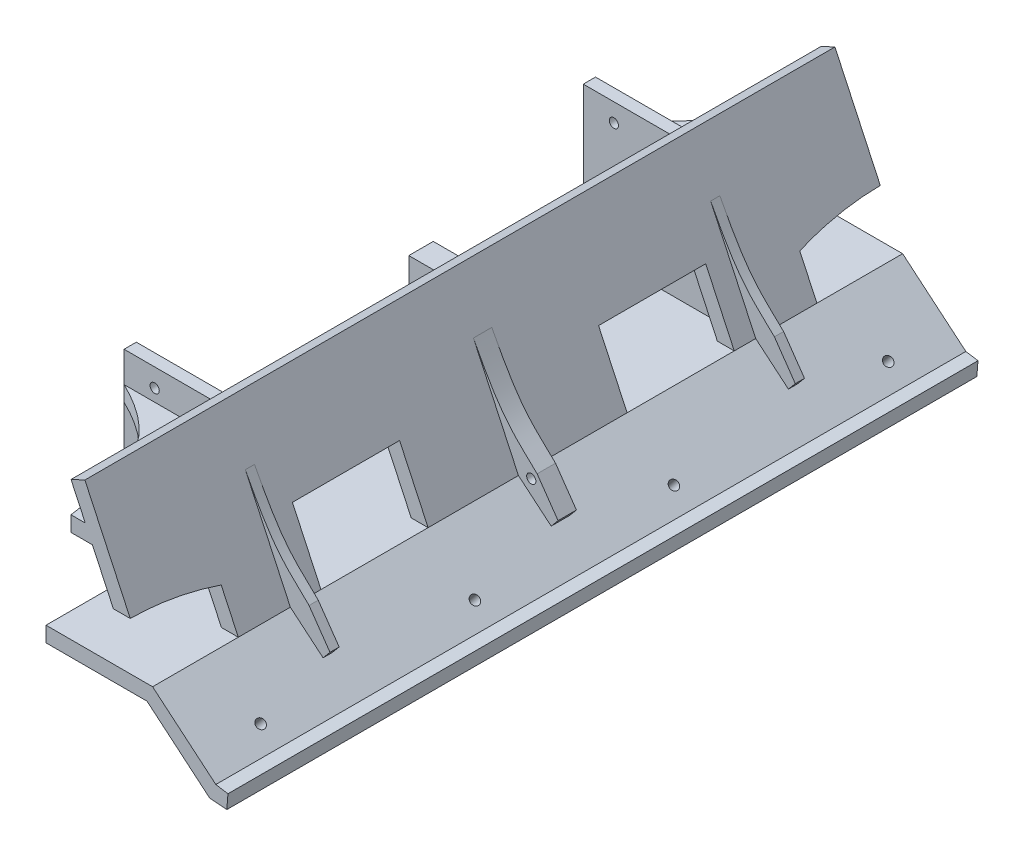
ISO-10303-21;
HEADER;
FILE_DESCRIPTION(('STEP AP214'),'2;1');
FILE_NAME('part.step','',(''),(''),'','','');
FILE_SCHEMA(('AUTOMOTIVE_DESIGN { 1 0 10303 214 1 1 1 1 }'));
ENDSEC;
DATA;
#1=APPLICATION_CONTEXT('core data for automotive mechanical design processes');
#2=APPLICATION_PROTOCOL_DEFINITION('international standard','automotive_design',2000,#1);
#3=PRODUCT_CONTEXT('',#1,'mechanical');
#4=PRODUCT('Part','Part','',(#3));
#5=PRODUCT_RELATED_PRODUCT_CATEGORY('part','',(#4));
#6=PRODUCT_DEFINITION_FORMATION('','',#4);
#7=PRODUCT_DEFINITION_CONTEXT('part definition',#1,'design');
#8=PRODUCT_DEFINITION('design','',#6,#7);
#9=PRODUCT_DEFINITION_SHAPE('','',#8);
#10=(LENGTH_UNIT() NAMED_UNIT(*) SI_UNIT(.MILLI.,.METRE.));
#11=(NAMED_UNIT(*) PLANE_ANGLE_UNIT() SI_UNIT($,.RADIAN.));
#12=(NAMED_UNIT(*) SI_UNIT($,.STERADIAN.) SOLID_ANGLE_UNIT());
#13=UNCERTAINTY_MEASURE_WITH_UNIT(LENGTH_MEASURE(1.E-05),#10,'distance_accuracy_value','');
#14=(GEOMETRIC_REPRESENTATION_CONTEXT(3) GLOBAL_UNCERTAINTY_ASSIGNED_CONTEXT((#13)) GLOBAL_UNIT_ASSIGNED_CONTEXT((#10,
#11,#12)) REPRESENTATION_CONTEXT('',''));
#15=CARTESIAN_POINT('',(0.,0.,0.));
#16=DIRECTION('',(0.,0.,1.));
#17=DIRECTION('',(1.,0.,0.));
#18=AXIS2_PLACEMENT_3D('',#15,#16,#17);
#19=CARTESIAN_POINT('',(12.434782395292,20.,245.));
#20=DIRECTION('',(0.642787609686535,0.766044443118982,0.));
#21=DIRECTION('',(-0.766044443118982,0.642787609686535,0.));
#22=AXIS2_PLACEMENT_3D('',#19,#20,#21);
#23=PLANE('',#22);
#24=DIRECTION('',(0.766044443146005,-0.64278760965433,0.));
#25=VECTOR('',#24,1.);
#26=CARTESIAN_POINT('',(12.434782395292,20.,170.));
#27=LINE('',#26,#25);
#28=CARTESIAN_POINT('',(12.434782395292,20.,170.));
#29=VERTEX_POINT('',#28);
#30=CARTESIAN_POINT('',(32.9164336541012,2.81385398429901,170.));
#31=VERTEX_POINT('',#30);
#32=EDGE_CURVE('E498',#29,#31,#27,.T.);
#33=ORIENTED_EDGE('',*,*,#32,.T.);
#34=DIRECTION('',(0.,0.,-1.));
#35=VECTOR('',#34,1.);
#36=CARTESIAN_POINT('',(32.9164336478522,2.81385398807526,245.));
#37=LINE('',#36,#35);
#38=CARTESIAN_POINT('',(32.9164336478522,2.81385398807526,215.));
#39=VERTEX_POINT('',#38);
#40=EDGE_CURVE('E950',#39,#31,#37,.T.);
#41=ORIENTED_EDGE('',*,*,#40,.F.);
#42=DIRECTION('',(-0.766044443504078,0.642787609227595,0.));
#43=VECTOR('',#42,1.);
#44=CARTESIAN_POINT('',(32.9164337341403,2.81385393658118,215.));
#45=LINE('',#44,#43);
#46=CARTESIAN_POINT('',(12.434782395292,20.,215.));
#47=VERTEX_POINT('',#46);
#48=EDGE_CURVE('E965',#39,#47,#45,.T.);
#49=ORIENTED_EDGE('',*,*,#48,.T.);
#50=DIRECTION('',(0.,0.,-1.));
#51=VECTOR('',#50,1.);
#52=CARTESIAN_POINT('',(12.434782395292,20.,245.));
#53=LINE('',#52,#51);
#54=EDGE_CURVE('E963',#47,#29,#53,.T.);
#55=ORIENTED_EDGE('',*,*,#54,.T.);
#56=EDGE_LOOP('',(#33,#41,#49,#55));
#57=FACE_BOUND('',#56,.T.);
#58=ADVANCED_FACE('F38',(#57),#23,.F.);
#59=DIRECTION('',(-0.766044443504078,0.642787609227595,0.));
#60=VECTOR('',#59,1.);
#61=CARTESIAN_POINT('',(32.9164337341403,2.81385393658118,80.));
#62=LINE('',#61,#60);
#63=CARTESIAN_POINT('',(32.9164336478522,2.81385398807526,80.));
#64=VERTEX_POINT('',#63);
#65=CARTESIAN_POINT('',(12.434782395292,20.,80.));
#66=VERTEX_POINT('',#65);
#67=EDGE_CURVE('E980',#64,#66,#62,.T.);
#68=ORIENTED_EDGE('',*,*,#67,.T.);
#69=CARTESIAN_POINT('',(12.434782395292,20.,35.));
#70=VERTEX_POINT('',#69);
#71=EDGE_CURVE('E970',#66,#70,#53,.T.);
#72=ORIENTED_EDGE('',*,*,#71,.T.);
#73=DIRECTION('',(0.766044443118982,-0.642787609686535,0.));
#74=VECTOR('',#73,1.);
#75=CARTESIAN_POINT('',(32.9164336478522,2.81385398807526,35.));
#76=LINE('',#75,#74);
#77=CARTESIAN_POINT('',(32.9164336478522,2.81385398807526,35.));
#78=VERTEX_POINT('',#77);
#79=EDGE_CURVE('E795',#70,#78,#76,.T.);
#80=ORIENTED_EDGE('',*,*,#79,.T.);
#81=EDGE_CURVE('E951',#64,#78,#37,.T.);
#82=ORIENTED_EDGE('',*,*,#81,.F.);
#83=EDGE_LOOP('',(#68,#72,#80,#82));
#84=FACE_BOUND('',#83,.T.);
#85=ADVANCED_FACE('F894',(#84),#23,.F.);
#86=CARTESIAN_POINT('',(-12.3931691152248,70.3153893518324,0.));
#87=DIRECTION('',(-0.906307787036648,-0.422618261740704,0.));
#88=DIRECTION('',(0.422618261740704,-0.906307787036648,0.));
#89=AXIS2_PLACEMENT_3D('',#86,#87,#88);
#90=PLANE('',#89);
#91=DIRECTION('',(0.,0.,-1.));
#92=VECTOR('',#91,1.);
#93=CARTESIAN_POINT('',(-5.39855424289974,55.3153893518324,280.520335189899));
#94=LINE('',#93,#92);
#95=CARTESIAN_POINT('',(-5.39855424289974,55.3153893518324,245.));
#96=VERTEX_POINT('',#95);
#97=CARTESIAN_POINT('',(-5.39855424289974,55.3153893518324,199.5));
#98=VERTEX_POINT('',#97);
#99=EDGE_CURVE('E622',#96,#98,#94,.T.);
#100=ORIENTED_EDGE('',*,*,#99,.T.);
#101=DIRECTION('',(-0.422618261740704,0.906307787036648,0.));
#102=VECTOR('',#101,1.);
#103=CARTESIAN_POINT('',(-22.3626730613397,91.6950595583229,199.5));
#104=LINE('',#103,#102);
#105=CARTESIAN_POINT('',(8.73774397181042,25.,199.5));
#106=VERTEX_POINT('',#105);
#107=EDGE_CURVE('E1161',#106,#98,#104,.T.);
#108=ORIENTED_EDGE('',*,*,#107,.F.);
#109=DIRECTION('',(0.,0.,1.));
#110=VECTOR('',#109,1.);
#111=CARTESIAN_POINT('',(8.73774397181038,25.,0.));
#112=LINE('',#111,#110);
#113=CARTESIAN_POINT('',(8.73774397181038,25.,217.));
#114=VERTEX_POINT('',#113);
#115=EDGE_CURVE('E1304',#106,#114,#112,.T.);
#116=ORIENTED_EDGE('',*,*,#115,.T.);
#117=DIRECTION('',(0.422618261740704,-0.906307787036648,0.));
#118=VECTOR('',#117,1.);
#119=CARTESIAN_POINT('',(-12.3931691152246,70.315389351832,217.));
#120=LINE('',#119,#118);
#121=CARTESIAN_POINT('',(3.14205207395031,37.,217.));
#122=VERTEX_POINT('',#121);
#123=EDGE_CURVE('E1069',#122,#114,#120,.T.);
#124=ORIENTED_EDGE('',*,*,#123,.F.);
#125=CARTESIAN_POINT('',(1.43814715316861,40.6540358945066,245.));
#126=CARTESIAN_POINT('',(1.44136631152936,40.6471323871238,243.811472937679));
#127=CARTESIAN_POINT('',(1.45316109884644,40.6218383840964,242.623067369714));
#128=CARTESIAN_POINT('',(1.49396791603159,40.5343278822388,240.248018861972));
#129=CARTESIAN_POINT('',(1.52297842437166,40.472114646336,239.061375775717));
#130=CARTESIAN_POINT('',(1.59828382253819,40.3106216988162,236.691142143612));
#131=CARTESIAN_POINT('',(1.64457899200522,40.211341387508,235.507551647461));
#132=CARTESIAN_POINT('',(1.7544219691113,39.9757823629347,233.144765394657));
#133=CARTESIAN_POINT('',(1.81797116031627,39.8395006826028,231.96556999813));
#134=CARTESIAN_POINT('',(1.96143612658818,39.531839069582,229.625655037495));
#135=CARTESIAN_POINT('',(2.04116946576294,39.3608503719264,228.464872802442));
#136=CARTESIAN_POINT('',(2.21722875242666,38.9832900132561,226.150276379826));
#137=CARTESIAN_POINT('',(2.31355609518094,38.7767153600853,224.996462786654));
#138=CARTESIAN_POINT('',(2.52260009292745,38.3284190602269,222.696521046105));
#139=CARTESIAN_POINT('',(2.63532574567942,38.0866781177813,221.550397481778));
#140=CARTESIAN_POINT('',(2.8767748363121,37.5688888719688,219.267745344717));
#141=CARTESIAN_POINT('',(3.00549664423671,37.292844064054,218.131215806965));
#142=CARTESIAN_POINT('',(3.14205207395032,37.,217.));
#143=B_SPLINE_CURVE_WITH_KNOTS('',3,(#125,#126,#127,#128,#129,#130,#131,#132,#133,#134,#135,
#136,#137,#138,#139,#140,#141,#142),.UNSPECIFIED.,.F.,.F.,(4,2,2,2,2,2,2,2,4),(0.,
3.56549442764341,7.13067378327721,10.6959108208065,14.26143383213,17.7887981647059,
21.3164592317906,24.8460632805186,28.3753079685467),.UNSPECIFIED.);
#144=CARTESIAN_POINT('',(1.43814715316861,40.6540358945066,245.));
#145=VERTEX_POINT('',#144);
#146=EDGE_CURVE('E1106',#145,#122,#143,.T.);
#147=ORIENTED_EDGE('',*,*,#146,.F.);
#148=DIRECTION('',(0.422618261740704,-0.906307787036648,0.));
#149=VECTOR('',#148,1.);
#150=CARTESIAN_POINT('',(-12.3931691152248,70.3153893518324,245.));
#151=LINE('',#150,#149);
#152=EDGE_CURVE('E1469',#96,#145,#151,.T.);
#153=ORIENTED_EDGE('',*,*,#152,.F.);
#154=EDGE_LOOP('',(#100,#108,#116,#124,#147,#153));
#155=FACE_BOUND('',#154,.T.);
#156=ADVANCED_FACE('F899',(#155),#90,.T.);
#157=CARTESIAN_POINT('',(8.73774397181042,106.197422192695,199.5));
#158=DIRECTION('',(0.,0.,-1.));
#159=DIRECTION('',(-1.,0.,0.));
#160=AXIS2_PLACEMENT_3D('',#157,#158,#159);
#161=PLANE('',#160);
#162=CARTESIAN_POINT('',(-30.565217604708,44.3153893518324,199.5));
#163=DIRECTION('',(0.,0.,-1.));
#164=DIRECTION('',(-1.,0.,0.));
#165=AXIS2_PLACEMENT_3D('',#162,#163,#164);
#166=CIRCLE('',#165,1.5);
#167=CARTESIAN_POINT('',(-32.065217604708,44.3153893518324,199.5));
#168=VERTEX_POINT('',#167);
#169=EDGE_CURVE('E818',#168,#168,#166,.T.);
#170=ORIENTED_EDGE('',*,*,#169,.T.);
#171=EDGE_LOOP('',(#170));
#172=FACE_BOUND('',#171,.T.);
#173=ORIENTED_EDGE('',*,*,#107,.T.);
#174=DIRECTION('',(-1.,0.,0.));
#175=VECTOR('',#174,1.);
#176=CARTESIAN_POINT('',(0.,55.3153893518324,199.5));
#177=LINE('',#176,#175);
#178=CARTESIAN_POINT('',(-40.565217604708,55.3153893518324,199.5));
#179=VERTEX_POINT('',#178);
#180=EDGE_CURVE('E628',#98,#179,#177,.T.);
#181=ORIENTED_EDGE('',*,*,#180,.T.);
#182=DIRECTION('',(0.,1.,0.));
#183=VECTOR('',#182,1.);
#184=CARTESIAN_POINT('',(-40.565217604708,-0.396078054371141,199.5));
#185=LINE('',#184,#183);
#186=CARTESIAN_POINT('',(-40.565217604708,20.,199.5));
#187=VERTEX_POINT('',#186);
#188=EDGE_CURVE('E1189',#187,#179,#185,.T.);
#189=ORIENTED_EDGE('',*,*,#188,.F.);
#190=DIRECTION('',(-1.,0.,0.));
#191=VECTOR('',#190,1.);
#192=CARTESIAN_POINT('',(-20.565217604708,20.,199.5));
#193=LINE('',#192,#191);
#194=CARTESIAN_POINT('',(-20.565217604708,20.,199.5));
#195=VERTEX_POINT('',#194);
#196=EDGE_CURVE('E1184',#195,#187,#193,.T.);
#197=ORIENTED_EDGE('',*,*,#196,.F.);
#198=DIRECTION('',(0.,1.,0.));
#199=VECTOR('',#198,1.);
#200=CARTESIAN_POINT('',(-20.565217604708,-0.396078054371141,199.5));
#201=LINE('',#200,#199);
#202=CARTESIAN_POINT('',(-20.565217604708,25.,199.5));
#203=VERTEX_POINT('',#202);
#204=EDGE_CURVE('E1191',#195,#203,#201,.T.);
#205=ORIENTED_EDGE('',*,*,#204,.T.);
#206=DIRECTION('',(1.,0.,0.));
#207=VECTOR('',#206,1.);
#208=CARTESIAN_POINT('',(8.73774397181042,25.,199.5));
#209=LINE('',#208,#207);
#210=EDGE_CURVE('E1154',#203,#106,#209,.T.);
#211=ORIENTED_EDGE('',*,*,#210,.T.);
#212=EDGE_LOOP('',(#173,#181,#189,#197,#205,#211));
#213=FACE_BOUND('',#212,.T.);
#214=ADVANCED_FACE('F1099',(#172,#213),#161,.F.);
#215=DIRECTION('',(0.422618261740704,-0.906307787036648,0.));
#216=VECTOR('',#215,1.);
#217=CARTESIAN_POINT('',(-22.3626730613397,91.6950595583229,45.5));
#218=LINE('',#217,#216);
#219=CARTESIAN_POINT('',(-5.39855424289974,55.3153893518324,45.5));
#220=VERTEX_POINT('',#219);
#221=CARTESIAN_POINT('',(8.73774397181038,25.,45.5));
#222=VERTEX_POINT('',#221);
#223=EDGE_CURVE('E1145',#220,#222,#218,.T.);
#224=ORIENTED_EDGE('',*,*,#223,.F.);
#225=DIRECTION('',(0.,0.,1.));
#226=VECTOR('',#225,1.);
#227=CARTESIAN_POINT('',(-5.39855424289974,55.3153893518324,-35.5203351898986));
#228=LINE('',#227,#226);
#229=CARTESIAN_POINT('',(-5.39855424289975,55.3153893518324,0.));
#230=VERTEX_POINT('',#229);
#231=EDGE_CURVE('E642',#230,#220,#228,.T.);
#232=ORIENTED_EDGE('',*,*,#231,.F.);
#233=DIRECTION('',(0.422618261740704,-0.906307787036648,0.));
#234=VECTOR('',#233,1.);
#235=CARTESIAN_POINT('',(-12.3931691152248,70.3153893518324,0.));
#236=LINE('',#235,#234);
#237=CARTESIAN_POINT('',(1.43814715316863,40.6540358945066,0.));
#238=VERTEX_POINT('',#237);
#239=EDGE_CURVE('E1460',#230,#238,#236,.T.);
#240=ORIENTED_EDGE('',*,*,#239,.T.);
#241=CARTESIAN_POINT('',(3.14205207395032,37.,28.));
#242=CARTESIAN_POINT('',(3.0041017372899,37.2958354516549,26.8572323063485));
#243=CARTESIAN_POINT('',(2.87414629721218,37.5745257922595,25.7090410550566));
#244=CARTESIAN_POINT('',(2.63057946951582,38.0968565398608,23.403046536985));
#245=CARTESIAN_POINT('',(2.5169674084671,38.3404983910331,22.2452436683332));
#246=CARTESIAN_POINT('',(2.30642717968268,38.792003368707,19.9211336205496));
#247=CARTESIAN_POINT('',(2.20949948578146,38.9998654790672,18.7548262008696));
#248=CARTESIAN_POINT('',(2.03259003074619,39.3792490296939,16.4149728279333));
#249=CARTESIAN_POINT('',(1.95260913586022,39.5507686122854,15.2414265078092));
#250=CARTESIAN_POINT('',(1.81055600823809,39.8554025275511,12.9011060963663));
#251=CARTESIAN_POINT('',(1.74830117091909,39.9889084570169,11.7343940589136));
#252=CARTESIAN_POINT('',(1.64067173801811,40.2197205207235,9.39652647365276));
#253=CARTESIAN_POINT('',(1.59529844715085,40.3170238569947,8.22537058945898));
#254=CARTESIAN_POINT('',(1.5214471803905,40.4753984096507,5.87929351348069));
#255=CARTESIAN_POINT('',(1.49298055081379,40.5364452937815,4.70437032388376));
#256=CARTESIAN_POINT('',(1.45292478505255,40.6223451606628,2.35300441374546));
#257=CARTESIAN_POINT('',(1.44133433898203,40.6472009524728,1.1765618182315));
#258=CARTESIAN_POINT('',(1.43814715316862,40.6540358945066,0.));
#259=B_SPLINE_CURVE_WITH_KNOTS('',3,(#241,#242,#243,#244,#245,#246,#247,#248,#249,#250,#251,
#252,#253,#254,#255,#256,#257,#258),.UNSPECIFIED.,.F.,.F.,(4,2,2,2,2,2,2,2,4),(0.,
3.56528348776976,7.13042002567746,10.6956577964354,14.2610777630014,17.788317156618,
21.3158291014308,24.8457057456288,28.3753083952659),.UNSPECIFIED.);
#260=CARTESIAN_POINT('',(3.14205207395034,37.,28.));
#261=VERTEX_POINT('',#260);
#262=EDGE_CURVE('E1084',#261,#238,#259,.T.);
#263=ORIENTED_EDGE('',*,*,#262,.F.);
#264=DIRECTION('',(-0.422618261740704,0.906307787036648,0.));
#265=VECTOR('',#264,1.);
#266=CARTESIAN_POINT('',(-12.3931691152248,70.3153893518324,28.));
#267=LINE('',#266,#265);
#268=CARTESIAN_POINT('',(8.73774397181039,25.,28.));
#269=VERTEX_POINT('',#268);
#270=EDGE_CURVE('E1077',#269,#261,#267,.T.);
#271=ORIENTED_EDGE('',*,*,#270,.F.);
#272=EDGE_CURVE('E1472',#269,#222,#112,.T.);
#273=ORIENTED_EDGE('',*,*,#272,.T.);
#274=EDGE_LOOP('',(#224,#232,#240,#263,#271,#273));
#275=FACE_BOUND('',#274,.T.);
#276=ADVANCED_FACE('F1094',(#275),#90,.T.);
#277=CARTESIAN_POINT('',(-12.3931691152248,70.3153893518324,0.));
#278=VERTEX_POINT('',#277);
#279=CARTESIAN_POINT('',(-7.73009253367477,60.3153893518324,0.));
#280=VERTEX_POINT('',#279);
#281=EDGE_CURVE('E1461',#278,#280,#236,.T.);
#282=ORIENTED_EDGE('',*,*,#281,.T.);
#283=DIRECTION('',(0.,0.,1.));
#284=VECTOR('',#283,1.);
#285=CARTESIAN_POINT('',(-7.73009253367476,60.3153893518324,-35.5203351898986));
#286=LINE('',#285,#284);
#287=CARTESIAN_POINT('',(-7.73009253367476,60.3153893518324,45.5));
#288=VERTEX_POINT('',#287);
#289=EDGE_CURVE('E625',#280,#288,#286,.T.);
#290=ORIENTED_EDGE('',*,*,#289,.T.);
#291=CARTESIAN_POINT('',(-12.3931691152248,70.3153893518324,45.5));
#292=VERTEX_POINT('',#291);
#293=EDGE_CURVE('E1151',#292,#288,#218,.T.);
#294=ORIENTED_EDGE('',*,*,#293,.F.);
#295=DIRECTION('',(0.,0.,1.));
#296=VECTOR('',#295,1.);
#297=CARTESIAN_POINT('',(-12.3931691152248,70.3153893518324,0.));
#298=LINE('',#297,#296);
#299=EDGE_CURVE('E1478',#278,#292,#298,.T.);
#300=ORIENTED_EDGE('',*,*,#299,.F.);
#301=EDGE_LOOP('',(#282,#290,#294,#300));
#302=FACE_BOUND('',#301,.T.);
#303=ADVANCED_FACE('F1098',(#302),#90,.T.);
#304=CARTESIAN_POINT('',(8.73774397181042,106.197422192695,45.5));
#305=DIRECTION('',(0.,0.,1.));
#306=DIRECTION('',(1.,0.,0.));
#307=AXIS2_PLACEMENT_3D('',#304,#305,#306);
#308=PLANE('',#307);
#309=CARTESIAN_POINT('',(-30.565217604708,44.3153893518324,45.5));
#310=DIRECTION('',(0.,0.,-1.));
#311=DIRECTION('',(-1.,0.,0.));
#312=AXIS2_PLACEMENT_3D('',#309,#310,#311);
#313=CIRCLE('',#312,1.5);
#314=CARTESIAN_POINT('',(-32.065217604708,44.3153893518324,45.5));
#315=VERTEX_POINT('',#314);
#316=EDGE_CURVE('E813',#315,#315,#313,.T.);
#317=ORIENTED_EDGE('',*,*,#316,.F.);
#318=EDGE_LOOP('',(#317));
#319=FACE_BOUND('',#318,.T.);
#320=DIRECTION('',(-1.,0.,0.));
#321=VECTOR('',#320,1.);
#322=CARTESIAN_POINT('',(-5.39855424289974,55.3153893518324,45.5));
#323=LINE('',#322,#321);
#324=CARTESIAN_POINT('',(-40.565217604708,55.3153893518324,45.5));
#325=VERTEX_POINT('',#324);
#326=EDGE_CURVE('E639',#220,#325,#323,.T.);
#327=ORIENTED_EDGE('',*,*,#326,.F.);
#328=ORIENTED_EDGE('',*,*,#223,.T.);
#329=DIRECTION('',(-1.,0.,0.));
#330=VECTOR('',#329,1.);
#331=CARTESIAN_POINT('',(8.73774397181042,25.,45.5));
#332=LINE('',#331,#330);
#333=CARTESIAN_POINT('',(-20.565217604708,25.,45.5));
#334=VERTEX_POINT('',#333);
#335=EDGE_CURVE('E1142',#222,#334,#332,.T.);
#336=ORIENTED_EDGE('',*,*,#335,.T.);
#337=DIRECTION('',(0.,1.,0.));
#338=VECTOR('',#337,1.);
#339=CARTESIAN_POINT('',(-20.565217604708,-0.396078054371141,45.5));
#340=LINE('',#339,#338);
#341=CARTESIAN_POINT('',(-20.565217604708,20.,45.5));
#342=VERTEX_POINT('',#341);
#343=EDGE_CURVE('E1200',#342,#334,#340,.T.);
#344=ORIENTED_EDGE('',*,*,#343,.F.);
#345=DIRECTION('',(1.,0.,0.));
#346=VECTOR('',#345,1.);
#347=CARTESIAN_POINT('',(-20.565217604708,20.,45.5));
#348=LINE('',#347,#346);
#349=CARTESIAN_POINT('',(-40.565217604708,20.,45.5));
#350=VERTEX_POINT('',#349);
#351=EDGE_CURVE('E987',#350,#342,#348,.T.);
#352=ORIENTED_EDGE('',*,*,#351,.F.);
#353=DIRECTION('',(0.,1.,0.));
#354=VECTOR('',#353,1.);
#355=CARTESIAN_POINT('',(-40.565217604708,-0.396078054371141,45.5));
#356=LINE('',#355,#354);
#357=EDGE_CURVE('E1204',#350,#325,#356,.T.);
#358=ORIENTED_EDGE('',*,*,#357,.T.);
#359=EDGE_LOOP('',(#327,#328,#336,#344,#352,#358));
#360=FACE_BOUND('',#359,.T.);
#361=ADVANCED_FACE('F1268',(#319,#360),#308,.F.);
#362=CARTESIAN_POINT('',(-30.565217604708,64.3153893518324,45.5));
#363=DIRECTION('',(0.,0.,-1.));
#364=DIRECTION('',(-1.,0.,0.));
#365=AXIS2_PLACEMENT_3D('',#362,#363,#364);
#366=CIRCLE('',#365,1.5);
#367=CARTESIAN_POINT('',(-32.065217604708,64.3153893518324,45.5));
#368=VERTEX_POINT('',#367);
#369=EDGE_CURVE('E825',#368,#368,#366,.T.);
#370=ORIENTED_EDGE('',*,*,#369,.F.);
#371=EDGE_LOOP('',(#370));
#372=FACE_BOUND('',#371,.T.);
#373=DIRECTION('',(1.,0.,0.));
#374=VECTOR('',#373,1.);
#375=CARTESIAN_POINT('',(-40.565217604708,60.3153893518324,45.5));
#376=LINE('',#375,#374);
#377=CARTESIAN_POINT('',(-40.565217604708,60.3153893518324,45.5));
#378=VERTEX_POINT('',#377);
#379=EDGE_CURVE('E635',#378,#288,#376,.T.);
#380=ORIENTED_EDGE('',*,*,#379,.F.);
#381=CARTESIAN_POINT('',(-40.565217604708,70.3153893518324,45.5));
#382=VERTEX_POINT('',#381);
#383=EDGE_CURVE('E1202',#378,#382,#356,.T.);
#384=ORIENTED_EDGE('',*,*,#383,.T.);
#385=DIRECTION('',(-1.,0.,0.));
#386=VECTOR('',#385,1.);
#387=CARTESIAN_POINT('',(-12.3931691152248,70.3153893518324,45.5));
#388=LINE('',#387,#386);
#389=EDGE_CURVE('E1181',#292,#382,#388,.T.);
#390=ORIENTED_EDGE('',*,*,#389,.F.);
#391=ORIENTED_EDGE('',*,*,#293,.T.);
#392=EDGE_LOOP('',(#380,#384,#390,#391));
#393=FACE_BOUND('',#392,.T.);
#394=ADVANCED_FACE('F1271',(#372,#393),#308,.F.);
#395=CARTESIAN_POINT('',(38.5022683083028,2.37100134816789,254.));
#396=DIRECTION('',(-0.996871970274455,0.079033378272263,0.));
#397=DIRECTION('',(-0.0790333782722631,-0.996871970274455,0.));
#398=AXIS2_PLACEMENT_3D('',#395,#396,#397);
#399=PLANE('',#398);
#400=DIRECTION('',(0.0790333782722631,0.996871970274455,0.));
#401=VECTOR('',#400,1.);
#402=CARTESIAN_POINT('',(38.5022683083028,2.37100134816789,0.));
#403=LINE('',#402,#401);
#404=CARTESIAN_POINT('',(38.5022683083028,2.37100134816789,0.));
#405=VERTEX_POINT('',#404);
#406=CARTESIAN_POINT('',(38.8721934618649,7.03697950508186,0.));
#407=VERTEX_POINT('',#406);
#408=EDGE_CURVE('E714',#405,#407,#403,.T.);
#409=ORIENTED_EDGE('',*,*,#408,.T.);
#410=DIRECTION('',(0.,0.,1.));
#411=VECTOR('',#410,1.);
#412=CARTESIAN_POINT('',(38.8721934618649,7.03697950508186,-34.3700704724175));
#413=LINE('',#412,#411);
#414=CARTESIAN_POINT('',(38.8721934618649,7.03697950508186,245.));
#415=VERTEX_POINT('',#414);
#416=EDGE_CURVE('E1537',#407,#415,#413,.T.);
#417=ORIENTED_EDGE('',*,*,#416,.T.);
#418=DIRECTION('',(0.0790333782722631,0.996871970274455,0.));
#419=VECTOR('',#418,1.);
#420=CARTESIAN_POINT('',(38.0749704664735,-3.01863592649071,245.));
#421=LINE('',#420,#419);
#422=CARTESIAN_POINT('',(38.5022683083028,2.37100134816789,245.));
#423=VERTEX_POINT('',#422);
#424=EDGE_CURVE('E719',#423,#415,#421,.T.);
#425=ORIENTED_EDGE('',*,*,#424,.F.);
#426=DIRECTION('',(0.,0.,-1.));
#427=VECTOR('',#426,1.);
#428=CARTESIAN_POINT('',(38.5022683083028,2.37100134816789,254.));
#429=LINE('',#428,#427);
#430=EDGE_CURVE('E717',#423,#405,#429,.T.);
#431=ORIENTED_EDGE('',*,*,#430,.T.);
#432=EDGE_LOOP('',(#409,#417,#425,#431));
#433=FACE_BOUND('',#432,.T.);
#434=ADVANCED_FACE('F1266',(#433),#399,.F.);
#435=CARTESIAN_POINT('',(8.73774397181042,106.197422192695,195.5));
#436=DIRECTION('',(0.,0.,1.));
#437=DIRECTION('',(1.,0.,0.));
#438=AXIS2_PLACEMENT_3D('',#435,#436,#437);
#439=PLANE('',#438);
#440=DIRECTION('',(-1.,0.,0.));
#441=VECTOR('',#440,1.);
#442=CARTESIAN_POINT('',(8.73774397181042,25.,195.5));
#443=LINE('',#442,#441);
#444=CARTESIAN_POINT('',(8.73774397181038,25.,195.5));
#445=VERTEX_POINT('',#444);
#446=CARTESIAN_POINT('',(-40.565217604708,25.,195.5));
#447=VERTEX_POINT('',#446);
#448=EDGE_CURVE('E1157',#445,#447,#443,.T.);
#449=ORIENTED_EDGE('',*,*,#448,.T.);
#450=DIRECTION('',(0.,1.,0.));
#451=VECTOR('',#450,1.);
#452=CARTESIAN_POINT('',(-40.565217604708,-0.396078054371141,195.5));
#453=LINE('',#452,#451);
#454=CARTESIAN_POINT('',(-40.565217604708,70.3153893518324,195.5));
#455=VERTEX_POINT('',#454);
#456=EDGE_CURVE('E1185',#447,#455,#453,.T.);
#457=ORIENTED_EDGE('',*,*,#456,.T.);
#458=DIRECTION('',(1.,0.,0.));
#459=VECTOR('',#458,1.);
#460=CARTESIAN_POINT('',(8.73774397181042,70.3153893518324,195.5));
#461=LINE('',#460,#459);
#462=CARTESIAN_POINT('',(-12.3931691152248,70.3153893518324,195.5));
#463=VERTEX_POINT('',#462);
#464=EDGE_CURVE('E1176',#455,#463,#461,.T.);
#465=ORIENTED_EDGE('',*,*,#464,.T.);
#466=DIRECTION('',(0.422618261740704,-0.906307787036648,0.));
#467=VECTOR('',#466,1.);
#468=CARTESIAN_POINT('',(-22.3626730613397,91.6950595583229,195.5));
#469=LINE('',#468,#467);
#470=EDGE_CURVE('E1148',#463,#445,#469,.T.);
#471=ORIENTED_EDGE('',*,*,#470,.T.);
#472=EDGE_LOOP('',(#449,#457,#465,#471));
#473=FACE_BOUND('',#472,.T.);
#474=CARTESIAN_POINT('',(-30.565217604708,64.3153893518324,195.5));
#475=DIRECTION('',(0.,0.,1.));
#476=DIRECTION('',(1.,0.,0.));
#477=AXIS2_PLACEMENT_3D('',#474,#475,#476);
#478=CIRCLE('',#477,1.5);
#479=CARTESIAN_POINT('',(-32.065217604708,64.3153893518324,195.5));
#480=VERTEX_POINT('',#479);
#481=EDGE_CURVE('E832',#480,#480,#478,.T.);
#482=ORIENTED_EDGE('',*,*,#481,.T.);
#483=EDGE_LOOP('',(#482));
#484=FACE_BOUND('',#483,.T.);
#485=CARTESIAN_POINT('',(-30.565217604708,44.3153893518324,195.5));
#486=DIRECTION('',(0.,0.,1.));
#487=DIRECTION('',(1.,0.,0.));
#488=AXIS2_PLACEMENT_3D('',#485,#486,#487);
#489=CIRCLE('',#488,1.5);
#490=CARTESIAN_POINT('',(-32.065217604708,44.3153893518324,195.5));
#491=VERTEX_POINT('',#490);
#492=EDGE_CURVE('E822',#491,#491,#489,.T.);
#493=ORIENTED_EDGE('',*,*,#492,.T.);
#494=EDGE_LOOP('',(#493));
#495=FACE_BOUND('',#494,.T.);
#496=ADVANCED_FACE('F1263',(#473,#484,#495),#439,.F.);
#497=CARTESIAN_POINT('',(8.73774397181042,106.197422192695,49.5));
#498=DIRECTION('',(0.,0.,-1.));
#499=DIRECTION('',(-1.,0.,0.));
#500=AXIS2_PLACEMENT_3D('',#497,#498,#499);
#501=PLANE('',#500);
#502=DIRECTION('',(1.,0.,0.));
#503=VECTOR('',#502,1.);
#504=CARTESIAN_POINT('',(8.73774397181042,25.,49.5));
#505=LINE('',#504,#503);
#506=CARTESIAN_POINT('',(-40.565217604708,25.,49.5));
#507=VERTEX_POINT('',#506);
#508=CARTESIAN_POINT('',(8.73774397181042,25.,49.5));
#509=VERTEX_POINT('',#508);
#510=EDGE_CURVE('E1146',#507,#509,#505,.T.);
#511=ORIENTED_EDGE('',*,*,#510,.T.);
#512=DIRECTION('',(-0.422618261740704,0.906307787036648,0.));
#513=VECTOR('',#512,1.);
#514=CARTESIAN_POINT('',(-22.3626730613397,91.6950595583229,49.5));
#515=LINE('',#514,#513);
#516=CARTESIAN_POINT('',(-12.3931691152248,70.3153893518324,49.5));
#517=VERTEX_POINT('',#516);
#518=EDGE_CURVE('E1138',#509,#517,#515,.T.);
#519=ORIENTED_EDGE('',*,*,#518,.T.);
#520=DIRECTION('',(-1.,0.,0.));
#521=VECTOR('',#520,1.);
#522=CARTESIAN_POINT('',(8.73774397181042,70.3153893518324,49.5));
#523=LINE('',#522,#521);
#524=CARTESIAN_POINT('',(-40.565217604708,70.3153893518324,49.5));
#525=VERTEX_POINT('',#524);
#526=EDGE_CURVE('E1170',#517,#525,#523,.T.);
#527=ORIENTED_EDGE('',*,*,#526,.T.);
#528=DIRECTION('',(0.,1.,0.));
#529=VECTOR('',#528,1.);
#530=CARTESIAN_POINT('',(-40.565217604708,-0.396078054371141,49.5));
#531=LINE('',#530,#529);
#532=EDGE_CURVE('E1199',#507,#525,#531,.T.);
#533=ORIENTED_EDGE('',*,*,#532,.F.);
#534=EDGE_LOOP('',(#511,#519,#527,#533));
#535=FACE_BOUND('',#534,.T.);
#536=CARTESIAN_POINT('',(-30.565217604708,64.3153893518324,49.5));
#537=DIRECTION('',(0.,0.,-1.));
#538=DIRECTION('',(-1.,0.,0.));
#539=AXIS2_PLACEMENT_3D('',#536,#537,#538);
#540=CIRCLE('',#539,1.5);
#541=CARTESIAN_POINT('',(-32.065217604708,64.3153893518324,49.5));
#542=VERTEX_POINT('',#541);
#543=EDGE_CURVE('E829',#542,#542,#540,.T.);
#544=ORIENTED_EDGE('',*,*,#543,.T.);
#545=EDGE_LOOP('',(#544));
#546=FACE_BOUND('',#545,.T.);
#547=CARTESIAN_POINT('',(-30.565217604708,44.3153893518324,49.5));
#548=DIRECTION('',(0.,0.,-1.));
#549=DIRECTION('',(-1.,0.,0.));
#550=AXIS2_PLACEMENT_3D('',#547,#548,#549);
#551=CIRCLE('',#550,1.5);
#552=CARTESIAN_POINT('',(-32.065217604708,44.3153893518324,49.5));
#553=VERTEX_POINT('',#552);
#554=EDGE_CURVE('E819',#553,#553,#551,.T.);
#555=ORIENTED_EDGE('',*,*,#554,.T.);
#556=EDGE_LOOP('',(#555));
#557=FACE_BOUND('',#556,.T.);
#558=ADVANCED_FACE('F936',(#535,#546,#557),#501,.F.);
#559=CARTESIAN_POINT('',(-20.565217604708,25.,245.));
#560=DIRECTION('',(1.,0.,0.));
#561=DIRECTION('',(0.,0.,-1.));
#562=AXIS2_PLACEMENT_3D('',#559,#560,#561);
#563=PLANE('',#562);
#564=DIRECTION('',(0.,0.,-1.));
#565=VECTOR('',#564,1.);
#566=CARTESIAN_POINT('',(-20.565217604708,25.,245.));
#567=LINE('',#566,#565);
#568=CARTESIAN_POINT('',(-20.565217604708,25.,126.5));
#569=VERTEX_POINT('',#568);
#570=CARTESIAN_POINT('',(-20.565217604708,25.,118.5));
#571=VERTEX_POINT('',#570);
#572=EDGE_CURVE('E2275',#569,#571,#567,.T.);
#573=ORIENTED_EDGE('',*,*,#572,.F.);
#574=DIRECTION('',(0.,-1.,0.));
#575=VECTOR('',#574,1.);
#576=CARTESIAN_POINT('',(-20.565217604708,107.545023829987,126.5));
#577=LINE('',#576,#575);
#578=CARTESIAN_POINT('',(-20.565217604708,70.3153893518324,126.5));
#579=VERTEX_POINT('',#578);
#580=EDGE_CURVE('E1124',#579,#569,#577,.T.);
#581=ORIENTED_EDGE('',*,*,#580,.F.);
#582=DIRECTION('',(0.,0.,-1.));
#583=VECTOR('',#582,1.);
#584=CARTESIAN_POINT('',(-20.565217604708,70.3153893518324,245.));
#585=LINE('',#584,#583);
#586=CARTESIAN_POINT('',(-20.565217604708,70.3153893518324,118.5));
#587=VERTEX_POINT('',#586);
#588=EDGE_CURVE('E1166',#579,#587,#585,.T.);
#589=ORIENTED_EDGE('',*,*,#588,.T.);
#590=DIRECTION('',(0.,-1.,0.));
#591=VECTOR('',#590,1.);
#592=CARTESIAN_POINT('',(-20.565217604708,107.545023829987,118.5));
#593=LINE('',#592,#591);
#594=EDGE_CURVE('E1131',#587,#571,#593,.T.);
#595=ORIENTED_EDGE('',*,*,#594,.T.);
#596=EDGE_LOOP('',(#573,#581,#589,#595));
#597=FACE_BOUND('',#596,.T.);
#598=ADVANCED_FACE('F931',(#597),#563,.F.);
#599=CARTESIAN_POINT('',(26.3292749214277,8.34113644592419,155.));
#600=DIRECTION('',(0.642787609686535,0.766044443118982,0.));
#601=DIRECTION('',(-0.766044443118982,0.642787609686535,0.));
#602=AXIS2_PLACEMENT_3D('',#599,#600,#601);
#603=CIRCLE('',#602,1.5);
#604=CARTESIAN_POINT('',(25.1802082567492,9.30531786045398,155.));
#605=VERTEX_POINT('',#604);
#606=EDGE_CURVE('E665',#605,#605,#603,.T.);
#607=ORIENTED_EDGE('',*,*,#606,.T.);
#608=EDGE_LOOP('',(#607));
#609=FACE_BOUND('',#608,.T.);
#610=CARTESIAN_POINT('',(26.3292749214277,8.34113644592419,90.));
#611=DIRECTION('',(0.642787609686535,0.766044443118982,0.));
#612=DIRECTION('',(-0.766044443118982,0.642787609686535,0.));
#613=AXIS2_PLACEMENT_3D('',#610,#611,#612);
#614=CIRCLE('',#613,1.5);
#615=CARTESIAN_POINT('',(25.1802082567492,9.30531786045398,90.));
#616=VERTEX_POINT('',#615);
#617=EDGE_CURVE('E662',#616,#616,#614,.T.);
#618=ORIENTED_EDGE('',*,*,#617,.T.);
#619=EDGE_LOOP('',(#618));
#620=FACE_BOUND('',#619,.T.);
#621=CARTESIAN_POINT('',(32.9164336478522,2.81385398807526,166.));
#622=VERTEX_POINT('',#621);
#623=CARTESIAN_POINT('',(32.9164337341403,2.81385393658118,84.));
#624=VERTEX_POINT('',#623);
#625=EDGE_CURVE('E946',#622,#624,#37,.T.);
#626=ORIENTED_EDGE('',*,*,#625,.F.);
#627=DIRECTION('',(0.766044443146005,-0.64278760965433,0.));
#628=VECTOR('',#627,1.);
#629=CARTESIAN_POINT('',(12.434782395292,20.,166.));
#630=LINE('',#629,#628);
#631=CARTESIAN_POINT('',(12.434782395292,20.,166.));
#632=VERTEX_POINT('',#631);
#633=EDGE_CURVE('E496',#632,#622,#630,.T.);
#634=ORIENTED_EDGE('',*,*,#633,.F.);
#635=CARTESIAN_POINT('',(12.434782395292,20.,84.));
#636=VERTEX_POINT('',#635);
#637=EDGE_CURVE('E513',#632,#636,#53,.T.);
#638=ORIENTED_EDGE('',*,*,#637,.T.);
#639=DIRECTION('',(-0.766044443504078,0.642787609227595,0.));
#640=VECTOR('',#639,1.);
#641=CARTESIAN_POINT('',(32.9164337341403,2.81385393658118,84.));
#642=LINE('',#641,#640);
#643=EDGE_CURVE('E537',#624,#636,#642,.T.);
#644=ORIENTED_EDGE('',*,*,#643,.F.);
#645=EDGE_LOOP('',(#626,#634,#638,#644));
#646=FACE_BOUND('',#645,.T.);
#647=ADVANCED_FACE('F901',(#609,#620,#646),#23,.F.);
#648=CARTESIAN_POINT('',(12.434782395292,20.,245.));
#649=DIRECTION('',(0.,1.,0.));
#650=DIRECTION('',(-1.,0.,0.));
#651=AXIS2_PLACEMENT_3D('',#648,#649,#650);
#652=PLANE('',#651);
#653=ORIENTED_EDGE('',*,*,#637,.F.);
#654=DIRECTION('',(1.,1.55274257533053E-10,0.));
#655=VECTOR('',#654,1.);
#656=CARTESIAN_POINT('',(-20.5652175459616,19.9999999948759,166.));
#657=LINE('',#656,#655);
#658=CARTESIAN_POINT('',(-20.5652175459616,19.9999999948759,166.));
#659=VERTEX_POINT('',#658);
#660=EDGE_CURVE('E494',#659,#632,#657,.T.);
#661=ORIENTED_EDGE('',*,*,#660,.F.);
#662=DIRECTION('',(0.,0.,1.));
#663=VECTOR('',#662,1.);
#664=CARTESIAN_POINT('',(-20.5652175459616,19.9999999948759,166.));
#665=LINE('',#664,#663);
#666=CARTESIAN_POINT('',(-20.5652175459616,19.9999999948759,170.));
#667=VERTEX_POINT('',#666);
#668=EDGE_CURVE('E502',#659,#667,#665,.T.);
#669=ORIENTED_EDGE('',*,*,#668,.T.);
#670=DIRECTION('',(1.,1.55274257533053E-10,0.));
#671=VECTOR('',#670,1.);
#672=CARTESIAN_POINT('',(-20.5652175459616,19.9999999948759,170.));
#673=LINE('',#672,#671);
#674=EDGE_CURVE('E523',#667,#29,#673,.T.);
#675=ORIENTED_EDGE('',*,*,#674,.T.);
#676=ORIENTED_EDGE('',*,*,#54,.F.);
#677=DIRECTION('',(-1.,3.06373192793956E-12,0.));
#678=VECTOR('',#677,1.);
#679=CARTESIAN_POINT('',(12.434782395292,20.,215.));
#680=LINE('',#679,#678);
#681=CARTESIAN_POINT('',(-20.5652176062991,20.0000000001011,215.));
#682=VERTEX_POINT('',#681);
#683=EDGE_CURVE('E749',#47,#682,#680,.T.);
#684=ORIENTED_EDGE('',*,*,#683,.T.);
#685=DIRECTION('',(0.,0.,-1.));
#686=VECTOR('',#685,1.);
#687=CARTESIAN_POINT('',(-20.565217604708,20.,245.));
#688=LINE('',#687,#686);
#689=EDGE_CURVE('E991',#682,#195,#688,.T.);
#690=ORIENTED_EDGE('',*,*,#689,.T.);
#691=ORIENTED_EDGE('',*,*,#196,.T.);
#692=DIRECTION('',(0.,0.,-1.));
#693=VECTOR('',#692,1.);
#694=CARTESIAN_POINT('',(-40.565217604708,20.,195.5));
#695=LINE('',#694,#693);
#696=EDGE_CURVE('E1193',#187,#350,#695,.T.);
#697=ORIENTED_EDGE('',*,*,#696,.T.);
#698=ORIENTED_EDGE('',*,*,#351,.T.);
#699=CARTESIAN_POINT('',(-20.565217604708,20.,35.));
#700=VERTEX_POINT('',#699);
#701=EDGE_CURVE('E985',#342,#700,#688,.T.);
#702=ORIENTED_EDGE('',*,*,#701,.T.);
#703=DIRECTION('',(1.,0.,0.));
#704=VECTOR('',#703,1.);
#705=CARTESIAN_POINT('',(12.434782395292,20.,35.));
#706=LINE('',#705,#704);
#707=EDGE_CURVE('E786',#700,#70,#706,.T.);
#708=ORIENTED_EDGE('',*,*,#707,.T.);
#709=ORIENTED_EDGE('',*,*,#71,.F.);
#710=DIRECTION('',(-1.,3.06373192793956E-12,0.));
#711=VECTOR('',#710,1.);
#712=CARTESIAN_POINT('',(12.434782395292,20.,80.));
#713=LINE('',#712,#711);
#714=CARTESIAN_POINT('',(-20.5652176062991,20.0000000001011,80.));
#715=VERTEX_POINT('',#714);
#716=EDGE_CURVE('E538',#66,#715,#713,.T.);
#717=ORIENTED_EDGE('',*,*,#716,.T.);
#718=DIRECTION('',(0.,0.,-1.));
#719=VECTOR('',#718,1.);
#720=CARTESIAN_POINT('',(-20.5652176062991,20.0000000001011,84.));
#721=LINE('',#720,#719);
#722=CARTESIAN_POINT('',(-20.5652176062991,20.0000000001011,84.));
#723=VERTEX_POINT('',#722);
#724=EDGE_CURVE('E1543',#723,#715,#721,.T.);
#725=ORIENTED_EDGE('',*,*,#724,.F.);
#726=DIRECTION('',(-1.,3.06373192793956E-12,0.));
#727=VECTOR('',#726,1.);
#728=CARTESIAN_POINT('',(12.434782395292,20.,84.));
#729=LINE('',#728,#727);
#730=EDGE_CURVE('E1545',#636,#723,#729,.T.);
#731=ORIENTED_EDGE('',*,*,#730,.F.);
#732=EDGE_LOOP('',(#653,#661,#669,#675,#676,#684,#690,#691,#697,#698,#702,#708,#709,#717,#725,#731));
#733=FACE_BOUND('',#732,.T.);
#734=ADVANCED_FACE('F511',(#733),#652,.F.);
#735=CARTESIAN_POINT('',(26.3292749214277,8.34113644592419,225.));
#736=DIRECTION('',(0.642787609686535,0.766044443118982,0.));
#737=DIRECTION('',(-0.766044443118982,0.642787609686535,0.));
#738=AXIS2_PLACEMENT_3D('',#735,#736,#737);
#739=CIRCLE('',#738,1.5);
#740=CARTESIAN_POINT('',(25.1802082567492,9.30531786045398,225.));
#741=VERTEX_POINT('',#740);
#742=EDGE_CURVE('E671',#741,#741,#739,.T.);
#743=ORIENTED_EDGE('',*,*,#742,.T.);
#744=EDGE_LOOP('',(#743));
#745=FACE_BOUND('',#744,.T.);
#746=CARTESIAN_POINT('',(12.434782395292,20.,245.));
#747=VERTEX_POINT('',#746);
#748=CARTESIAN_POINT('',(12.434782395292,20.,220.));
#749=VERTEX_POINT('',#748);
#750=EDGE_CURVE('E967',#747,#749,#53,.T.);
#751=ORIENTED_EDGE('',*,*,#750,.T.);
#752=DIRECTION('',(-0.766044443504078,0.642787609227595,0.));
#753=VECTOR('',#752,1.);
#754=CARTESIAN_POINT('',(32.9164337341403,2.81385393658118,220.));
#755=LINE('',#754,#753);
#756=CARTESIAN_POINT('',(32.9164337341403,2.81385393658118,220.));
#757=VERTEX_POINT('',#756);
#758=EDGE_CURVE('E748',#757,#749,#755,.T.);
#759=ORIENTED_EDGE('',*,*,#758,.F.);
#760=CARTESIAN_POINT('',(32.9164336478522,2.81385398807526,245.));
#761=VERTEX_POINT('',#760);
#762=EDGE_CURVE('E953',#761,#757,#37,.T.);
#763=ORIENTED_EDGE('',*,*,#762,.F.);
#764=DIRECTION('',(0.766044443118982,-0.642787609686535,0.));
#765=VECTOR('',#764,1.);
#766=CARTESIAN_POINT('',(12.434782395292,20.,245.));
#767=LINE('',#766,#765);
#768=EDGE_CURVE('E1486',#747,#761,#767,.T.);
#769=ORIENTED_EDGE('',*,*,#768,.F.);
#770=EDGE_LOOP('',(#751,#759,#763,#769));
#771=FACE_BOUND('',#770,.T.);
#772=ADVANCED_FACE('F906',(#745,#771),#23,.F.);
#773=CARTESIAN_POINT('',(-20.565217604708,20.,245.));
#774=VERTEX_POINT('',#773);
#775=CARTESIAN_POINT('',(-20.5652176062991,20.0000000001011,220.));
#776=VERTEX_POINT('',#775);
#777=EDGE_CURVE('E992',#774,#776,#688,.T.);
#778=ORIENTED_EDGE('',*,*,#777,.T.);
#779=DIRECTION('',(-1.,3.06373192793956E-12,0.));
#780=VECTOR('',#779,1.);
#781=CARTESIAN_POINT('',(12.434782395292,20.,220.));
#782=LINE('',#781,#780);
#783=EDGE_CURVE('E2321',#749,#776,#782,.T.);
#784=ORIENTED_EDGE('',*,*,#783,.F.);
#785=ORIENTED_EDGE('',*,*,#750,.F.);
#786=DIRECTION('',(1.,0.,0.));
#787=VECTOR('',#786,1.);
#788=CARTESIAN_POINT('',(12.434782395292,20.,245.));
#789=LINE('',#788,#787);
#790=EDGE_CURVE('E975',#774,#747,#789,.T.);
#791=ORIENTED_EDGE('',*,*,#790,.F.);
#792=EDGE_LOOP('',(#778,#784,#785,#791));
#793=FACE_BOUND('',#792,.T.);
#794=ADVANCED_FACE('F919',(#793),#652,.F.);
#795=CARTESIAN_POINT('',(14.254633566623,25.,0.));
#796=DIRECTION('',(0.906307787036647,0.422618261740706,0.));
#797=DIRECTION('',(-0.422618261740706,0.906307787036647,0.));
#798=AXIS2_PLACEMENT_3D('',#795,#796,#797);
#799=PLANE('',#798);
#800=DIRECTION('',(0.,0.,-1.));
#801=VECTOR('',#800,1.);
#802=CARTESIAN_POINT('',(14.254633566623,25.,245.));
#803=LINE('',#802,#801);
#804=CARTESIAN_POINT('',(14.254633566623,25.,55.));
#805=VERTEX_POINT('',#804);
#806=CARTESIAN_POINT('',(14.254633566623,25.,48.));
#807=VERTEX_POINT('',#806);
#808=EDGE_CURVE('E1327',#805,#807,#803,.T.);
#809=ORIENTED_EDGE('',*,*,#808,.T.);
#810=DIRECTION('',(-0.422618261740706,0.906307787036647,0.));
#811=VECTOR('',#810,1.);
#812=CARTESIAN_POINT('',(14.254633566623,25.,48.));
#813=LINE('',#812,#811);
#814=CARTESIAN_POINT('',(-0.453296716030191,56.5412582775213,48.));
#815=VERTEX_POINT('',#814);
#816=EDGE_CURVE('E838',#807,#815,#813,.T.);
#817=ORIENTED_EDGE('',*,*,#816,.T.);
#818=DIRECTION('',(0.,0.,1.));
#819=VECTOR('',#818,1.);
#820=CARTESIAN_POINT('',(-0.453296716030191,56.5412582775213,46.5));
#821=LINE('',#820,#819);
#822=CARTESIAN_POINT('',(-0.453296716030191,56.5412582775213,45.));
#823=VERTEX_POINT('',#822);
#824=EDGE_CURVE('E841',#815,#823,#821,.F.);
#825=ORIENTED_EDGE('',*,*,#824,.T.);
#826=DIRECTION('',(-0.422618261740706,0.906307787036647,0.));
#827=VECTOR('',#826,1.);
#828=CARTESIAN_POINT('',(14.254633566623,25.,45.));
#829=LINE('',#828,#827);
#830=CARTESIAN_POINT('',(14.254633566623,25.,45.));
#831=VERTEX_POINT('',#830);
#832=EDGE_CURVE('E844',#831,#823,#829,.T.);
#833=ORIENTED_EDGE('',*,*,#832,.F.);
#834=CARTESIAN_POINT('',(14.254633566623,25.,28.));
#835=VERTEX_POINT('',#834);
#836=EDGE_CURVE('E1010',#831,#835,#803,.T.);
#837=ORIENTED_EDGE('',*,*,#836,.T.);
#838=DIRECTION('',(0.422618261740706,-0.906307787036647,0.));
#839=VECTOR('',#838,1.);
#840=CARTESIAN_POINT('',(14.254633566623,25.,28.));
#841=LINE('',#840,#839);
#842=CARTESIAN_POINT('',(8.65894166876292,37.,28.));
#843=VERTEX_POINT('',#842);
#844=EDGE_CURVE('E1030',#843,#835,#841,.T.);
#845=ORIENTED_EDGE('',*,*,#844,.F.);
#846=CARTESIAN_POINT('',(6.9550367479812,40.6540358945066,0.));
#847=CARTESIAN_POINT('',(6.95825590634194,40.6471323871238,1.18852706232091));
#848=CARTESIAN_POINT('',(6.97005069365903,40.6218383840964,2.37693263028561));
#849=CARTESIAN_POINT('',(7.0108575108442,40.5343278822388,4.7519811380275));
#850=CARTESIAN_POINT('',(7.03986801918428,40.472114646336,5.9386242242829));
#851=CARTESIAN_POINT('',(7.1151734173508,40.3106216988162,8.30885785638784));
#852=CARTESIAN_POINT('',(7.16146858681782,40.211341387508,9.49244835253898));
#853=CARTESIAN_POINT('',(7.2713115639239,39.9757823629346,11.8552346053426));
#854=CARTESIAN_POINT('',(7.33486075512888,39.8395006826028,13.0344300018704));
#855=CARTESIAN_POINT('',(7.47832572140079,39.531839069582,15.3743449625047));
#856=CARTESIAN_POINT('',(7.55805906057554,39.3608503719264,16.5351271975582));
#857=CARTESIAN_POINT('',(7.73411834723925,38.9832900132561,18.8497236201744));
#858=CARTESIAN_POINT('',(7.83044568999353,38.7767153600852,20.0035372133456));
#859=CARTESIAN_POINT('',(8.03948968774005,38.3284190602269,22.3034789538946));
#860=CARTESIAN_POINT('',(8.15221534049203,38.0866781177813,23.4496025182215));
#861=CARTESIAN_POINT('',(8.3936644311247,37.5688888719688,25.7322546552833));
#862=CARTESIAN_POINT('',(8.52238623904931,37.292844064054,26.8687841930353));
#863=CARTESIAN_POINT('',(8.65894166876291,37.,28.));
#864=B_SPLINE_CURVE_WITH_KNOTS('',3,(#846,#847,#848,#849,#850,#851,#852,#853,#854,#855,#856,
#857,#858,#859,#860,#861,#862,#863),.UNSPECIFIED.,.F.,.F.,(4,2,2,2,2,2,2,2,4),(0.,
3.56549442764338,7.13067378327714,10.6959108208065,14.26143383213,17.7887981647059,
21.3164592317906,24.8460632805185,28.3753079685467),.UNSPECIFIED.);
#865=CARTESIAN_POINT('',(6.95503674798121,40.6540358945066,0.));
#866=VERTEX_POINT('',#865);
#867=EDGE_CURVE('E1033',#866,#843,#864,.T.);
#868=ORIENTED_EDGE('',*,*,#867,.F.);
#869=DIRECTION('',(-0.422618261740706,0.906307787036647,0.));
#870=VECTOR('',#869,1.);
#871=CARTESIAN_POINT('',(14.254633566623,25.,0.));
#872=LINE('',#871,#870);
#873=CARTESIAN_POINT('',(-7.86163018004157,72.4284806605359,0.));
#874=VERTEX_POINT('',#873);
#875=EDGE_CURVE('E1454',#866,#874,#872,.T.);
#876=ORIENTED_EDGE('',*,*,#875,.T.);
#877=DIRECTION('',(0.,0.,1.));
#878=VECTOR('',#877,1.);
#879=CARTESIAN_POINT('',(-7.86163018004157,72.4284806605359,0.));
#880=LINE('',#879,#878);
#881=CARTESIAN_POINT('',(-7.86163018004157,72.4284806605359,245.));
#882=VERTEX_POINT('',#881);
#883=EDGE_CURVE('E1464',#874,#882,#880,.T.);
#884=ORIENTED_EDGE('',*,*,#883,.T.);
#885=DIRECTION('',(-0.422618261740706,0.906307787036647,0.));
#886=VECTOR('',#885,1.);
#887=CARTESIAN_POINT('',(14.254633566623,25.,245.));
#888=LINE('',#887,#886);
#889=CARTESIAN_POINT('',(6.95503674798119,40.6540358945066,245.));
#890=VERTEX_POINT('',#889);
#891=EDGE_CURVE('E1453',#890,#882,#888,.T.);
#892=ORIENTED_EDGE('',*,*,#891,.F.);
#893=CARTESIAN_POINT('',(8.65894166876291,37.,217.));
#894=CARTESIAN_POINT('',(8.52099133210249,37.2958354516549,218.142767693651));
#895=CARTESIAN_POINT('',(8.39103589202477,37.5745257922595,219.290958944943));
#896=CARTESIAN_POINT('',(8.1474690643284,38.0968565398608,221.596953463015));
#897=CARTESIAN_POINT('',(8.03385700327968,38.3404983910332,222.754756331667));
#898=CARTESIAN_POINT('',(7.82331677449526,38.792003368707,225.07886637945));
#899=CARTESIAN_POINT('',(7.72638908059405,38.9998654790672,226.24517379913));
#900=CARTESIAN_POINT('',(7.54947962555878,39.3792490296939,228.585027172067));
#901=CARTESIAN_POINT('',(7.4694987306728,39.5507686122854,229.758573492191));
#902=CARTESIAN_POINT('',(7.32744560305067,39.8554025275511,232.098893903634));
#903=CARTESIAN_POINT('',(7.26519076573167,39.9889084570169,233.265605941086));
#904=CARTESIAN_POINT('',(7.15756133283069,40.2197205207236,235.603473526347));
#905=CARTESIAN_POINT('',(7.11218804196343,40.3170238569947,236.774629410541));
#906=CARTESIAN_POINT('',(7.03833677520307,40.4753984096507,239.120706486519));
#907=CARTESIAN_POINT('',(7.00987014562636,40.5364452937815,240.295629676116));
#908=CARTESIAN_POINT('',(6.96981437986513,40.6223451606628,242.646995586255));
#909=CARTESIAN_POINT('',(6.95822393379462,40.6472009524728,243.823438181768));
#910=CARTESIAN_POINT('',(6.95503674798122,40.6540358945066,245.));
#911=B_SPLINE_CURVE_WITH_KNOTS('',3,(#893,#894,#895,#896,#897,#898,#899,#900,#901,#902,#903,
#904,#905,#906,#907,#908,#909,#910),.UNSPECIFIED.,.F.,.F.,(4,2,2,2,2,2,2,2,4),(0.,
3.56528348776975,7.13042002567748,10.6956577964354,14.2610777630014,17.788317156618,
21.3158291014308,24.8457057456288,28.3753083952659),.UNSPECIFIED.);
#912=CARTESIAN_POINT('',(8.65894166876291,37.,217.));
#913=VERTEX_POINT('',#912);
#914=EDGE_CURVE('E1041',#913,#890,#911,.T.);
#915=ORIENTED_EDGE('',*,*,#914,.F.);
#916=DIRECTION('',(-0.422618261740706,0.906307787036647,0.));
#917=VECTOR('',#916,1.);
#918=CARTESIAN_POINT('',(14.2546335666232,24.9999999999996,217.));
#919=LINE('',#918,#917);
#920=CARTESIAN_POINT('',(14.254633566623,25.,217.));
#921=VERTEX_POINT('',#920);
#922=EDGE_CURVE('E2304',#921,#913,#919,.T.);
#923=ORIENTED_EDGE('',*,*,#922,.F.);
#924=CARTESIAN_POINT('',(14.254633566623,25.,200.));
#925=VERTEX_POINT('',#924);
#926=EDGE_CURVE('E1009',#921,#925,#803,.T.);
#927=ORIENTED_EDGE('',*,*,#926,.T.);
#928=DIRECTION('',(0.422618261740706,-0.906307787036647,0.));
#929=VECTOR('',#928,1.);
#930=CARTESIAN_POINT('',(-0.453296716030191,56.5412582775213,200.));
#931=LINE('',#930,#929);
#932=CARTESIAN_POINT('',(-0.453296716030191,56.5412582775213,200.));
#933=VERTEX_POINT('',#932);
#934=EDGE_CURVE('E1217',#933,#925,#931,.T.);
#935=ORIENTED_EDGE('',*,*,#934,.F.);
#936=DIRECTION('',(0.,0.,1.));
#937=VECTOR('',#936,1.);
#938=CARTESIAN_POINT('',(-0.453296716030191,56.5412582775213,197.));
#939=LINE('',#938,#937);
#940=CARTESIAN_POINT('',(-0.453296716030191,56.5412582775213,197.));
#941=VERTEX_POINT('',#940);
#942=EDGE_CURVE('E1209',#941,#933,#939,.T.);
#943=ORIENTED_EDGE('',*,*,#942,.F.);
#944=DIRECTION('',(0.422618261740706,-0.906307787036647,0.));
#945=VECTOR('',#944,1.);
#946=CARTESIAN_POINT('',(-0.453296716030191,56.5412582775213,197.));
#947=LINE('',#946,#945);
#948=CARTESIAN_POINT('',(14.254633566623,25.,197.));
#949=VERTEX_POINT('',#948);
#950=EDGE_CURVE('E1229',#941,#949,#947,.T.);
#951=ORIENTED_EDGE('',*,*,#950,.T.);
#952=CARTESIAN_POINT('',(14.254633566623,25.,190.));
#953=VERTEX_POINT('',#952);
#954=EDGE_CURVE('E1319',#949,#953,#803,.T.);
#955=ORIENTED_EDGE('',*,*,#954,.T.);
#956=DIRECTION('',(0.422618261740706,-0.906307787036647,0.));
#957=VECTOR('',#956,1.);
#958=CARTESIAN_POINT('',(14.254633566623,25.,190.));
#959=LINE('',#958,#957);
#960=CARTESIAN_POINT('',(4.92848040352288,45.,190.));
#961=VERTEX_POINT('',#960);
#962=EDGE_CURVE('E1023',#961,#953,#959,.T.);
#963=ORIENTED_EDGE('',*,*,#962,.F.);
#964=DIRECTION('',(0.,0.,1.));
#965=VECTOR('',#964,1.);
#966=CARTESIAN_POINT('',(4.92848040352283,45.0000000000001,0.));
#967=LINE('',#966,#965);
#968=CARTESIAN_POINT('',(4.92848040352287,45.,155.));
#969=VERTEX_POINT('',#968);
#970=EDGE_CURVE('E1026',#969,#961,#967,.T.);
#971=ORIENTED_EDGE('',*,*,#970,.F.);
#972=DIRECTION('',(-0.422618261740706,0.906307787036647,0.));
#973=VECTOR('',#972,1.);
#974=CARTESIAN_POINT('',(14.254633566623,25.,155.));
#975=LINE('',#974,#973);
#976=CARTESIAN_POINT('',(14.254633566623,25.,155.));
#977=VERTEX_POINT('',#976);
#978=EDGE_CURVE('E1028',#977,#969,#975,.T.);
#979=ORIENTED_EDGE('',*,*,#978,.F.);
#980=CARTESIAN_POINT('',(14.254633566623,25.,125.5));
#981=VERTEX_POINT('',#980);
#982=EDGE_CURVE('E1323',#977,#981,#803,.T.);
#983=ORIENTED_EDGE('',*,*,#982,.T.);
#984=DIRECTION('',(-0.422618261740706,0.906307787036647,0.));
#985=VECTOR('',#984,1.);
#986=CARTESIAN_POINT('',(-0.453296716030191,56.5412582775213,125.5));
#987=LINE('',#986,#985);
#988=CARTESIAN_POINT('',(-0.453296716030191,56.5412582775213,125.5));
#989=VERTEX_POINT('',#988);
#990=EDGE_CURVE('E1359',#981,#989,#987,.T.);
#991=ORIENTED_EDGE('',*,*,#990,.T.);
#992=DIRECTION('',(0.,0.,1.));
#993=VECTOR('',#992,1.);
#994=CARTESIAN_POINT('',(-0.453296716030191,56.5412582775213,122.5));
#995=LINE('',#994,#993);
#996=CARTESIAN_POINT('',(-0.453296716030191,56.5412582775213,119.5));
#997=VERTEX_POINT('',#996);
#998=EDGE_CURVE('E1223',#989,#997,#995,.F.);
#999=ORIENTED_EDGE('',*,*,#998,.T.);
#1000=DIRECTION('',(-0.422618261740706,0.906307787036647,0.));
#1001=VECTOR('',#1000,1.);
#1002=CARTESIAN_POINT('',(-0.453296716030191,56.5412582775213,119.5));
#1003=LINE('',#1002,#1001);
#1004=CARTESIAN_POINT('',(14.254633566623,25.,119.5));
#1005=VERTEX_POINT('',#1004);
#1006=EDGE_CURVE('E1351',#1005,#997,#1003,.T.);
#1007=ORIENTED_EDGE('',*,*,#1006,.F.);
#1008=CARTESIAN_POINT('',(14.254633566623,25.,90.));
#1009=VERTEX_POINT('',#1008);
#1010=EDGE_CURVE('E1321',#1005,#1009,#803,.T.);
#1011=ORIENTED_EDGE('',*,*,#1010,.T.);
#1012=DIRECTION('',(0.422618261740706,-0.906307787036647,0.));
#1013=VECTOR('',#1012,1.);
#1014=CARTESIAN_POINT('',(14.254633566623,25.,90.));
#1015=LINE('',#1014,#1013);
#1016=CARTESIAN_POINT('',(4.92848040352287,45.,90.));
#1017=VERTEX_POINT('',#1016);
#1018=EDGE_CURVE('E1020',#1017,#1009,#1015,.T.);
#1019=ORIENTED_EDGE('',*,*,#1018,.F.);
#1020=DIRECTION('',(0.,0.,1.));
#1021=VECTOR('',#1020,1.);
#1022=CARTESIAN_POINT('',(4.92848040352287,45.,0.));
#1023=LINE('',#1022,#1021);
#1024=CARTESIAN_POINT('',(4.92848040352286,45.,55.));
#1025=VERTEX_POINT('',#1024);
#1026=EDGE_CURVE('E1015',#1025,#1017,#1023,.T.);
#1027=ORIENTED_EDGE('',*,*,#1026,.F.);
#1028=DIRECTION('',(-0.422618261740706,0.906307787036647,0.));
#1029=VECTOR('',#1028,1.);
#1030=CARTESIAN_POINT('',(14.254633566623,25.,55.));
#1031=LINE('',#1030,#1029);
#1032=EDGE_CURVE('E1017',#805,#1025,#1031,.T.);
#1033=ORIENTED_EDGE('',*,*,#1032,.F.);
#1034=EDGE_LOOP('',(#809,#817,#825,#833,#837,#845,#868,#876,#884,#892,#915,#923,#927,#935,#943,
#951,#955,#963,#971,#979,#983,#991,#999,#1007,#1011,#1019,#1027,#1033));
#1035=FACE_BOUND('',#1034,.T.);
#1036=ADVANCED_FACE('F925',(#1035),#799,.T.);
#1037=CARTESIAN_POINT('',(8.73774397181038,107.545023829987,126.5));
#1038=DIRECTION('',(0.,0.,-1.));
#1039=DIRECTION('',(-1.,0.,0.));
#1040=AXIS2_PLACEMENT_3D('',#1037,#1038,#1039);
#1041=PLANE('',#1040);
#1042=DIRECTION('',(1.,0.,0.));
#1043=VECTOR('',#1042,1.);
#1044=CARTESIAN_POINT('',(8.73774397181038,25.,126.5));
#1045=LINE('',#1044,#1043);
#1046=CARTESIAN_POINT('',(8.73774397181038,25.,126.5));
#1047=VERTEX_POINT('',#1046);
#1048=EDGE_CURVE('E1136',#569,#1047,#1045,.T.);
#1049=ORIENTED_EDGE('',*,*,#1048,.T.);
#1050=DIRECTION('',(-0.422618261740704,0.906307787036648,0.));
#1051=VECTOR('',#1050,1.);
#1052=CARTESIAN_POINT('',(-22.8788344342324,92.8019711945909,126.5));
#1053=LINE('',#1052,#1051);
#1054=CARTESIAN_POINT('',(-12.3931691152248,70.3153893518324,126.5));
#1055=VERTEX_POINT('',#1054);
#1056=EDGE_CURVE('E1116',#1047,#1055,#1053,.T.);
#1057=ORIENTED_EDGE('',*,*,#1056,.T.);
#1058=DIRECTION('',(-1.,0.,0.));
#1059=VECTOR('',#1058,1.);
#1060=CARTESIAN_POINT('',(8.73774397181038,70.3153893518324,126.5));
#1061=LINE('',#1060,#1059);
#1062=EDGE_CURVE('E1167',#1055,#579,#1061,.T.);
#1063=ORIENTED_EDGE('',*,*,#1062,.T.);
#1064=ORIENTED_EDGE('',*,*,#580,.T.);
#1065=EDGE_LOOP('',(#1049,#1057,#1063,#1064));
#1066=FACE_BOUND('',#1065,.T.);
#1067=CARTESIAN_POINT('',(-15.565217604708,40.3153893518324,126.5));
#1068=DIRECTION('',(0.,0.,-1.));
#1069=DIRECTION('',(-1.,0.,0.));
#1070=AXIS2_PLACEMENT_3D('',#1067,#1068,#1069);
#1071=CIRCLE('',#1070,1.5);
#1072=CARTESIAN_POINT('',(-17.065217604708,40.3153893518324,126.5));
#1073=VERTEX_POINT('',#1072);
#1074=EDGE_CURVE('E733',#1073,#1073,#1071,.T.);
#1075=ORIENTED_EDGE('',*,*,#1074,.T.);
#1076=EDGE_LOOP('',(#1075));
#1077=FACE_BOUND('',#1076,.T.);
#1078=CARTESIAN_POINT('',(-15.565217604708,60.3153893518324,126.5));
#1079=DIRECTION('',(0.,0.,-1.));
#1080=DIRECTION('',(-1.,0.,0.));
#1081=AXIS2_PLACEMENT_3D('',#1078,#1079,#1080);
#1082=CIRCLE('',#1081,1.5);
#1083=CARTESIAN_POINT('',(-17.065217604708,60.3153893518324,126.5));
#1084=VERTEX_POINT('',#1083);
#1085=EDGE_CURVE('E739',#1084,#1084,#1082,.T.);
#1086=ORIENTED_EDGE('',*,*,#1085,.T.);
#1087=EDGE_LOOP('',(#1086));
#1088=FACE_BOUND('',#1087,.T.);
#1089=ADVANCED_FACE('F1281',(#1066,#1077,#1088),#1041,.F.);
#1090=CARTESIAN_POINT('',(14.254633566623,25.,245.));
#1091=DIRECTION('',(0.,-1.,0.));
#1092=DIRECTION('',(0.,0.,-1.));
#1093=AXIS2_PLACEMENT_3D('',#1090,#1091,#1092);
#1094=PLANE('',#1093);
#1095=CARTESIAN_POINT('',(8.73774397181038,25.,155.));
#1096=VERTEX_POINT('',#1095);
#1097=EDGE_CURVE('E2356',#1047,#1096,#112,.T.);
#1098=ORIENTED_EDGE('',*,*,#1097,.F.);
#1099=ORIENTED_EDGE('',*,*,#1048,.F.);
#1100=ORIENTED_EDGE('',*,*,#572,.T.);
#1101=DIRECTION('',(-1.,0.,0.));
#1102=VECTOR('',#1101,1.);
#1103=CARTESIAN_POINT('',(8.73774397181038,25.,118.5));
#1104=LINE('',#1103,#1102);
#1105=CARTESIAN_POINT('',(8.73774397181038,25.,118.5));
#1106=VERTEX_POINT('',#1105);
#1107=EDGE_CURVE('E1134',#1106,#571,#1104,.T.);
#1108=ORIENTED_EDGE('',*,*,#1107,.F.);
#1109=CARTESIAN_POINT('',(8.73774397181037,25.,90.));
#1110=VERTEX_POINT('',#1109);
#1111=EDGE_CURVE('E1477',#1110,#1106,#112,.T.);
#1112=ORIENTED_EDGE('',*,*,#1111,.F.);
#1113=DIRECTION('',(-1.,0.,0.));
#1114=VECTOR('',#1113,1.);
#1115=CARTESIAN_POINT('',(179.434782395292,25.,90.));
#1116=LINE('',#1115,#1114);
#1117=EDGE_CURVE('E1437',#1009,#1110,#1116,.T.);
#1118=ORIENTED_EDGE('',*,*,#1117,.F.);
#1119=EDGE_CURVE('E1011',#1009,#805,#803,.T.);
#1120=ORIENTED_EDGE('',*,*,#1119,.T.);
#1121=DIRECTION('',(-1.,0.,0.));
#1122=VECTOR('',#1121,1.);
#1123=CARTESIAN_POINT('',(179.434782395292,25.,55.));
#1124=LINE('',#1123,#1122);
#1125=CARTESIAN_POINT('',(8.73774397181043,25.,55.));
#1126=VERTEX_POINT('',#1125);
#1127=EDGE_CURVE('E1440',#805,#1126,#1124,.T.);
#1128=ORIENTED_EDGE('',*,*,#1127,.T.);
#1129=EDGE_CURVE('E1476',#509,#1126,#112,.T.);
#1130=ORIENTED_EDGE('',*,*,#1129,.F.);
#1131=ORIENTED_EDGE('',*,*,#510,.F.);
#1132=DIRECTION('',(0.,0.,-1.));
#1133=VECTOR('',#1132,1.);
#1134=CARTESIAN_POINT('',(-40.565217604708,25.,49.5));
#1135=LINE('',#1134,#1133);
#1136=EDGE_CURVE('E727',#447,#507,#1135,.T.);
#1137=ORIENTED_EDGE('',*,*,#1136,.F.);
#1138=ORIENTED_EDGE('',*,*,#448,.F.);
#1139=CARTESIAN_POINT('',(8.73774397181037,25.,190.));
#1140=VERTEX_POINT('',#1139);
#1141=EDGE_CURVE('E1417',#1140,#445,#112,.T.);
#1142=ORIENTED_EDGE('',*,*,#1141,.F.);
#1143=DIRECTION('',(-1.,0.,0.));
#1144=VECTOR('',#1143,1.);
#1145=CARTESIAN_POINT('',(179.434782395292,25.,190.));
#1146=LINE('',#1145,#1144);
#1147=EDGE_CURVE('E1411',#953,#1140,#1146,.T.);
#1148=ORIENTED_EDGE('',*,*,#1147,.F.);
#1149=EDGE_CURVE('E1320',#953,#977,#803,.T.);
#1150=ORIENTED_EDGE('',*,*,#1149,.T.);
#1151=DIRECTION('',(-1.,0.,0.));
#1152=VECTOR('',#1151,1.);
#1153=CARTESIAN_POINT('',(179.434782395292,25.,155.));
#1154=LINE('',#1153,#1152);
#1155=EDGE_CURVE('E1091',#977,#1096,#1154,.T.);
#1156=ORIENTED_EDGE('',*,*,#1155,.T.);
#1157=EDGE_LOOP('',(#1098,#1099,#1100,#1108,#1112,#1118,#1120,#1128,#1130,#1131,#1137,#1138,
#1142,#1148,#1150,#1156));
#1158=FACE_BOUND('',#1157,.T.);
#1159=ADVANCED_FACE('F1279',(#1158),#1094,.F.);
#1160=CARTESIAN_POINT('',(8.73774397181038,107.545023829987,118.5));
#1161=DIRECTION('',(0.,0.,1.));
#1162=DIRECTION('',(1.,0.,0.));
#1163=AXIS2_PLACEMENT_3D('',#1160,#1161,#1162);
#1164=PLANE('',#1163);
#1165=ORIENTED_EDGE('',*,*,#1107,.T.);
#1166=ORIENTED_EDGE('',*,*,#594,.F.);
#1167=DIRECTION('',(1.,0.,0.));
#1168=VECTOR('',#1167,1.);
#1169=CARTESIAN_POINT('',(8.73774397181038,70.3153893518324,118.5));
#1170=LINE('',#1169,#1168);
#1171=CARTESIAN_POINT('',(-12.3931691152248,70.3153893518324,118.5));
#1172=VERTEX_POINT('',#1171);
#1173=EDGE_CURVE('E1159',#587,#1172,#1170,.T.);
#1174=ORIENTED_EDGE('',*,*,#1173,.T.);
#1175=DIRECTION('',(0.422618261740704,-0.906307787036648,0.));
#1176=VECTOR('',#1175,1.);
#1177=CARTESIAN_POINT('',(-22.8788344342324,92.8019711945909,118.5));
#1178=LINE('',#1177,#1176);
#1179=EDGE_CURVE('E1130',#1172,#1106,#1178,.T.);
#1180=ORIENTED_EDGE('',*,*,#1179,.T.);
#1181=EDGE_LOOP('',(#1165,#1166,#1174,#1180));
#1182=FACE_BOUND('',#1181,.T.);
#1183=CARTESIAN_POINT('',(-15.565217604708,40.3153893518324,118.5));
#1184=DIRECTION('',(0.,0.,-1.));
#1185=DIRECTION('',(-1.,0.,0.));
#1186=AXIS2_PLACEMENT_3D('',#1183,#1184,#1185);
#1187=CIRCLE('',#1186,1.5);
#1188=CARTESIAN_POINT('',(-17.065217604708,40.3153893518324,118.5));
#1189=VERTEX_POINT('',#1188);
#1190=EDGE_CURVE('E730',#1189,#1189,#1187,.T.);
#1191=ORIENTED_EDGE('',*,*,#1190,.F.);
#1192=EDGE_LOOP('',(#1191));
#1193=FACE_BOUND('',#1192,.T.);
#1194=CARTESIAN_POINT('',(-15.565217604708,60.3153893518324,118.5));
#1195=DIRECTION('',(0.,0.,-1.));
#1196=DIRECTION('',(-1.,0.,0.));
#1197=AXIS2_PLACEMENT_3D('',#1194,#1195,#1196);
#1198=CIRCLE('',#1197,1.5);
#1199=CARTESIAN_POINT('',(-17.065217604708,60.3153893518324,118.5));
#1200=VERTEX_POINT('',#1199);
#1201=EDGE_CURVE('E736',#1200,#1200,#1198,.T.);
#1202=ORIENTED_EDGE('',*,*,#1201,.F.);
#1203=EDGE_LOOP('',(#1202));
#1204=FACE_BOUND('',#1203,.T.);
#1205=ADVANCED_FACE('F1276',(#1182,#1193,#1204),#1164,.F.);
#1206=ORIENTED_EDGE('',*,*,#204,.F.);
#1207=ORIENTED_EDGE('',*,*,#689,.F.);
#1208=DIRECTION('',(0.,0.,-1.));
#1209=VECTOR('',#1208,1.);
#1210=CARTESIAN_POINT('',(-20.5652176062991,20.0000000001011,220.));
#1211=LINE('',#1210,#1209);
#1212=EDGE_CURVE('E2322',#776,#682,#1211,.T.);
#1213=ORIENTED_EDGE('',*,*,#1212,.F.);
#1214=ORIENTED_EDGE('',*,*,#777,.F.);
#1215=DIRECTION('',(0.,-1.,0.));
#1216=VECTOR('',#1215,1.);
#1217=CARTESIAN_POINT('',(-20.565217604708,25.,245.));
#1218=LINE('',#1217,#1216);
#1219=CARTESIAN_POINT('',(-20.565217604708,25.,245.));
#1220=VERTEX_POINT('',#1219);
#1221=EDGE_CURVE('E1495',#1220,#774,#1218,.T.);
#1222=ORIENTED_EDGE('',*,*,#1221,.F.);
#1223=DIRECTION('',(0.,0.,-1.));
#1224=VECTOR('',#1223,1.);
#1225=CARTESIAN_POINT('',(-20.565217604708,25.,245.));
#1226=LINE('',#1225,#1224);
#1227=EDGE_CURVE('E999',#1220,#203,#1226,.T.);
#1228=ORIENTED_EDGE('',*,*,#1227,.T.);
#1229=EDGE_LOOP('',(#1206,#1207,#1213,#1214,#1222,#1228));
#1230=FACE_BOUND('',#1229,.T.);
#1231=ADVANCED_FACE('F939',(#1230),#563,.F.);
#1232=ORIENTED_EDGE('',*,*,#210,.F.);
#1233=ORIENTED_EDGE('',*,*,#1227,.F.);
#1234=DIRECTION('',(-1.,0.,0.));
#1235=VECTOR('',#1234,1.);
#1236=CARTESIAN_POINT('',(14.254633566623,25.,245.));
#1237=LINE('',#1236,#1235);
#1238=CARTESIAN_POINT('',(14.254633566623,25.,245.));
#1239=VERTEX_POINT('',#1238);
#1240=EDGE_CURVE('E1308',#1239,#1220,#1237,.T.);
#1241=ORIENTED_EDGE('',*,*,#1240,.F.);
#1242=EDGE_CURVE('E1006',#1239,#921,#803,.T.);
#1243=ORIENTED_EDGE('',*,*,#1242,.T.);
#1244=DIRECTION('',(-1.,0.,0.));
#1245=VECTOR('',#1244,1.);
#1246=CARTESIAN_POINT('',(27.434782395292,25.,217.));
#1247=LINE('',#1246,#1245);
#1248=EDGE_CURVE('E1111',#921,#114,#1247,.T.);
#1249=ORIENTED_EDGE('',*,*,#1248,.T.);
#1250=ORIENTED_EDGE('',*,*,#115,.F.);
#1251=EDGE_LOOP('',(#1232,#1233,#1241,#1243,#1249,#1250));
#1252=FACE_BOUND('',#1251,.T.);
#1253=ADVANCED_FACE('F1303',(#1252),#1094,.F.);
#1254=DIRECTION('',(0.,0.,-1.));
#1255=VECTOR('',#1254,1.);
#1256=CARTESIAN_POINT('',(-7.73009253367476,60.3153893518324,280.520335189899));
#1257=LINE('',#1256,#1255);
#1258=CARTESIAN_POINT('',(-7.73009253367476,60.3153893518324,245.));
#1259=VERTEX_POINT('',#1258);
#1260=CARTESIAN_POINT('',(-7.73009253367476,60.3153893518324,199.5));
#1261=VERTEX_POINT('',#1260);
#1262=EDGE_CURVE('E631',#1259,#1261,#1257,.T.);
#1263=ORIENTED_EDGE('',*,*,#1262,.F.);
#1264=CARTESIAN_POINT('',(-12.3931691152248,70.3153893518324,245.));
#1265=VERTEX_POINT('',#1264);
#1266=EDGE_CURVE('E1457',#1265,#1259,#151,.T.);
#1267=ORIENTED_EDGE('',*,*,#1266,.F.);
#1268=CARTESIAN_POINT('',(-12.3931691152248,70.3153893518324,199.5));
#1269=VERTEX_POINT('',#1268);
#1270=EDGE_CURVE('E1482',#1269,#1265,#298,.T.);
#1271=ORIENTED_EDGE('',*,*,#1270,.F.);
#1272=EDGE_CURVE('E1156',#1261,#1269,#104,.T.);
#1273=ORIENTED_EDGE('',*,*,#1272,.F.);
#1274=EDGE_LOOP('',(#1263,#1267,#1271,#1273));
#1275=FACE_BOUND('',#1274,.T.);
#1276=ADVANCED_FACE('F1810',(#1275),#90,.T.);
#1277=ORIENTED_EDGE('',*,*,#1141,.T.);
#1278=ORIENTED_EDGE('',*,*,#470,.F.);
#1279=EDGE_CURVE('E2262',#1055,#463,#298,.T.);
#1280=ORIENTED_EDGE('',*,*,#1279,.F.);
#1281=ORIENTED_EDGE('',*,*,#1056,.F.);
#1282=ORIENTED_EDGE('',*,*,#1097,.T.);
#1283=DIRECTION('',(0.422618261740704,-0.906307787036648,0.));
#1284=VECTOR('',#1283,1.);
#1285=CARTESIAN_POINT('',(-12.3931691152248,70.3153893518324,155.));
#1286=LINE('',#1285,#1284);
#1287=CARTESIAN_POINT('',(-0.588409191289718,45.,155.));
#1288=VERTEX_POINT('',#1287);
#1289=EDGE_CURVE('E1433',#1288,#1096,#1286,.T.);
#1290=ORIENTED_EDGE('',*,*,#1289,.F.);
#1291=DIRECTION('',(0.,0.,-1.));
#1292=VECTOR('',#1291,1.);
#1293=CARTESIAN_POINT('',(-0.588409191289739,45.0000000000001,0.));
#1294=LINE('',#1293,#1292);
#1295=CARTESIAN_POINT('',(-0.588409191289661,45.,190.));
#1296=VERTEX_POINT('',#1295);
#1297=EDGE_CURVE('E1431',#1296,#1288,#1294,.T.);
#1298=ORIENTED_EDGE('',*,*,#1297,.F.);
#1299=DIRECTION('',(-0.422618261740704,0.906307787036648,0.));
#1300=VECTOR('',#1299,1.);
#1301=CARTESIAN_POINT('',(-12.3931691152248,70.3153893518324,190.));
#1302=LINE('',#1301,#1300);
#1303=EDGE_CURVE('E1424',#1140,#1296,#1302,.T.);
#1304=ORIENTED_EDGE('',*,*,#1303,.F.);
#1305=EDGE_LOOP('',(#1277,#1278,#1280,#1281,#1282,#1290,#1298,#1304));
#1306=FACE_BOUND('',#1305,.T.);
#1307=ADVANCED_FACE('F1806',(#1306),#90,.T.);
#1308=ORIENTED_EDGE('',*,*,#335,.F.);
#1309=ORIENTED_EDGE('',*,*,#272,.F.);
#1310=DIRECTION('',(-1.,0.,0.));
#1311=VECTOR('',#1310,1.);
#1312=CARTESIAN_POINT('',(27.434782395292,25.,28.));
#1313=LINE('',#1312,#1311);
#1314=EDGE_CURVE('E1081',#835,#269,#1313,.T.);
#1315=ORIENTED_EDGE('',*,*,#1314,.F.);
#1316=CARTESIAN_POINT('',(14.254633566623,25.,0.));
#1317=VERTEX_POINT('',#1316);
#1318=EDGE_CURVE('E1004',#835,#1317,#803,.T.);
#1319=ORIENTED_EDGE('',*,*,#1318,.T.);
#1320=DIRECTION('',(-1.,0.,0.));
#1321=VECTOR('',#1320,1.);
#1322=CARTESIAN_POINT('',(14.254633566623,25.,0.));
#1323=LINE('',#1322,#1321);
#1324=CARTESIAN_POINT('',(-20.565217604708,25.,0.));
#1325=VERTEX_POINT('',#1324);
#1326=EDGE_CURVE('E1504',#1317,#1325,#1323,.T.);
#1327=ORIENTED_EDGE('',*,*,#1326,.T.);
#1328=EDGE_CURVE('E995',#334,#1325,#1226,.T.);
#1329=ORIENTED_EDGE('',*,*,#1328,.F.);
#1330=EDGE_LOOP('',(#1308,#1309,#1315,#1319,#1327,#1329));
#1331=FACE_BOUND('',#1330,.T.);
#1332=ADVANCED_FACE('F1523',(#1331),#1094,.F.);
#1333=EDGE_CURVE('E2263',#517,#1172,#298,.T.);
#1334=ORIENTED_EDGE('',*,*,#1333,.F.);
#1335=ORIENTED_EDGE('',*,*,#518,.F.);
#1336=ORIENTED_EDGE('',*,*,#1129,.T.);
#1337=DIRECTION('',(0.422618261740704,-0.906307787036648,0.));
#1338=VECTOR('',#1337,1.);
#1339=CARTESIAN_POINT('',(-12.3931691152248,70.3153893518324,55.));
#1340=LINE('',#1339,#1338);
#1341=CARTESIAN_POINT('',(-0.588409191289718,45.,55.));
#1342=VERTEX_POINT('',#1341);
#1343=EDGE_CURVE('E1447',#1342,#1126,#1340,.T.);
#1344=ORIENTED_EDGE('',*,*,#1343,.F.);
#1345=DIRECTION('',(0.,0.,-1.));
#1346=VECTOR('',#1345,1.);
#1347=CARTESIAN_POINT('',(-0.588409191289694,45.,0.));
#1348=LINE('',#1347,#1346);
#1349=CARTESIAN_POINT('',(-0.588409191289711,45.,90.));
#1350=VERTEX_POINT('',#1349);
#1351=EDGE_CURVE('E1439',#1350,#1342,#1348,.T.);
#1352=ORIENTED_EDGE('',*,*,#1351,.F.);
#1353=DIRECTION('',(-0.422618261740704,0.906307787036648,0.));
#1354=VECTOR('',#1353,1.);
#1355=CARTESIAN_POINT('',(-12.3931691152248,70.3153893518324,90.));
#1356=LINE('',#1355,#1354);
#1357=EDGE_CURVE('E1450',#1110,#1350,#1356,.T.);
#1358=ORIENTED_EDGE('',*,*,#1357,.F.);
#1359=ORIENTED_EDGE('',*,*,#1111,.T.);
#1360=ORIENTED_EDGE('',*,*,#1179,.F.);
#1361=EDGE_LOOP('',(#1334,#1335,#1336,#1344,#1352,#1358,#1359,#1360));
#1362=FACE_BOUND('',#1361,.T.);
#1363=ADVANCED_FACE('F1101',(#1362),#90,.T.);
#1364=CARTESIAN_POINT('',(0.,0.,245.));
#1365=DIRECTION('',(0.,0.,-1.));
#1366=DIRECTION('',(-1.,0.,0.));
#1367=AXIS2_PLACEMENT_3D('',#1364,#1365,#1366);
#1368=PLANE('',#1367);
#1369=DIRECTION('',(0.996871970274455,-0.079033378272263,0.));
#1370=VECTOR('',#1369,1.);
#1371=CARTESIAN_POINT('',(32.9164336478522,2.81385398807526,245.));
#1372=LINE('',#1371,#1370);
#1373=EDGE_CURVE('E1489',#761,#423,#1372,.T.);
#1374=ORIENTED_EDGE('',*,*,#1373,.T.);
#1375=ORIENTED_EDGE('',*,*,#424,.T.);
#1376=DIRECTION('',(-0.987432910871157,0.15803875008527,0.));
#1377=VECTOR('',#1376,1.);
#1378=CARTESIAN_POINT('',(34.9055240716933,7.67184539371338,245.));
#1379=LINE('',#1378,#1377);
#1380=CARTESIAN_POINT('',(34.9055240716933,7.67184539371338,245.));
#1381=VERTEX_POINT('',#1380);
#1382=EDGE_CURVE('E722',#415,#1381,#1379,.T.);
#1383=ORIENTED_EDGE('',*,*,#1382,.T.);
#1384=DIRECTION('',(-0.766044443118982,0.642787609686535,0.));
#1385=VECTOR('',#1384,1.);
#1386=CARTESIAN_POINT('',(14.254633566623,25.,245.));
#1387=LINE('',#1386,#1385);
#1388=EDGE_CURVE('E1312',#1381,#1239,#1387,.T.);
#1389=ORIENTED_EDGE('',*,*,#1388,.T.);
#1390=ORIENTED_EDGE('',*,*,#1240,.T.);
#1391=ORIENTED_EDGE('',*,*,#1221,.T.);
#1392=ORIENTED_EDGE('',*,*,#790,.T.);
#1393=ORIENTED_EDGE('',*,*,#768,.T.);
#1394=EDGE_LOOP('',(#1374,#1375,#1383,#1389,#1390,#1391,#1392,#1393));
#1395=FACE_BOUND('',#1394,.T.);
#1396=ADVANCED_FACE('F913',(#1395),#1368,.F.);
#1397=CARTESIAN_POINT('',(0.,0.,0.));
#1398=DIRECTION('',(0.,0.,-1.));
#1399=DIRECTION('',(-1.,0.,0.));
#1400=AXIS2_PLACEMENT_3D('',#1397,#1398,#1399);
#1401=PLANE('',#1400);
#1402=ORIENTED_EDGE('',*,*,#408,.F.);
#1403=DIRECTION('',(0.996871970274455,-0.079033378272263,0.));
#1404=VECTOR('',#1403,1.);
#1405=CARTESIAN_POINT('',(32.9164336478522,2.81385398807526,0.));
#1406=LINE('',#1405,#1404);
#1407=CARTESIAN_POINT('',(32.9164336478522,2.81385398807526,0.));
#1408=VERTEX_POINT('',#1407);
#1409=EDGE_CURVE('E1500',#1408,#405,#1406,.T.);
#1410=ORIENTED_EDGE('',*,*,#1409,.F.);
#1411=DIRECTION('',(0.766044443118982,-0.642787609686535,0.));
#1412=VECTOR('',#1411,1.);
#1413=CARTESIAN_POINT('',(12.434782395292,20.,0.));
#1414=LINE('',#1413,#1412);
#1415=CARTESIAN_POINT('',(12.434782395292,20.,0.));
#1416=VERTEX_POINT('',#1415);
#1417=EDGE_CURVE('E1475',#1416,#1408,#1414,.T.);
#1418=ORIENTED_EDGE('',*,*,#1417,.F.);
#1419=DIRECTION('',(1.,0.,0.));
#1420=VECTOR('',#1419,1.);
#1421=CARTESIAN_POINT('',(12.434782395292,20.,0.));
#1422=LINE('',#1421,#1420);
#1423=CARTESIAN_POINT('',(-20.565217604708,20.,0.));
#1424=VERTEX_POINT('',#1423);
#1425=EDGE_CURVE('E1490',#1424,#1416,#1422,.T.);
#1426=ORIENTED_EDGE('',*,*,#1425,.F.);
#1427=DIRECTION('',(0.,-1.,0.));
#1428=VECTOR('',#1427,1.);
#1429=CARTESIAN_POINT('',(-20.565217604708,25.,0.));
#1430=LINE('',#1429,#1428);
#1431=EDGE_CURVE('E1506',#1325,#1424,#1430,.T.);
#1432=ORIENTED_EDGE('',*,*,#1431,.F.);
#1433=ORIENTED_EDGE('',*,*,#1326,.F.);
#1434=DIRECTION('',(-0.766044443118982,0.642787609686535,0.));
#1435=VECTOR('',#1434,1.);
#1436=CARTESIAN_POINT('',(14.254633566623,25.,0.));
#1437=LINE('',#1436,#1435);
#1438=CARTESIAN_POINT('',(34.9055240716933,7.67184539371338,0.));
#1439=VERTEX_POINT('',#1438);
#1440=EDGE_CURVE('E1502',#1439,#1317,#1437,.T.);
#1441=ORIENTED_EDGE('',*,*,#1440,.F.);
#1442=DIRECTION('',(-0.987432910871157,0.15803875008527,0.));
#1443=VECTOR('',#1442,1.);
#1444=CARTESIAN_POINT('',(34.9055240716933,7.67184539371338,0.));
#1445=LINE('',#1444,#1443);
#1446=EDGE_CURVE('E724',#407,#1439,#1445,.T.);
#1447=ORIENTED_EDGE('',*,*,#1446,.F.);
#1448=EDGE_LOOP('',(#1402,#1410,#1418,#1426,#1432,#1433,#1441,#1447));
#1449=FACE_BOUND('',#1448,.T.);
#1450=ADVANCED_FACE('F904',(#1449),#1401,.T.);
#1451=CARTESIAN_POINT('',(26.3292749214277,8.34113644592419,20.));
#1452=DIRECTION('',(0.642787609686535,0.766044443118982,0.));
#1453=DIRECTION('',(-0.766044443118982,0.642787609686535,0.));
#1454=AXIS2_PLACEMENT_3D('',#1451,#1452,#1453);
#1455=CIRCLE('',#1454,1.5);
#1456=CARTESIAN_POINT('',(25.1802082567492,9.30531786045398,20.));
#1457=VERTEX_POINT('',#1456);
#1458=EDGE_CURVE('E654',#1457,#1457,#1455,.T.);
#1459=ORIENTED_EDGE('',*,*,#1458,.T.);
#1460=EDGE_LOOP('',(#1459));
#1461=FACE_BOUND('',#1460,.T.);
#1462=CARTESIAN_POINT('',(32.9164336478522,2.81385398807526,30.));
#1463=VERTEX_POINT('',#1462);
#1464=EDGE_CURVE('E1012',#1463,#1408,#37,.T.);
#1465=ORIENTED_EDGE('',*,*,#1464,.F.);
#1466=DIRECTION('',(0.766044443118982,-0.642787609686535,0.));
#1467=VECTOR('',#1466,1.);
#1468=CARTESIAN_POINT('',(32.9164336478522,2.81385398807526,30.));
#1469=LINE('',#1468,#1467);
#1470=CARTESIAN_POINT('',(12.434782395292,20.,30.));
#1471=VERTEX_POINT('',#1470);
#1472=EDGE_CURVE('E787',#1471,#1463,#1469,.T.);
#1473=ORIENTED_EDGE('',*,*,#1472,.F.);
#1474=EDGE_CURVE('E969',#1471,#1416,#53,.T.);
#1475=ORIENTED_EDGE('',*,*,#1474,.T.);
#1476=ORIENTED_EDGE('',*,*,#1417,.T.);
#1477=EDGE_LOOP('',(#1465,#1473,#1475,#1476));
#1478=FACE_BOUND('',#1477,.T.);
#1479=ADVANCED_FACE('F40',(#1461,#1478),#23,.F.);
#1480=CARTESIAN_POINT('',(32.9164336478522,2.81385398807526,245.));
#1481=DIRECTION('',(0.079033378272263,0.996871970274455,0.));
#1482=DIRECTION('',(-0.996871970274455,0.079033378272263,0.));
#1483=AXIS2_PLACEMENT_3D('',#1480,#1481,#1482);
#1484=PLANE('',#1483);
#1485=ORIENTED_EDGE('',*,*,#1409,.T.);
#1486=ORIENTED_EDGE('',*,*,#430,.F.);
#1487=ORIENTED_EDGE('',*,*,#1373,.F.);
#1488=ORIENTED_EDGE('',*,*,#762,.T.);
#1489=DIRECTION('',(0.,0.,-1.));
#1490=VECTOR('',#1489,1.);
#1491=CARTESIAN_POINT('',(32.9164337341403,2.81385393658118,220.));
#1492=LINE('',#1491,#1490);
#1493=EDGE_CURVE('E788',#757,#39,#1492,.T.);
#1494=ORIENTED_EDGE('',*,*,#1493,.T.);
#1495=ORIENTED_EDGE('',*,*,#40,.T.);
#1496=DIRECTION('',(0.,0.,1.));
#1497=VECTOR('',#1496,1.);
#1498=CARTESIAN_POINT('',(32.9164336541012,2.81385398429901,166.));
#1499=LINE('',#1498,#1497);
#1500=EDGE_CURVE('E508',#622,#31,#1499,.T.);
#1501=ORIENTED_EDGE('',*,*,#1500,.F.);
#1502=ORIENTED_EDGE('',*,*,#625,.T.);
#1503=DIRECTION('',(0.,0.,-1.));
#1504=VECTOR('',#1503,1.);
#1505=CARTESIAN_POINT('',(32.9164337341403,2.81385393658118,84.));
#1506=LINE('',#1505,#1504);
#1507=EDGE_CURVE('E1541',#624,#64,#1506,.T.);
#1508=ORIENTED_EDGE('',*,*,#1507,.T.);
#1509=ORIENTED_EDGE('',*,*,#81,.T.);
#1510=DIRECTION('',(0.,0.,-1.));
#1511=VECTOR('',#1510,1.);
#1512=CARTESIAN_POINT('',(32.9164336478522,2.81385398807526,35.));
#1513=LINE('',#1512,#1511);
#1514=EDGE_CURVE('E810',#78,#1463,#1513,.T.);
#1515=ORIENTED_EDGE('',*,*,#1514,.T.);
#1516=ORIENTED_EDGE('',*,*,#1464,.T.);
#1517=EDGE_LOOP('',(#1485,#1486,#1487,#1488,#1494,#1495,#1501,#1502,#1508,#1509,#1515,#1516));
#1518=FACE_BOUND('',#1517,.T.);
#1519=ADVANCED_FACE('F903',(#1518),#1484,.F.);
#1520=CARTESIAN_POINT('',(14.254633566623,25.,245.));
#1521=DIRECTION('',(-0.642787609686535,-0.766044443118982,0.));
#1522=DIRECTION('',(0.766044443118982,-0.642787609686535,0.));
#1523=AXIS2_PLACEMENT_3D('',#1520,#1521,#1522);
#1524=PLANE('',#1523);
#1525=CARTESIAN_POINT('',(29.5432129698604,12.1713586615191,155.));
#1526=DIRECTION('',(0.642787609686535,0.766044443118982,0.));
#1527=DIRECTION('',(-0.766044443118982,0.642787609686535,0.));
#1528=AXIS2_PLACEMENT_3D('',#1525,#1526,#1527);
#1529=CIRCLE('',#1528,1.5);
#1530=CARTESIAN_POINT('',(28.3941463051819,13.1355400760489,155.));
#1531=VERTEX_POINT('',#1530);
#1532=EDGE_CURVE('E651',#1531,#1531,#1529,.T.);
#1533=ORIENTED_EDGE('',*,*,#1532,.F.);
#1534=EDGE_LOOP('',(#1533));
#1535=FACE_BOUND('',#1534,.T.);
#1536=CARTESIAN_POINT('',(29.5432129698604,12.1713586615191,90.));
#1537=DIRECTION('',(0.642787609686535,0.766044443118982,0.));
#1538=DIRECTION('',(0.766044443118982,-0.642787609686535,0.));
#1539=AXIS2_PLACEMENT_3D('',#1536,#1537,#1538);
#1540=CIRCLE('',#1539,1.5);
#1541=CARTESIAN_POINT('',(30.6922796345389,11.2071772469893,90.));
#1542=VERTEX_POINT('',#1541);
#1543=EDGE_CURVE('E655',#1542,#1542,#1540,.T.);
#1544=ORIENTED_EDGE('',*,*,#1543,.F.);
#1545=EDGE_LOOP('',(#1544));
#1546=FACE_BOUND('',#1545,.T.);
#1547=CARTESIAN_POINT('',(29.5432129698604,12.1713586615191,20.));
#1548=DIRECTION('',(0.642787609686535,0.766044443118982,0.));
#1549=DIRECTION('',(0.766044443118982,-0.642787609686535,0.));
#1550=AXIS2_PLACEMENT_3D('',#1547,#1548,#1549);
#1551=CIRCLE('',#1550,1.5);
#1552=CARTESIAN_POINT('',(30.6922796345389,11.2071772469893,20.));
#1553=VERTEX_POINT('',#1552);
#1554=EDGE_CURVE('E646',#1553,#1553,#1551,.T.);
#1555=ORIENTED_EDGE('',*,*,#1554,.F.);
#1556=EDGE_LOOP('',(#1555));
#1557=FACE_BOUND('',#1556,.T.);
#1558=CARTESIAN_POINT('',(29.5432129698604,12.1713586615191,225.));
#1559=DIRECTION('',(0.642787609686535,0.766044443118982,0.));
#1560=DIRECTION('',(-0.766044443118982,0.642787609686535,0.));
#1561=AXIS2_PLACEMENT_3D('',#1558,#1559,#1560);
#1562=CIRCLE('',#1561,1.5);
#1563=CARTESIAN_POINT('',(28.3941463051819,13.1355400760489,225.));
#1564=VERTEX_POINT('',#1563);
#1565=EDGE_CURVE('E668',#1564,#1564,#1562,.T.);
#1566=ORIENTED_EDGE('',*,*,#1565,.F.);
#1567=EDGE_LOOP('',(#1566));
#1568=FACE_BOUND('',#1567,.T.);
#1569=DIRECTION('',(0.766044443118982,-0.642787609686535,0.));
#1570=VECTOR('',#1569,1.);
#1571=CARTESIAN_POINT('',(14.254633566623,25.,197.));
#1572=LINE('',#1571,#1570);
#1573=CARTESIAN_POINT('',(24.9469463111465,16.0280843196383,197.));
#1574=VERTEX_POINT('',#1573);
#1575=EDGE_CURVE('E1212',#949,#1574,#1572,.T.);
#1576=ORIENTED_EDGE('',*,*,#1575,.T.);
#1577=DIRECTION('',(0.,0.,-1.));
#1578=VECTOR('',#1577,1.);
#1579=CARTESIAN_POINT('',(24.9469463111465,16.0280843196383,274.));
#1580=LINE('',#1579,#1578);
#1581=CARTESIAN_POINT('',(24.9469463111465,16.0280843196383,200.));
#1582=VERTEX_POINT('',#1581);
#1583=EDGE_CURVE('E700',#1582,#1574,#1580,.T.);
#1584=ORIENTED_EDGE('',*,*,#1583,.F.);
#1585=DIRECTION('',(0.766044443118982,-0.642787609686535,0.));
#1586=VECTOR('',#1585,1.);
#1587=CARTESIAN_POINT('',(14.254633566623,25.,200.));
#1588=LINE('',#1587,#1586);
#1589=EDGE_CURVE('E1213',#925,#1582,#1588,.T.);
#1590=ORIENTED_EDGE('',*,*,#1589,.F.);
#1591=ORIENTED_EDGE('',*,*,#926,.F.);
#1592=ORIENTED_EDGE('',*,*,#1242,.F.);
#1593=ORIENTED_EDGE('',*,*,#1388,.F.);
#1594=DIRECTION('',(0.,0.,-1.));
#1595=VECTOR('',#1594,1.);
#1596=CARTESIAN_POINT('',(34.9055240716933,7.67184539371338,245.));
#1597=LINE('',#1596,#1595);
#1598=EDGE_CURVE('E1008',#1381,#1439,#1597,.T.);
#1599=ORIENTED_EDGE('',*,*,#1598,.T.);
#1600=ORIENTED_EDGE('',*,*,#1440,.T.);
#1601=ORIENTED_EDGE('',*,*,#1318,.F.);
#1602=ORIENTED_EDGE('',*,*,#836,.F.);
#1603=DIRECTION('',(-0.766044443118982,0.642787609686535,0.));
#1604=VECTOR('',#1603,1.);
#1605=CARTESIAN_POINT('',(34.9055240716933,7.67184539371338,45.));
#1606=LINE('',#1605,#1604);
#1607=CARTESIAN_POINT('',(24.9469463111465,16.0280843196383,45.));
#1608=VERTEX_POINT('',#1607);
#1609=EDGE_CURVE('E842',#1608,#831,#1606,.T.);
#1610=ORIENTED_EDGE('',*,*,#1609,.F.);
#1611=CARTESIAN_POINT('',(24.9469463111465,16.0280843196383,48.));
#1612=VERTEX_POINT('',#1611);
#1613=EDGE_CURVE('E697',#1612,#1608,#1580,.T.);
#1614=ORIENTED_EDGE('',*,*,#1613,.F.);
#1615=DIRECTION('',(-0.766044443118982,0.642787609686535,0.));
#1616=VECTOR('',#1615,1.);
#1617=CARTESIAN_POINT('',(34.9055240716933,7.67184539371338,48.));
#1618=LINE('',#1617,#1616);
#1619=EDGE_CURVE('E836',#1612,#807,#1618,.T.);
#1620=ORIENTED_EDGE('',*,*,#1619,.T.);
#1621=ORIENTED_EDGE('',*,*,#808,.F.);
#1622=ORIENTED_EDGE('',*,*,#1119,.F.);
#1623=ORIENTED_EDGE('',*,*,#1010,.F.);
#1624=DIRECTION('',(-0.766044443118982,0.642787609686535,0.));
#1625=VECTOR('',#1624,1.);
#1626=CARTESIAN_POINT('',(14.254633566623,25.,119.5));
#1627=LINE('',#1626,#1625);
#1628=CARTESIAN_POINT('',(24.9469463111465,16.0280843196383,119.5));
#1629=VERTEX_POINT('',#1628);
#1630=EDGE_CURVE('E1350',#1629,#1005,#1627,.T.);
#1631=ORIENTED_EDGE('',*,*,#1630,.F.);
#1632=CARTESIAN_POINT('',(24.9469463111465,16.0280843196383,125.5));
#1633=VERTEX_POINT('',#1632);
#1634=EDGE_CURVE('E699',#1633,#1629,#1580,.T.);
#1635=ORIENTED_EDGE('',*,*,#1634,.F.);
#1636=DIRECTION('',(-0.766044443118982,0.642787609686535,0.));
#1637=VECTOR('',#1636,1.);
#1638=CARTESIAN_POINT('',(14.254633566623,25.,125.5));
#1639=LINE('',#1638,#1637);
#1640=EDGE_CURVE('E1367',#1633,#981,#1639,.T.);
#1641=ORIENTED_EDGE('',*,*,#1640,.T.);
#1642=ORIENTED_EDGE('',*,*,#982,.F.);
#1643=ORIENTED_EDGE('',*,*,#1149,.F.);
#1644=ORIENTED_EDGE('',*,*,#954,.F.);
#1645=EDGE_LOOP('',(#1576,#1584,#1590,#1591,#1592,#1593,#1599,#1600,#1601,#1602,#1610,#1614,
#1620,#1621,#1622,#1623,#1631,#1635,#1641,#1642,#1643,#1644));
#1646=FACE_BOUND('',#1645,.T.);
#1647=ADVANCED_FACE('F911',(#1535,#1546,#1557,#1568,#1646),#1524,.F.);
#1648=ORIENTED_EDGE('',*,*,#701,.F.);
#1649=ORIENTED_EDGE('',*,*,#343,.T.);
#1650=ORIENTED_EDGE('',*,*,#1328,.T.);
#1651=ORIENTED_EDGE('',*,*,#1431,.T.);
#1652=CARTESIAN_POINT('',(-20.565217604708,20.,30.));
#1653=VERTEX_POINT('',#1652);
#1654=EDGE_CURVE('E972',#1653,#1424,#688,.T.);
#1655=ORIENTED_EDGE('',*,*,#1654,.F.);
#1656=DIRECTION('',(0.,0.,-1.));
#1657=VECTOR('',#1656,1.);
#1658=CARTESIAN_POINT('',(-20.565217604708,20.,35.));
#1659=LINE('',#1658,#1657);
#1660=EDGE_CURVE('E798',#700,#1653,#1659,.T.);
#1661=ORIENTED_EDGE('',*,*,#1660,.F.);
#1662=EDGE_LOOP('',(#1648,#1649,#1650,#1651,#1655,#1661));
#1663=FACE_BOUND('',#1662,.T.);
#1664=ADVANCED_FACE('F940',(#1663),#563,.F.);
#1665=ORIENTED_EDGE('',*,*,#1474,.F.);
#1666=DIRECTION('',(1.,0.,0.));
#1667=VECTOR('',#1666,1.);
#1668=CARTESIAN_POINT('',(12.434782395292,20.,30.));
#1669=LINE('',#1668,#1667);
#1670=EDGE_CURVE('E803',#1653,#1471,#1669,.T.);
#1671=ORIENTED_EDGE('',*,*,#1670,.F.);
#1672=ORIENTED_EDGE('',*,*,#1654,.T.);
#1673=ORIENTED_EDGE('',*,*,#1425,.T.);
#1674=EDGE_LOOP('',(#1665,#1671,#1672,#1673));
#1675=FACE_BOUND('',#1674,.T.);
#1676=ADVANCED_FACE('F928',(#1675),#652,.F.);
#1677=DIRECTION('',(-1.,0.,0.));
#1678=VECTOR('',#1677,1.);
#1679=CARTESIAN_POINT('',(0.,60.3153893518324,245.));
#1680=LINE('',#1679,#1678);
#1681=CARTESIAN_POINT('',(-12.3931691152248,60.3153893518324,245.));
#1682=VERTEX_POINT('',#1681);
#1683=EDGE_CURVE('E621',#1259,#1682,#1680,.T.);
#1684=ORIENTED_EDGE('',*,*,#1683,.T.);
#1685=DIRECTION('',(0.,1.,0.));
#1686=VECTOR('',#1685,1.);
#1687=CARTESIAN_POINT('',(-12.3931691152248,50.3153893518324,245.));
#1688=LINE('',#1687,#1686);
#1689=CARTESIAN_POINT('',(-12.3931691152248,55.3153893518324,245.));
#1690=VERTEX_POINT('',#1689);
#1691=EDGE_CURVE('E578',#1690,#1682,#1688,.T.);
#1692=ORIENTED_EDGE('',*,*,#1691,.F.);
#1693=DIRECTION('',(1.,0.,0.));
#1694=VECTOR('',#1693,1.);
#1695=CARTESIAN_POINT('',(0.,55.3153893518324,245.));
#1696=LINE('',#1695,#1694);
#1697=EDGE_CURVE('E616',#1690,#96,#1696,.T.);
#1698=ORIENTED_EDGE('',*,*,#1697,.T.);
#1699=ORIENTED_EDGE('',*,*,#152,.T.);
#1700=DIRECTION('',(-1.,0.,0.));
#1701=VECTOR('',#1700,1.);
#1702=CARTESIAN_POINT('',(27.434782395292,40.6540358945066,245.));
#1703=LINE('',#1702,#1701);
#1704=EDGE_CURVE('E1112',#890,#145,#1703,.T.);
#1705=ORIENTED_EDGE('',*,*,#1704,.F.);
#1706=ORIENTED_EDGE('',*,*,#891,.T.);
#1707=DIRECTION('',(-0.906307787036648,-0.422618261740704,0.));
#1708=VECTOR('',#1707,1.);
#1709=CARTESIAN_POINT('',(-7.86163018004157,72.4284806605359,245.));
#1710=LINE('',#1709,#1708);
#1711=EDGE_CURVE('E1466',#882,#1265,#1710,.T.);
#1712=ORIENTED_EDGE('',*,*,#1711,.T.);
#1713=ORIENTED_EDGE('',*,*,#1266,.T.);
#1714=EDGE_LOOP('',(#1684,#1692,#1698,#1699,#1705,#1706,#1712,#1713));
#1715=FACE_BOUND('',#1714,.T.);
#1716=ADVANCED_FACE('F1708',(#1715),#1368,.F.);
#1717=DIRECTION('',(0.,1.,0.));
#1718=VECTOR('',#1717,1.);
#1719=CARTESIAN_POINT('',(-12.3931691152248,50.3153893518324,0.));
#1720=LINE('',#1719,#1718);
#1721=CARTESIAN_POINT('',(-12.3931691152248,55.3153893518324,0.));
#1722=VERTEX_POINT('',#1721);
#1723=CARTESIAN_POINT('',(-12.3931691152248,60.3153893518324,0.));
#1724=VERTEX_POINT('',#1723);
#1725=EDGE_CURVE('E602',#1722,#1724,#1720,.T.);
#1726=ORIENTED_EDGE('',*,*,#1725,.T.);
#1727=DIRECTION('',(1.,0.,0.));
#1728=VECTOR('',#1727,1.);
#1729=CARTESIAN_POINT('',(-40.565217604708,60.3153893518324,0.));
#1730=LINE('',#1729,#1728);
#1731=EDGE_CURVE('E638',#1724,#280,#1730,.T.);
#1732=ORIENTED_EDGE('',*,*,#1731,.T.);
#1733=ORIENTED_EDGE('',*,*,#281,.F.);
#1734=DIRECTION('',(-0.906307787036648,-0.422618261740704,0.));
#1735=VECTOR('',#1734,1.);
#1736=CARTESIAN_POINT('',(-7.86163018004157,72.4284806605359,0.));
#1737=LINE('',#1736,#1735);
#1738=EDGE_CURVE('E1456',#874,#278,#1737,.T.);
#1739=ORIENTED_EDGE('',*,*,#1738,.F.);
#1740=ORIENTED_EDGE('',*,*,#875,.F.);
#1741=DIRECTION('',(-1.,0.,0.));
#1742=VECTOR('',#1741,1.);
#1743=CARTESIAN_POINT('',(27.434782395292,40.6540358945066,0.));
#1744=LINE('',#1743,#1742);
#1745=EDGE_CURVE('E1071',#866,#238,#1744,.T.);
#1746=ORIENTED_EDGE('',*,*,#1745,.T.);
#1747=ORIENTED_EDGE('',*,*,#239,.F.);
#1748=DIRECTION('',(-1.,0.,0.));
#1749=VECTOR('',#1748,1.);
#1750=CARTESIAN_POINT('',(-5.39855424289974,55.3153893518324,0.));
#1751=LINE('',#1750,#1749);
#1752=EDGE_CURVE('E643',#230,#1722,#1751,.T.);
#1753=ORIENTED_EDGE('',*,*,#1752,.T.);
#1754=EDGE_LOOP('',(#1726,#1732,#1733,#1739,#1740,#1746,#1747,#1753));
#1755=FACE_BOUND('',#1754,.T.);
#1756=ADVANCED_FACE('F916',(#1755),#1401,.T.);
#1757=CARTESIAN_POINT('',(-7.86163018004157,72.4284806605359,0.));
#1758=DIRECTION('',(-0.422618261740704,0.906307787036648,0.));
#1759=DIRECTION('',(-0.906307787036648,-0.422618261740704,0.));
#1760=AXIS2_PLACEMENT_3D('',#1757,#1758,#1759);
#1761=PLANE('',#1760);
#1762=ORIENTED_EDGE('',*,*,#1711,.F.);
#1763=ORIENTED_EDGE('',*,*,#883,.F.);
#1764=ORIENTED_EDGE('',*,*,#1738,.T.);
#1765=ORIENTED_EDGE('',*,*,#299,.T.);
#1766=EDGE_CURVE('E1481',#292,#517,#298,.T.);
#1767=ORIENTED_EDGE('',*,*,#1766,.T.);
#1768=ORIENTED_EDGE('',*,*,#1333,.T.);
#1769=EDGE_CURVE('E1483',#1172,#1055,#298,.T.);
#1770=ORIENTED_EDGE('',*,*,#1769,.T.);
#1771=ORIENTED_EDGE('',*,*,#1279,.T.);
#1772=EDGE_CURVE('E2261',#463,#1269,#298,.T.);
#1773=ORIENTED_EDGE('',*,*,#1772,.T.);
#1774=ORIENTED_EDGE('',*,*,#1270,.T.);
#1775=EDGE_LOOP('',(#1762,#1763,#1764,#1765,#1767,#1768,#1770,#1771,#1773,#1774));
#1776=FACE_BOUND('',#1775,.T.);
#1777=ADVANCED_FACE('F1104',(#1776),#1761,.T.);
#1778=CARTESIAN_POINT('',(179.434782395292,25.,90.));
#1779=DIRECTION('',(0.,0.,1.));
#1780=DIRECTION('',(1.,0.,0.));
#1781=AXIS2_PLACEMENT_3D('',#1778,#1779,#1780);
#1782=PLANE('',#1781);
#1783=ORIENTED_EDGE('',*,*,#1357,.T.);
#1784=DIRECTION('',(-1.,0.,0.));
#1785=VECTOR('',#1784,1.);
#1786=CARTESIAN_POINT('',(179.434782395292,45.,90.));
#1787=LINE('',#1786,#1785);
#1788=EDGE_CURVE('E1436',#1017,#1350,#1787,.T.);
#1789=ORIENTED_EDGE('',*,*,#1788,.F.);
#1790=ORIENTED_EDGE('',*,*,#1018,.T.);
#1791=ORIENTED_EDGE('',*,*,#1117,.T.);
#1792=EDGE_LOOP('',(#1783,#1789,#1790,#1791));
#1793=FACE_BOUND('',#1792,.T.);
#1794=ADVANCED_FACE('F1102',(#1793),#1782,.F.);
#1795=CARTESIAN_POINT('',(179.434782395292,25.,55.));
#1796=DIRECTION('',(0.,0.,-1.));
#1797=DIRECTION('',(0.,1.,0.));
#1798=AXIS2_PLACEMENT_3D('',#1795,#1796,#1797);
#1799=PLANE('',#1798);
#1800=ORIENTED_EDGE('',*,*,#1343,.T.);
#1801=ORIENTED_EDGE('',*,*,#1127,.F.);
#1802=ORIENTED_EDGE('',*,*,#1032,.T.);
#1803=DIRECTION('',(-1.,0.,0.));
#1804=VECTOR('',#1803,1.);
#1805=CARTESIAN_POINT('',(179.434782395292,45.,55.));
#1806=LINE('',#1805,#1804);
#1807=EDGE_CURVE('E1442',#1025,#1342,#1806,.T.);
#1808=ORIENTED_EDGE('',*,*,#1807,.T.);
#1809=EDGE_LOOP('',(#1800,#1801,#1802,#1808));
#1810=FACE_BOUND('',#1809,.T.);
#1811=ADVANCED_FACE('F1747',(#1810),#1799,.F.);
#1812=CARTESIAN_POINT('',(179.434782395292,45.,90.));
#1813=DIRECTION('',(0.,1.,0.));
#1814=DIRECTION('',(0.,0.,1.));
#1815=AXIS2_PLACEMENT_3D('',#1812,#1813,#1814);
#1816=PLANE('',#1815);
#1817=ORIENTED_EDGE('',*,*,#1351,.T.);
#1818=ORIENTED_EDGE('',*,*,#1807,.F.);
#1819=ORIENTED_EDGE('',*,*,#1026,.T.);
#1820=ORIENTED_EDGE('',*,*,#1788,.T.);
#1821=EDGE_LOOP('',(#1817,#1818,#1819,#1820));
#1822=FACE_BOUND('',#1821,.T.);
#1823=ADVANCED_FACE('F1754',(#1822),#1816,.F.);
#1824=CARTESIAN_POINT('',(179.434782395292,25.,155.));
#1825=DIRECTION('',(0.,0.,-1.));
#1826=DIRECTION('',(-1.,0.,0.));
#1827=AXIS2_PLACEMENT_3D('',#1824,#1825,#1826);
#1828=PLANE('',#1827);
#1829=ORIENTED_EDGE('',*,*,#1289,.T.);
#1830=ORIENTED_EDGE('',*,*,#1155,.F.);
#1831=ORIENTED_EDGE('',*,*,#978,.T.);
#1832=DIRECTION('',(-1.,0.,0.));
#1833=VECTOR('',#1832,1.);
#1834=CARTESIAN_POINT('',(179.434782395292,45.,155.));
#1835=LINE('',#1834,#1833);
#1836=EDGE_CURVE('E1092',#969,#1288,#1835,.T.);
#1837=ORIENTED_EDGE('',*,*,#1836,.T.);
#1838=EDGE_LOOP('',(#1829,#1830,#1831,#1837));
#1839=FACE_BOUND('',#1838,.T.);
#1840=ADVANCED_FACE('F1762',(#1839),#1828,.F.);
#1841=CARTESIAN_POINT('',(179.434782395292,45.,155.));
#1842=DIRECTION('',(0.,1.,0.));
#1843=DIRECTION('',(0.,0.,1.));
#1844=AXIS2_PLACEMENT_3D('',#1841,#1842,#1843);
#1845=PLANE('',#1844);
#1846=ORIENTED_EDGE('',*,*,#1297,.T.);
#1847=ORIENTED_EDGE('',*,*,#1836,.F.);
#1848=ORIENTED_EDGE('',*,*,#970,.T.);
#1849=DIRECTION('',(-1.,0.,0.));
#1850=VECTOR('',#1849,1.);
#1851=CARTESIAN_POINT('',(179.434782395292,45.,190.));
#1852=LINE('',#1851,#1850);
#1853=EDGE_CURVE('E1420',#961,#1296,#1852,.T.);
#1854=ORIENTED_EDGE('',*,*,#1853,.T.);
#1855=EDGE_LOOP('',(#1846,#1847,#1848,#1854));
#1856=FACE_BOUND('',#1855,.T.);
#1857=ADVANCED_FACE('F1769',(#1856),#1845,.F.);
#1858=CARTESIAN_POINT('',(179.434782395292,25.,190.));
#1859=DIRECTION('',(0.,0.,1.));
#1860=DIRECTION('',(1.,0.,0.));
#1861=AXIS2_PLACEMENT_3D('',#1858,#1859,#1860);
#1862=PLANE('',#1861);
#1863=ORIENTED_EDGE('',*,*,#1303,.T.);
#1864=ORIENTED_EDGE('',*,*,#1853,.F.);
#1865=ORIENTED_EDGE('',*,*,#962,.T.);
#1866=ORIENTED_EDGE('',*,*,#1147,.T.);
#1867=EDGE_LOOP('',(#1863,#1864,#1865,#1866));
#1868=FACE_BOUND('',#1867,.T.);
#1869=ADVANCED_FACE('F1056',(#1868),#1862,.F.);
#1870=CARTESIAN_POINT('',(27.434782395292,37.,28.));
#1871=CARTESIAN_POINT('',(27.434782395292,40.5711647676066,14.2038082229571));
#1872=CARTESIAN_POINT('',(27.434782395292,40.6540358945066,0.));
#1873=B_SPLINE_CURVE_WITH_KNOTS('',2,(#1870,#1871,#1872),.UNSPECIFIED.,.F.,.F.,(3,3),(0.,1.),.UNSPECIFIED.);
#1874=DIRECTION('',(-1.,0.,0.));
#1875=VECTOR('',#1874,1.);
#1876=SURFACE_OF_LINEAR_EXTRUSION('',#1873,#1875);
#1877=ORIENTED_EDGE('',*,*,#262,.T.);
#1878=ORIENTED_EDGE('',*,*,#1745,.F.);
#1879=ORIENTED_EDGE('',*,*,#867,.T.);
#1880=DIRECTION('',(-1.,0.,0.));
#1881=VECTOR('',#1880,1.);
#1882=CARTESIAN_POINT('',(27.434782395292,37.,28.));
#1883=LINE('',#1882,#1881);
#1884=EDGE_CURVE('E1078',#843,#261,#1883,.T.);
#1885=ORIENTED_EDGE('',*,*,#1884,.T.);
#1886=EDGE_LOOP('',(#1877,#1878,#1879,#1885));
#1887=FACE_BOUND('',#1886,.T.);
#1888=ADVANCED_FACE('F1050',(#1887),#1876,.F.);
#1889=CARTESIAN_POINT('',(27.434782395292,25.,28.));
#1890=DIRECTION('',(0.,0.,1.));
#1891=DIRECTION('',(0.,-1.,0.));
#1892=AXIS2_PLACEMENT_3D('',#1889,#1890,#1891);
#1893=PLANE('',#1892);
#1894=ORIENTED_EDGE('',*,*,#270,.T.);
#1895=ORIENTED_EDGE('',*,*,#1884,.F.);
#1896=ORIENTED_EDGE('',*,*,#844,.T.);
#1897=ORIENTED_EDGE('',*,*,#1314,.T.);
#1898=EDGE_LOOP('',(#1894,#1895,#1896,#1897));
#1899=FACE_BOUND('',#1898,.T.);
#1900=ADVANCED_FACE('F1055',(#1899),#1893,.F.);
#1901=CARTESIAN_POINT('',(27.434782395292,25.,217.));
#1902=DIRECTION('',(0.,0.,-1.));
#1903=DIRECTION('',(0.,1.,0.));
#1904=AXIS2_PLACEMENT_3D('',#1901,#1902,#1903);
#1905=PLANE('',#1904);
#1906=ORIENTED_EDGE('',*,*,#123,.T.);
#1907=ORIENTED_EDGE('',*,*,#1248,.F.);
#1908=ORIENTED_EDGE('',*,*,#922,.T.);
#1909=DIRECTION('',(-1.,0.,0.));
#1910=VECTOR('',#1909,1.);
#1911=CARTESIAN_POINT('',(27.434782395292,37.,217.));
#1912=LINE('',#1911,#1910);
#1913=EDGE_CURVE('E1115',#913,#122,#1912,.T.);
#1914=ORIENTED_EDGE('',*,*,#1913,.T.);
#1915=EDGE_LOOP('',(#1906,#1907,#1908,#1914));
#1916=FACE_BOUND('',#1915,.T.);
#1917=ADVANCED_FACE('F1284',(#1916),#1905,.F.);
#1918=CARTESIAN_POINT('',(27.434782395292,40.6540358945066,245.));
#1919=CARTESIAN_POINT('',(27.434782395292,40.5711647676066,230.796191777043));
#1920=CARTESIAN_POINT('',(27.434782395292,37.,217.));
#1921=B_SPLINE_CURVE_WITH_KNOTS('',2,(#1918,#1919,#1920),.UNSPECIFIED.,.F.,.F.,(3,3),(0.,1.),.UNSPECIFIED.);
#1922=DIRECTION('',(-1.,0.,0.));
#1923=VECTOR('',#1922,1.);
#1924=SURFACE_OF_LINEAR_EXTRUSION('',#1921,#1923);
#1925=ORIENTED_EDGE('',*,*,#146,.T.);
#1926=ORIENTED_EDGE('',*,*,#1913,.F.);
#1927=ORIENTED_EDGE('',*,*,#914,.T.);
#1928=ORIENTED_EDGE('',*,*,#1704,.T.);
#1929=EDGE_LOOP('',(#1925,#1926,#1927,#1928));
#1930=FACE_BOUND('',#1929,.T.);
#1931=ADVANCED_FACE('F1058',(#1930),#1924,.F.);
#1932=CARTESIAN_POINT('',(-30.565217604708,64.3153893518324,199.5));
#1933=DIRECTION('',(0.,0.,-1.));
#1934=DIRECTION('',(-1.,0.,0.));
#1935=AXIS2_PLACEMENT_3D('',#1932,#1933,#1934);
#1936=CIRCLE('',#1935,1.5);
#1937=CARTESIAN_POINT('',(-32.065217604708,64.3153893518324,199.5));
#1938=VERTEX_POINT('',#1937);
#1939=EDGE_CURVE('E828',#1938,#1938,#1936,.T.);
#1940=ORIENTED_EDGE('',*,*,#1939,.T.);
#1941=EDGE_LOOP('',(#1940));
#1942=FACE_BOUND('',#1941,.T.);
#1943=CARTESIAN_POINT('',(-40.565217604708,60.3153893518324,199.5));
#1944=VERTEX_POINT('',#1943);
#1945=CARTESIAN_POINT('',(-40.565217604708,70.3153893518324,199.5));
#1946=VERTEX_POINT('',#1945);
#1947=EDGE_CURVE('E1187',#1944,#1946,#185,.T.);
#1948=ORIENTED_EDGE('',*,*,#1947,.F.);
#1949=DIRECTION('',(1.,0.,0.));
#1950=VECTOR('',#1949,1.);
#1951=CARTESIAN_POINT('',(0.,60.3153893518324,199.5));
#1952=LINE('',#1951,#1950);
#1953=EDGE_CURVE('E615',#1944,#1261,#1952,.T.);
#1954=ORIENTED_EDGE('',*,*,#1953,.T.);
#1955=ORIENTED_EDGE('',*,*,#1272,.T.);
#1956=DIRECTION('',(-1.,0.,0.));
#1957=VECTOR('',#1956,1.);
#1958=CARTESIAN_POINT('',(8.73774397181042,70.3153893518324,199.5));
#1959=LINE('',#1958,#1957);
#1960=EDGE_CURVE('E1173',#1269,#1946,#1959,.T.);
#1961=ORIENTED_EDGE('',*,*,#1960,.T.);
#1962=EDGE_LOOP('',(#1948,#1954,#1955,#1961));
#1963=FACE_BOUND('',#1962,.T.);
#1964=ADVANCED_FACE('F1259',(#1942,#1963),#161,.F.);
#1965=CARTESIAN_POINT('',(-12.3931691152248,70.3153893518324,227.5));
#1966=DIRECTION('',(0.,-1.,0.));
#1967=DIRECTION('',(0.,0.,-1.));
#1968=AXIS2_PLACEMENT_3D('',#1965,#1966,#1967);
#1969=PLANE('',#1968);
#1970=ORIENTED_EDGE('',*,*,#1772,.F.);
#1971=ORIENTED_EDGE('',*,*,#464,.F.);
#1972=DIRECTION('',(0.,0.,1.));
#1973=VECTOR('',#1972,1.);
#1974=CARTESIAN_POINT('',(-40.565217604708,70.3153893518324,195.5));
#1975=LINE('',#1974,#1973);
#1976=EDGE_CURVE('E1188',#455,#1946,#1975,.T.);
#1977=ORIENTED_EDGE('',*,*,#1976,.T.);
#1978=ORIENTED_EDGE('',*,*,#1960,.F.);
#1979=EDGE_LOOP('',(#1970,#1971,#1977,#1978));
#1980=FACE_BOUND('',#1979,.T.);
#1981=ADVANCED_FACE('F1258',(#1980),#1969,.F.);
#1982=ORIENTED_EDGE('',*,*,#526,.F.);
#1983=ORIENTED_EDGE('',*,*,#1766,.F.);
#1984=ORIENTED_EDGE('',*,*,#389,.T.);
#1985=DIRECTION('',(0.,0.,1.));
#1986=VECTOR('',#1985,1.);
#1987=CARTESIAN_POINT('',(-40.565217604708,70.3153893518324,49.5));
#1988=LINE('',#1987,#1986);
#1989=EDGE_CURVE('E1203',#382,#525,#1988,.T.);
#1990=ORIENTED_EDGE('',*,*,#1989,.T.);
#1991=EDGE_LOOP('',(#1982,#1983,#1984,#1990));
#1992=FACE_BOUND('',#1991,.T.);
#1993=ADVANCED_FACE('F1256',(#1992),#1969,.F.);
#1994=ORIENTED_EDGE('',*,*,#588,.F.);
#1995=ORIENTED_EDGE('',*,*,#1062,.F.);
#1996=ORIENTED_EDGE('',*,*,#1769,.F.);
#1997=ORIENTED_EDGE('',*,*,#1173,.F.);
#1998=EDGE_LOOP('',(#1994,#1995,#1996,#1997));
#1999=FACE_BOUND('',#1998,.T.);
#2000=ADVANCED_FACE('F1252',(#1999),#1969,.F.);
#2001=CARTESIAN_POINT('',(-40.565217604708,-0.396078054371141,195.5));
#2002=DIRECTION('',(-1.,0.,0.));
#2003=DIRECTION('',(0.,0.,1.));
#2004=AXIS2_PLACEMENT_3D('',#2001,#2002,#2003);
#2005=PLANE('',#2004);
#2006=DIRECTION('',(0.,1.,0.));
#2007=VECTOR('',#2006,1.);
#2008=CARTESIAN_POINT('',(-40.565217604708,50.3153893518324,199.5));
#2009=LINE('',#2008,#2007);
#2010=EDGE_CURVE('E577',#179,#1944,#2009,.T.);
#2011=ORIENTED_EDGE('',*,*,#2010,.T.);
#2012=ORIENTED_EDGE('',*,*,#1947,.T.);
#2013=ORIENTED_EDGE('',*,*,#1976,.F.);
#2014=ORIENTED_EDGE('',*,*,#456,.F.);
#2015=ORIENTED_EDGE('',*,*,#1136,.T.);
#2016=ORIENTED_EDGE('',*,*,#532,.T.);
#2017=ORIENTED_EDGE('',*,*,#1989,.F.);
#2018=ORIENTED_EDGE('',*,*,#383,.F.);
#2019=DIRECTION('',(0.,1.,0.));
#2020=VECTOR('',#2019,1.);
#2021=CARTESIAN_POINT('',(-40.565217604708,50.3153893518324,45.5));
#2022=LINE('',#2021,#2020);
#2023=EDGE_CURVE('E603',#325,#378,#2022,.T.);
#2024=ORIENTED_EDGE('',*,*,#2023,.F.);
#2025=ORIENTED_EDGE('',*,*,#357,.F.);
#2026=ORIENTED_EDGE('',*,*,#696,.F.);
#2027=ORIENTED_EDGE('',*,*,#188,.T.);
#2028=EDGE_LOOP('',(#2011,#2012,#2013,#2014,#2015,#2016,#2017,#2018,#2024,#2025,#2026,#2027));
#2029=FACE_BOUND('',#2028,.T.);
#2030=ADVANCED_FACE('F1246',(#2029),#2005,.T.);
#2031=CARTESIAN_POINT('',(57.6012010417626,2.47475178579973,197.));
#2032=CARTESIAN_POINT('',(40.7316991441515,8.72975876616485,197.));
#2033=CARTESIAN_POINT('',(14.3697945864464,34.5985161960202,197.));
#2034=CARTESIAN_POINT('',(8.25849305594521,39.811288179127,197.));
#2035=CARTESIAN_POINT('',(-0.453296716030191,56.5412582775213,197.));
#2036=B_SPLINE_CURVE_WITH_KNOTS('',3,(#2031,#2032,#2033,#2034,#2035),.UNSPECIFIED.,.F.,.F.,(4,1,
4),(0.,0.513386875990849,1.),.UNSPECIFIED.);
#2037=DIRECTION('',(0.,0.,1.));
#2038=VECTOR('',#2037,1.);
#2039=SURFACE_OF_LINEAR_EXTRUSION('',#2036,#2038);
#2040=DIRECTION('',(0.,0.,1.));
#2041=VECTOR('',#2040,1.);
#2042=CARTESIAN_POINT('',(20.3605681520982,28.5460829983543,137.));
#2043=LINE('',#2042,#2041);
#2044=CARTESIAN_POINT('',(20.3605681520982,28.5460829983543,200.));
#2045=VERTEX_POINT('',#2044);
#2046=CARTESIAN_POINT('',(20.3605681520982,28.5460829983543,197.));
#2047=VERTEX_POINT('',#2046);
#2048=EDGE_CURVE('E681',#2045,#2047,#2043,.F.);
#2049=ORIENTED_EDGE('',*,*,#2048,.T.);
#2050=EDGE_CURVE('E1216',#2047,#941,#2036,.T.);
#2051=ORIENTED_EDGE('',*,*,#2050,.T.);
#2052=ORIENTED_EDGE('',*,*,#942,.T.);
#2053=CARTESIAN_POINT('',(57.6012010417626,2.47475178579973,200.));
#2054=CARTESIAN_POINT('',(40.7316991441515,8.72975876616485,200.));
#2055=CARTESIAN_POINT('',(14.3697945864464,34.5985161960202,200.));
#2056=CARTESIAN_POINT('',(8.25849305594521,39.811288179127,200.));
#2057=CARTESIAN_POINT('',(-0.453296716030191,56.5412582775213,200.));
#2058=B_SPLINE_CURVE_WITH_KNOTS('',3,(#2053,#2054,#2055,#2056,#2057),.UNSPECIFIED.,.F.,.F.,(4,1,
4),(0.,0.513386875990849,1.),.UNSPECIFIED.);
#2059=EDGE_CURVE('E1219',#2045,#933,#2058,.T.);
#2060=ORIENTED_EDGE('',*,*,#2059,.F.);
#2061=EDGE_LOOP('',(#2049,#2051,#2052,#2060));
#2062=FACE_BOUND('',#2061,.T.);
#2063=ADVANCED_FACE('F1241',(#2062),#2039,.T.);
#2064=CARTESIAN_POINT('',(19.653396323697,29.2229969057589,197.));
#2065=DIRECTION('',(0.,0.,-1.));
#2066=DIRECTION('',(-1.,0.,0.));
#2067=AXIS2_PLACEMENT_3D('',#2064,#2065,#2066);
#2068=PLANE('',#2067);
#2069=DIRECTION('',(-0.570677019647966,0.821174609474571,0.));
#2070=VECTOR('',#2069,1.);
#2071=CARTESIAN_POINT('',(19.813042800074,29.3339435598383,197.));
#2072=LINE('',#2071,#2070);
#2073=CARTESIAN_POINT('',(27.1967029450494,18.7092398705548,197.));
#2074=VERTEX_POINT('',#2073);
#2075=EDGE_CURVE('E695',#2074,#2047,#2072,.T.);
#2076=ORIENTED_EDGE('',*,*,#2075,.F.);
#2077=DIRECTION('',(0.64278760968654,0.766044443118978,0.));
#2078=VECTOR('',#2077,1.);
#2079=CARTESIAN_POINT('',(29.2570050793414,21.1646123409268,197.));
#2080=LINE('',#2079,#2078);
#2081=EDGE_CURVE('E711',#1574,#2074,#2080,.T.);
#2082=ORIENTED_EDGE('',*,*,#2081,.F.);
#2083=ORIENTED_EDGE('',*,*,#1575,.F.);
#2084=ORIENTED_EDGE('',*,*,#950,.F.);
#2085=ORIENTED_EDGE('',*,*,#2050,.F.);
#2086=EDGE_LOOP('',(#2076,#2082,#2083,#2084,#2085));
#2087=FACE_BOUND('',#2086,.T.);
#2088=ADVANCED_FACE('F1245',(#2087),#2068,.T.);
#2089=CARTESIAN_POINT('',(19.653396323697,29.2229969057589,200.));
#2090=DIRECTION('',(0.,0.,-1.));
#2091=DIRECTION('',(-1.,0.,0.));
#2092=AXIS2_PLACEMENT_3D('',#2089,#2090,#2091);
#2093=PLANE('',#2092);
#2094=DIRECTION('',(0.64278760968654,0.766044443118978,0.));
#2095=VECTOR('',#2094,1.);
#2096=CARTESIAN_POINT('',(29.2570050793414,21.1646123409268,200.));
#2097=LINE('',#2096,#2095);
#2098=CARTESIAN_POINT('',(27.1967029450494,18.7092398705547,200.));
#2099=VERTEX_POINT('',#2098);
#2100=EDGE_CURVE('E708',#1582,#2099,#2097,.T.);
#2101=ORIENTED_EDGE('',*,*,#2100,.T.);
#2102=DIRECTION('',(-0.570677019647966,0.821174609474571,0.));
#2103=VECTOR('',#2102,1.);
#2104=CARTESIAN_POINT('',(19.813042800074,29.3339435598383,200.));
#2105=LINE('',#2104,#2103);
#2106=EDGE_CURVE('E692',#2099,#2045,#2105,.T.);
#2107=ORIENTED_EDGE('',*,*,#2106,.T.);
#2108=ORIENTED_EDGE('',*,*,#2059,.T.);
#2109=ORIENTED_EDGE('',*,*,#934,.T.);
#2110=ORIENTED_EDGE('',*,*,#1589,.T.);
#2111=EDGE_LOOP('',(#2101,#2107,#2108,#2109,#2110));
#2112=FACE_BOUND('',#2111,.T.);
#2113=ADVANCED_FACE('F1248',(#2112),#2093,.F.);
#2114=CARTESIAN_POINT('',(57.6012010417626,2.47475178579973,197.));
#2115=CARTESIAN_POINT('',(40.7316991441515,8.72975876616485,197.));
#2116=CARTESIAN_POINT('',(14.3697945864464,34.5985161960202,197.));
#2117=CARTESIAN_POINT('',(8.25849305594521,39.811288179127,197.));
#2118=CARTESIAN_POINT('',(-0.453296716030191,56.5412582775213,197.));
#2119=B_SPLINE_CURVE_WITH_KNOTS('',3,(#2114,#2115,#2116,#2117,#2118),.UNSPECIFIED.,.F.,.F.,(4,1,
4),(0.,0.513386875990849,1.),.UNSPECIFIED.);
#2120=DIRECTION('',(0.,0.,1.));
#2121=VECTOR('',#2120,1.);
#2122=SURFACE_OF_LINEAR_EXTRUSION('',#2119,#2121);
#2123=CARTESIAN_POINT('',(20.3605681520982,28.5460829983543,125.5));
#2124=VERTEX_POINT('',#2123);
#2125=CARTESIAN_POINT('',(20.3605681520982,28.5460829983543,119.5));
#2126=VERTEX_POINT('',#2125);
#2127=EDGE_CURVE('E680',#2124,#2126,#2043,.F.);
#2128=ORIENTED_EDGE('',*,*,#2127,.T.);
#2129=CARTESIAN_POINT('',(-0.453296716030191,56.5412582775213,119.5));
#2130=CARTESIAN_POINT('',(-0.258417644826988,56.167023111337,119.5));
#2131=CARTESIAN_POINT('',(-0.0628943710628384,55.7931234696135,119.5));
#2132=CARTESIAN_POINT('',(0.329617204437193,55.0460908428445,119.5));
#2133=CARTESIAN_POINT('',(0.526605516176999,54.6729578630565,119.5));
#2134=CARTESIAN_POINT('',(1.11962740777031,53.5556165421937,119.5));
#2135=CARTESIAN_POINT('',(1.51811282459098,52.8127057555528,119.5));
#2136=CARTESIAN_POINT('',(2.32287319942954,51.3324703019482,119.5));
#2137=CARTESIAN_POINT('',(2.72913631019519,50.5951392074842,119.5));
#2138=CARTESIAN_POINT('',(3.55173777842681,49.1277859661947,119.5));
#2139=CARTESIAN_POINT('',(3.96805737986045,48.3977533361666,119.5));
#2140=CARTESIAN_POINT('',(4.81394182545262,46.9472078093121,119.5));
#2141=CARTESIAN_POINT('',(5.24348024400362,46.2266795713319,119.5));
#2142=CARTESIAN_POINT('',(6.12010957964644,44.7980004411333,119.5));
#2143=CARTESIAN_POINT('',(6.56716975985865,44.0898307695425,119.5));
#2144=CARTESIAN_POINT('',(7.4876141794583,42.6846819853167,119.5));
#2145=CARTESIAN_POINT('',(7.96113819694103,41.9877935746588,119.5));
#2146=CARTESIAN_POINT('',(8.69316366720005,40.958753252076,119.5));
#2147=CARTESIAN_POINT('',(8.94059538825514,40.6187122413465,119.5));
#2148=CARTESIAN_POINT('',(9.44337958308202,39.9445279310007,119.5));
#2149=CARTESIAN_POINT('',(9.6987320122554,39.6103845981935,119.5));
#2150=CARTESIAN_POINT('',(10.2174998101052,38.9488282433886,119.5));
#2151=CARTESIAN_POINT('',(10.4809088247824,38.6214102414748,119.5));
#2152=CARTESIAN_POINT('',(11.0159826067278,37.9733929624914,119.5));
#2153=CARTESIAN_POINT('',(11.2876473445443,37.6527936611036,119.5));
#2154=CARTESIAN_POINT('',(11.8390324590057,37.0181981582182,119.5));
#2155=CARTESIAN_POINT('',(12.1187585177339,36.7042068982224,119.5));
#2156=CARTESIAN_POINT('',(12.6852637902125,36.0826617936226,119.5));
#2157=CARTESIAN_POINT('',(12.972043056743,35.7751079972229,119.5));
#2158=CARTESIAN_POINT('',(13.8421048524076,34.8600760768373,119.5));
#2159=CARTESIAN_POINT('',(14.4343311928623,34.2611148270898,119.5));
#2160=CARTESIAN_POINT('',(15.3327627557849,33.3727499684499,119.5));
#2161=CARTESIAN_POINT('',(15.6340012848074,33.0782328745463,119.5));
#2162=CARTESIAN_POINT('',(16.238611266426,32.4913892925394,119.5));
#2163=CARTESIAN_POINT('',(16.5419827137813,32.1990627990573,119.5));
#2164=CARTESIAN_POINT('',(17.0956370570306,31.6676139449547,119.5));
#2165=CARTESIAN_POINT('',(17.3457382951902,31.428301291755,119.5));
#2166=CARTESIAN_POINT('',(17.8462451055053,30.949995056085,119.5));
#2167=CARTESIAN_POINT('',(18.0966506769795,30.7110014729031,119.5));
#2168=CARTESIAN_POINT('',(18.597345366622,30.232961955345,119.5));
#2169=CARTESIAN_POINT('',(18.8476344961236,29.9939160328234,119.5));
#2170=CARTESIAN_POINT('',(19.3479082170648,29.5155053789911,119.5));
#2171=CARTESIAN_POINT('',(19.5978928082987,29.2761406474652,119.5));
#2172=CARTESIAN_POINT('',(20.0978659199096,28.7974730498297,119.5));
#2173=CARTESIAN_POINT('',(20.3478544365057,28.5581701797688,119.5));
#2174=CARTESIAN_POINT('',(20.8480848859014,28.0798296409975,119.5));
#2175=CARTESIAN_POINT('',(21.0983268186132,27.8407919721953,119.5));
#2176=CARTESIAN_POINT('',(21.8496845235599,27.1244426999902,119.5));
#2177=CARTESIAN_POINT('',(22.3514831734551,26.6478458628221,119.5));
#2178=CARTESIAN_POINT('',(23.3580763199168,25.6978774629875,119.5));
#2179=CARTESIAN_POINT('',(23.8628706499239,25.224505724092,119.5));
#2180=CARTESIAN_POINT('',(24.8763866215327,24.2819472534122,119.5));
#2181=CARTESIAN_POINT('',(25.3851083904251,23.8127606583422,119.5));
#2182=CARTESIAN_POINT('',(26.4074204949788,22.879205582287,119.5));
#2183=CARTESIAN_POINT('',(26.9210131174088,22.4148396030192,119.5));
#2184=CARTESIAN_POINT('',(27.9533373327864,21.4919719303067,119.5));
#2185=CARTESIAN_POINT('',(28.4720683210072,21.0334695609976,119.5));
#2186=CARTESIAN_POINT('',(29.5151713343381,20.1230223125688,119.5));
#2187=CARTESIAN_POINT('',(30.0395428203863,19.6710768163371,119.5));
#2188=CARTESIAN_POINT('',(31.0943910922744,18.7743915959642,119.5));
#2189=CARTESIAN_POINT('',(31.6248677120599,18.3296516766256,119.5));
#2190=CARTESIAN_POINT('',(32.6923703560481,17.4480015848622,119.5));
#2191=CARTESIAN_POINT('',(33.229396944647,17.0110920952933,119.5));
#2192=CARTESIAN_POINT('',(34.3104359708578,16.14571815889,119.5));
#2193=CARTESIAN_POINT('',(34.8544501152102,15.7172558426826,119.5));
#2194=CARTESIAN_POINT('',(35.9670744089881,14.8561048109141,119.5));
#2195=CARTESIAN_POINT('',(36.535916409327,14.423715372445,119.5));
#2196=CARTESIAN_POINT('',(37.6817139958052,13.5694779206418,119.5));
#2197=CARTESIAN_POINT('',(38.2586717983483,13.1476328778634,119.5));
#2198=CARTESIAN_POINT('',(39.4208478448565,12.3154423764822,119.5));
#2199=CARTESIAN_POINT('',(40.006066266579,11.9050971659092,119.5));
#2200=CARTESIAN_POINT('',(41.1849141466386,11.0968705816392,119.5));
#2201=CARTESIAN_POINT('',(41.778542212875,10.6989871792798,119.5));
#2202=CARTESIAN_POINT('',(42.9743678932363,9.91665983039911,119.5));
#2203=CARTESIAN_POINT('',(43.5765631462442,9.53221227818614,119.5));
#2204=CARTESIAN_POINT('',(44.7896931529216,8.77774894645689,119.5));
#2205=CARTESIAN_POINT('',(45.4006253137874,8.40772900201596,119.5));
#2206=CARTESIAN_POINT('',(46.6316772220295,7.6829802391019,119.5));
#2207=CARTESIAN_POINT('',(47.2517988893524,7.32825467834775,119.5));
#2208=CARTESIAN_POINT('',(48.5011646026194,6.63531324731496,119.5));
#2209=CARTESIAN_POINT('',(49.1304081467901,6.2970964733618,119.5));
#2210=CARTESIAN_POINT('',(50.3982117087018,5.63826416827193,119.5));
#2211=CARTESIAN_POINT('',(51.0367735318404,5.31765210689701,119.5));
#2212=CARTESIAN_POINT('',(52.32342449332,4.69515984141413,119.5));
#2213=CARTESIAN_POINT('',(52.9715188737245,4.39329045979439,119.5));
#2214=CARTESIAN_POINT('',(54.2774757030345,3.80945635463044,119.5));
#2215=CARTESIAN_POINT('',(54.935348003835,3.52751362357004,119.5));
#2216=CARTESIAN_POINT('',(56.2610977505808,2.98476517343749,119.5));
#2217=CARTESIAN_POINT('',(56.9289907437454,2.72399745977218,119.5));
#2218=CARTESIAN_POINT('',(57.6012010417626,2.47475178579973,119.5));
#2219=B_SPLINE_CURVE_WITH_KNOTS('',3,(#2129,#2130,#2131,#2132,#2133,#2134,#2135,#2136,#2137,
#2138,#2139,#2140,#2141,#2142,#2143,#2144,#2145,#2146,#2147,#2148,#2149,#2150,#2151,#2152,#2153,
#2154,#2155,#2156,#2157,#2158,#2159,#2160,#2161,#2162,#2163,#2164,#2165,#2166,#2167,#2168,#2169,
#2170,#2171,#2172,#2173,#2174,#2175,#2176,#2177,#2178,#2179,#2180,#2181,#2182,#2183,#2184,#2185,
#2186,#2187,#2188,#2189,#2190,#2191,#2192,#2193,#2194,#2195,#2196,#2197,#2198,#2199,#2200,#2201,
#2202,#2203,#2204,#2205,#2206,#2207,#2208,#2209,#2210,#2211,#2212,#2213,#2214,#2215,#2216,#2217,
#2218),.UNSPECIFIED.,.F.,.F.,(4,2,2,2,2,2,2,2,2,2,2,2,2,2,2,2,2,2,2,2,2,2,2,2,2,2,2,2,2,2,2,2,2,
2,2,2,2,2,2,2,2,2,2,2,4),(0.,1.26580620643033,2.53162106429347,5.06068129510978,
7.58615519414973,10.1072358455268,12.6235678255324,15.1356675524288,17.66259204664,
18.9241019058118,20.1856046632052,21.4461369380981,22.7066647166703,23.9681038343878,
25.2295523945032,27.7559914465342,29.0198658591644,30.2837371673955,31.3221937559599,
32.3606480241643,33.3989582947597,34.4372692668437,35.4754604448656,36.5136512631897,
38.5898208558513,40.6658760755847,42.7419988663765,44.8191500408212,46.8960595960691,
48.9727723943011,51.0494288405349,53.1262655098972,55.2036194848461,57.3470692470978,
59.4911162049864,61.635209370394,63.778951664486,65.922114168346,68.0646533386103,
70.2076466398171,72.3505225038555,74.4938192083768,76.6383422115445,78.7851962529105,
80.9358220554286),.UNSPECIFIED.);
#2220=EDGE_CURVE('E1356',#997,#2126,#2219,.T.);
#2221=ORIENTED_EDGE('',*,*,#2220,.F.);
#2222=ORIENTED_EDGE('',*,*,#998,.F.);
#2223=CARTESIAN_POINT('',(-0.453296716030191,56.5412582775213,125.5));
#2224=CARTESIAN_POINT('',(-0.258417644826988,56.167023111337,125.5));
#2225=CARTESIAN_POINT('',(-0.0628943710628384,55.7931234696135,125.5));
#2226=CARTESIAN_POINT('',(0.329617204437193,55.0460908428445,125.5));
#2227=CARTESIAN_POINT('',(0.526605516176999,54.6729578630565,125.5));
#2228=CARTESIAN_POINT('',(1.11962740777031,53.5556165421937,125.5));
#2229=CARTESIAN_POINT('',(1.51811282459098,52.8127057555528,125.5));
#2230=CARTESIAN_POINT('',(2.32287319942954,51.3324703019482,125.5));
#2231=CARTESIAN_POINT('',(2.72913631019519,50.5951392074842,125.5));
#2232=CARTESIAN_POINT('',(3.55173777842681,49.1277859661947,125.5));
#2233=CARTESIAN_POINT('',(3.96805737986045,48.3977533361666,125.5));
#2234=CARTESIAN_POINT('',(4.81394182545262,46.9472078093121,125.5));
#2235=CARTESIAN_POINT('',(5.24348024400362,46.2266795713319,125.5));
#2236=CARTESIAN_POINT('',(6.12010957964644,44.7980004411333,125.5));
#2237=CARTESIAN_POINT('',(6.56716975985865,44.0898307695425,125.5));
#2238=CARTESIAN_POINT('',(7.4876141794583,42.6846819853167,125.5));
#2239=CARTESIAN_POINT('',(7.96113819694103,41.9877935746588,125.5));
#2240=CARTESIAN_POINT('',(8.69316366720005,40.958753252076,125.5));
#2241=CARTESIAN_POINT('',(8.94059538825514,40.6187122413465,125.5));
#2242=CARTESIAN_POINT('',(9.44337958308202,39.9445279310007,125.5));
#2243=CARTESIAN_POINT('',(9.6987320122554,39.6103845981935,125.5));
#2244=CARTESIAN_POINT('',(10.2174998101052,38.9488282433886,125.5));
#2245=CARTESIAN_POINT('',(10.4809088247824,38.6214102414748,125.5));
#2246=CARTESIAN_POINT('',(11.0159826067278,37.9733929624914,125.5));
#2247=CARTESIAN_POINT('',(11.2876473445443,37.6527936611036,125.5));
#2248=CARTESIAN_POINT('',(11.8390324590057,37.0181981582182,125.5));
#2249=CARTESIAN_POINT('',(12.1187585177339,36.7042068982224,125.5));
#2250=CARTESIAN_POINT('',(12.6852637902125,36.0826617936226,125.5));
#2251=CARTESIAN_POINT('',(12.972043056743,35.7751079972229,125.5));
#2252=CARTESIAN_POINT('',(13.8421048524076,34.8600760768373,125.5));
#2253=CARTESIAN_POINT('',(14.4343311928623,34.2611148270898,125.5));
#2254=CARTESIAN_POINT('',(15.3327627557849,33.3727499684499,125.5));
#2255=CARTESIAN_POINT('',(15.6340012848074,33.0782328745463,125.5));
#2256=CARTESIAN_POINT('',(16.238611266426,32.4913892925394,125.5));
#2257=CARTESIAN_POINT('',(16.5419827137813,32.1990627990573,125.5));
#2258=CARTESIAN_POINT('',(17.0956370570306,31.6676139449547,125.5));
#2259=CARTESIAN_POINT('',(17.3457382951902,31.428301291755,125.5));
#2260=CARTESIAN_POINT('',(17.8462451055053,30.949995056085,125.5));
#2261=CARTESIAN_POINT('',(18.0966506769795,30.7110014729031,125.5));
#2262=CARTESIAN_POINT('',(18.597345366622,30.232961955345,125.5));
#2263=CARTESIAN_POINT('',(18.8476344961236,29.9939160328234,125.5));
#2264=CARTESIAN_POINT('',(19.3479082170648,29.5155053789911,125.5));
#2265=CARTESIAN_POINT('',(19.5978928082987,29.2761406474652,125.5));
#2266=CARTESIAN_POINT('',(20.0978659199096,28.7974730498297,125.5));
#2267=CARTESIAN_POINT('',(20.3478544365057,28.5581701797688,125.5));
#2268=CARTESIAN_POINT('',(20.8480848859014,28.0798296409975,125.5));
#2269=CARTESIAN_POINT('',(21.0983268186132,27.8407919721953,125.5));
#2270=CARTESIAN_POINT('',(21.8496845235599,27.1244426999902,125.5));
#2271=CARTESIAN_POINT('',(22.3514831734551,26.6478458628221,125.5));
#2272=CARTESIAN_POINT('',(23.3580763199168,25.6978774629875,125.5));
#2273=CARTESIAN_POINT('',(23.8628706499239,25.224505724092,125.5));
#2274=CARTESIAN_POINT('',(24.8763866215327,24.2819472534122,125.5));
#2275=CARTESIAN_POINT('',(25.3851083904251,23.8127606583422,125.5));
#2276=CARTESIAN_POINT('',(26.4074204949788,22.879205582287,125.5));
#2277=CARTESIAN_POINT('',(26.9210131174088,22.4148396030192,125.5));
#2278=CARTESIAN_POINT('',(27.9533373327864,21.4919719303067,125.5));
#2279=CARTESIAN_POINT('',(28.4720683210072,21.0334695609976,125.5));
#2280=CARTESIAN_POINT('',(29.5151713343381,20.1230223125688,125.5));
#2281=CARTESIAN_POINT('',(30.0395428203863,19.6710768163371,125.5));
#2282=CARTESIAN_POINT('',(31.0943910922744,18.7743915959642,125.5));
#2283=CARTESIAN_POINT('',(31.6248677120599,18.3296516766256,125.5));
#2284=CARTESIAN_POINT('',(32.6923703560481,17.4480015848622,125.5));
#2285=CARTESIAN_POINT('',(33.229396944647,17.0110920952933,125.5));
#2286=CARTESIAN_POINT('',(34.3104359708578,16.14571815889,125.5));
#2287=CARTESIAN_POINT('',(34.8544501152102,15.7172558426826,125.5));
#2288=CARTESIAN_POINT('',(35.9670744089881,14.8561048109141,125.5));
#2289=CARTESIAN_POINT('',(36.535916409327,14.423715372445,125.5));
#2290=CARTESIAN_POINT('',(37.6817139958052,13.5694779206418,125.5));
#2291=CARTESIAN_POINT('',(38.2586717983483,13.1476328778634,125.5));
#2292=CARTESIAN_POINT('',(39.4208478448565,12.3154423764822,125.5));
#2293=CARTESIAN_POINT('',(40.006066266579,11.9050971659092,125.5));
#2294=CARTESIAN_POINT('',(41.1849141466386,11.0968705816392,125.5));
#2295=CARTESIAN_POINT('',(41.778542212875,10.6989871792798,125.5));
#2296=CARTESIAN_POINT('',(42.9743678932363,9.91665983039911,125.5));
#2297=CARTESIAN_POINT('',(43.5765631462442,9.53221227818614,125.5));
#2298=CARTESIAN_POINT('',(44.7896931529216,8.77774894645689,125.5));
#2299=CARTESIAN_POINT('',(45.4006253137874,8.40772900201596,125.5));
#2300=CARTESIAN_POINT('',(46.6316772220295,7.6829802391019,125.5));
#2301=CARTESIAN_POINT('',(47.2517988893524,7.32825467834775,125.5));
#2302=CARTESIAN_POINT('',(48.5011646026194,6.63531324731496,125.5));
#2303=CARTESIAN_POINT('',(49.1304081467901,6.2970964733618,125.5));
#2304=CARTESIAN_POINT('',(50.3982117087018,5.63826416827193,125.5));
#2305=CARTESIAN_POINT('',(51.0367735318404,5.31765210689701,125.5));
#2306=CARTESIAN_POINT('',(52.32342449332,4.69515984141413,125.5));
#2307=CARTESIAN_POINT('',(52.9715188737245,4.39329045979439,125.5));
#2308=CARTESIAN_POINT('',(54.2774757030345,3.80945635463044,125.5));
#2309=CARTESIAN_POINT('',(54.935348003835,3.52751362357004,125.5));
#2310=CARTESIAN_POINT('',(56.2610977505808,2.98476517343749,125.5));
#2311=CARTESIAN_POINT('',(56.9289907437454,2.72399745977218,125.5));
#2312=CARTESIAN_POINT('',(57.6012010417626,2.47475178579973,125.5));
#2313=B_SPLINE_CURVE_WITH_KNOTS('',3,(#2223,#2224,#2225,#2226,#2227,#2228,#2229,#2230,#2231,
#2232,#2233,#2234,#2235,#2236,#2237,#2238,#2239,#2240,#2241,#2242,#2243,#2244,#2245,#2246,#2247,
#2248,#2249,#2250,#2251,#2252,#2253,#2254,#2255,#2256,#2257,#2258,#2259,#2260,#2261,#2262,#2263,
#2264,#2265,#2266,#2267,#2268,#2269,#2270,#2271,#2272,#2273,#2274,#2275,#2276,#2277,#2278,#2279,
#2280,#2281,#2282,#2283,#2284,#2285,#2286,#2287,#2288,#2289,#2290,#2291,#2292,#2293,#2294,#2295,
#2296,#2297,#2298,#2299,#2300,#2301,#2302,#2303,#2304,#2305,#2306,#2307,#2308,#2309,#2310,#2311,
#2312),.UNSPECIFIED.,.F.,.F.,(4,2,2,2,2,2,2,2,2,2,2,2,2,2,2,2,2,2,2,2,2,2,2,2,2,2,2,2,2,2,2,2,2,
2,2,2,2,2,2,2,2,2,2,2,4),(0.,1.26580620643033,2.53162106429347,5.06068129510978,
7.58615519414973,10.1072358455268,12.6235678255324,15.1356675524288,17.66259204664,
18.9241019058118,20.1856046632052,21.4461369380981,22.7066647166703,23.9681038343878,
25.2295523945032,27.7559914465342,29.0198658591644,30.2837371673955,31.3221937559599,
32.3606480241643,33.3989582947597,34.4372692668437,35.4754604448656,36.5136512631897,
38.5898208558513,40.6658760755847,42.7419988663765,44.8191500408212,46.8960595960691,
48.9727723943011,51.0494288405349,53.1262655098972,55.2036194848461,57.3470692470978,
59.4911162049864,61.635209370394,63.778951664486,65.922114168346,68.0646533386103,
70.2076466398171,72.3505225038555,74.4938192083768,76.6383422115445,78.7851962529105,
80.9358220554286),.UNSPECIFIED.);
#2314=EDGE_CURVE('E1389',#989,#2124,#2313,.T.);
#2315=ORIENTED_EDGE('',*,*,#2314,.T.);
#2316=EDGE_LOOP('',(#2128,#2221,#2222,#2315));
#2317=FACE_BOUND('',#2316,.T.);
#2318=ADVANCED_FACE('F1371',(#2317),#2122,.T.);
#2319=CARTESIAN_POINT('',(19.653396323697,29.2229969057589,125.5));
#2320=DIRECTION('',(0.,0.,1.));
#2321=DIRECTION('',(1.,0.,0.));
#2322=AXIS2_PLACEMENT_3D('',#2319,#2320,#2321);
#2323=PLANE('',#2322);
#2324=CARTESIAN_POINT('',(18.4435168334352,26.2018683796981,125.5));
#2325=DIRECTION('',(0.,0.,1.));
#2326=DIRECTION('',(1.,0.,0.));
#2327=AXIS2_PLACEMENT_3D('',#2324,#2325,#2326);
#2328=CIRCLE('',#2327,1.5);
#2329=CARTESIAN_POINT('',(19.9435168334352,26.2018683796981,125.5));
#2330=VERTEX_POINT('',#2329);
#2331=EDGE_CURVE('E568',#2330,#2330,#2328,.T.);
#2332=ORIENTED_EDGE('',*,*,#2331,.F.);
#2333=EDGE_LOOP('',(#2332));
#2334=FACE_BOUND('',#2333,.T.);
#2335=DIRECTION('',(0.570677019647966,-0.821174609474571,0.));
#2336=VECTOR('',#2335,1.);
#2337=CARTESIAN_POINT('',(19.813042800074,29.3339435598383,125.5));
#2338=LINE('',#2337,#2336);
#2339=CARTESIAN_POINT('',(27.1967029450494,18.7092398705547,125.5));
#2340=VERTEX_POINT('',#2339);
#2341=EDGE_CURVE('E690',#2124,#2340,#2338,.T.);
#2342=ORIENTED_EDGE('',*,*,#2341,.F.);
#2343=ORIENTED_EDGE('',*,*,#2314,.F.);
#2344=ORIENTED_EDGE('',*,*,#990,.F.);
#2345=ORIENTED_EDGE('',*,*,#1640,.F.);
#2346=DIRECTION('',(-0.64278760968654,-0.766044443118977,0.));
#2347=VECTOR('',#2346,1.);
#2348=CARTESIAN_POINT('',(29.2570050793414,21.1646123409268,125.5));
#2349=LINE('',#2348,#2347);
#2350=EDGE_CURVE('E706',#2340,#1633,#2349,.T.);
#2351=ORIENTED_EDGE('',*,*,#2350,.F.);
#2352=EDGE_LOOP('',(#2342,#2343,#2344,#2345,#2351));
#2353=FACE_BOUND('',#2352,.T.);
#2354=ADVANCED_FACE('F868',(#2334,#2353),#2323,.T.);
#2355=CARTESIAN_POINT('',(19.653396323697,29.2229969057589,119.5));
#2356=DIRECTION('',(0.,0.,1.));
#2357=DIRECTION('',(1.,0.,0.));
#2358=AXIS2_PLACEMENT_3D('',#2355,#2356,#2357);
#2359=PLANE('',#2358);
#2360=CARTESIAN_POINT('',(18.4435168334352,26.2018683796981,119.5));
#2361=DIRECTION('',(0.,0.,-1.));
#2362=DIRECTION('',(-1.,0.,0.));
#2363=AXIS2_PLACEMENT_3D('',#2360,#2361,#2362);
#2364=CIRCLE('',#2363,1.5);
#2365=CARTESIAN_POINT('',(16.9435168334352,26.2018683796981,119.5));
#2366=VERTEX_POINT('',#2365);
#2367=EDGE_CURVE('E1382',#2366,#2366,#2364,.T.);
#2368=ORIENTED_EDGE('',*,*,#2367,.F.);
#2369=EDGE_LOOP('',(#2368));
#2370=FACE_BOUND('',#2369,.T.);
#2371=ORIENTED_EDGE('',*,*,#2220,.T.);
#2372=DIRECTION('',(0.570677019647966,-0.821174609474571,0.));
#2373=VECTOR('',#2372,1.);
#2374=CARTESIAN_POINT('',(19.813042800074,29.3339435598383,119.5));
#2375=LINE('',#2374,#2373);
#2376=CARTESIAN_POINT('',(27.1967029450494,18.7092398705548,119.5));
#2377=VERTEX_POINT('',#2376);
#2378=EDGE_CURVE('E687',#2126,#2377,#2375,.T.);
#2379=ORIENTED_EDGE('',*,*,#2378,.T.);
#2380=DIRECTION('',(-0.64278760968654,-0.766044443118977,0.));
#2381=VECTOR('',#2380,1.);
#2382=CARTESIAN_POINT('',(29.2570050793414,21.1646123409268,119.5));
#2383=LINE('',#2382,#2381);
#2384=EDGE_CURVE('E704',#2377,#1629,#2383,.T.);
#2385=ORIENTED_EDGE('',*,*,#2384,.T.);
#2386=ORIENTED_EDGE('',*,*,#1630,.T.);
#2387=ORIENTED_EDGE('',*,*,#1006,.T.);
#2388=EDGE_LOOP('',(#2371,#2379,#2385,#2386,#2387));
#2389=FACE_BOUND('',#2388,.T.);
#2390=ADVANCED_FACE('F866',(#2370,#2389),#2359,.F.);
#2391=CARTESIAN_POINT('',(57.6012010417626,2.47475178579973,197.));
#2392=CARTESIAN_POINT('',(40.7316991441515,8.72975876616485,197.));
#2393=CARTESIAN_POINT('',(14.3697945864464,34.5985161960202,197.));
#2394=CARTESIAN_POINT('',(8.25849305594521,39.811288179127,197.));
#2395=CARTESIAN_POINT('',(-0.453296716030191,56.5412582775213,197.));
#2396=B_SPLINE_CURVE_WITH_KNOTS('',3,(#2391,#2392,#2393,#2394,#2395),.UNSPECIFIED.,.F.,.F.,(4,1,
4),(0.,0.513386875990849,1.),.UNSPECIFIED.);
#2397=DIRECTION('',(0.,0.,1.));
#2398=VECTOR('',#2397,1.);
#2399=SURFACE_OF_LINEAR_EXTRUSION('',#2396,#2398);
#2400=CARTESIAN_POINT('',(20.3605681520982,28.5460829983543,48.));
#2401=VERTEX_POINT('',#2400);
#2402=CARTESIAN_POINT('',(20.3605681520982,28.5460829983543,45.));
#2403=VERTEX_POINT('',#2402);
#2404=EDGE_CURVE('E677',#2401,#2403,#2043,.F.);
#2405=ORIENTED_EDGE('',*,*,#2404,.T.);
#2406=CARTESIAN_POINT('',(-0.453296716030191,56.5412582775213,45.));
#2407=CARTESIAN_POINT('',(-0.258417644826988,56.167023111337,45.));
#2408=CARTESIAN_POINT('',(-0.0628943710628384,55.7931234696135,45.));
#2409=CARTESIAN_POINT('',(0.329617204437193,55.0460908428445,45.));
#2410=CARTESIAN_POINT('',(0.526605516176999,54.6729578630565,45.));
#2411=CARTESIAN_POINT('',(1.11962740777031,53.5556165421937,45.));
#2412=CARTESIAN_POINT('',(1.51811282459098,52.8127057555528,45.));
#2413=CARTESIAN_POINT('',(2.32287319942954,51.3324703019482,45.));
#2414=CARTESIAN_POINT('',(2.72913631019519,50.5951392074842,45.));
#2415=CARTESIAN_POINT('',(3.55173777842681,49.1277859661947,45.));
#2416=CARTESIAN_POINT('',(3.96805737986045,48.3977533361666,45.));
#2417=CARTESIAN_POINT('',(4.81394182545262,46.9472078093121,45.));
#2418=CARTESIAN_POINT('',(5.24348024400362,46.2266795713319,45.));
#2419=CARTESIAN_POINT('',(6.12010957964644,44.7980004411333,45.));
#2420=CARTESIAN_POINT('',(6.56716975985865,44.0898307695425,45.));
#2421=CARTESIAN_POINT('',(7.4876141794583,42.6846819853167,45.));
#2422=CARTESIAN_POINT('',(7.96113819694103,41.9877935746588,45.));
#2423=CARTESIAN_POINT('',(8.69316366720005,40.958753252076,45.));
#2424=CARTESIAN_POINT('',(8.94059538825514,40.6187122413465,45.));
#2425=CARTESIAN_POINT('',(9.44337958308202,39.9445279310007,45.));
#2426=CARTESIAN_POINT('',(9.6987320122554,39.6103845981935,45.));
#2427=CARTESIAN_POINT('',(10.2174998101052,38.9488282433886,45.));
#2428=CARTESIAN_POINT('',(10.4809088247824,38.6214102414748,45.));
#2429=CARTESIAN_POINT('',(11.0159826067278,37.9733929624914,45.));
#2430=CARTESIAN_POINT('',(11.2876473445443,37.6527936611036,45.));
#2431=CARTESIAN_POINT('',(11.8390324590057,37.0181981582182,45.));
#2432=CARTESIAN_POINT('',(12.1187585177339,36.7042068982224,45.));
#2433=CARTESIAN_POINT('',(12.6852637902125,36.0826617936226,45.));
#2434=CARTESIAN_POINT('',(12.972043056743,35.7751079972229,45.));
#2435=CARTESIAN_POINT('',(13.8421048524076,34.8600760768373,45.));
#2436=CARTESIAN_POINT('',(14.4343311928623,34.2611148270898,45.));
#2437=CARTESIAN_POINT('',(15.3327627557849,33.3727499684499,45.));
#2438=CARTESIAN_POINT('',(15.6340012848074,33.0782328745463,45.));
#2439=CARTESIAN_POINT('',(16.238611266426,32.4913892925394,45.));
#2440=CARTESIAN_POINT('',(16.5419827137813,32.1990627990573,45.));
#2441=CARTESIAN_POINT('',(17.0956370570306,31.6676139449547,45.));
#2442=CARTESIAN_POINT('',(17.3457382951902,31.428301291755,45.));
#2443=CARTESIAN_POINT('',(17.8462451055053,30.949995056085,45.));
#2444=CARTESIAN_POINT('',(18.0966506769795,30.7110014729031,45.));
#2445=CARTESIAN_POINT('',(18.597345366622,30.232961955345,45.));
#2446=CARTESIAN_POINT('',(18.8476344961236,29.9939160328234,45.));
#2447=CARTESIAN_POINT('',(19.3479082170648,29.5155053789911,45.));
#2448=CARTESIAN_POINT('',(19.5978928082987,29.2761406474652,45.));
#2449=CARTESIAN_POINT('',(20.0978659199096,28.7974730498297,45.));
#2450=CARTESIAN_POINT('',(20.3478544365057,28.5581701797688,45.));
#2451=CARTESIAN_POINT('',(20.8480848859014,28.0798296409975,45.));
#2452=CARTESIAN_POINT('',(21.0983268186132,27.8407919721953,45.));
#2453=CARTESIAN_POINT('',(21.8496845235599,27.1244426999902,45.));
#2454=CARTESIAN_POINT('',(22.3514831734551,26.6478458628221,45.));
#2455=CARTESIAN_POINT('',(23.3580763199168,25.6978774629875,45.));
#2456=CARTESIAN_POINT('',(23.8628706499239,25.224505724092,45.));
#2457=CARTESIAN_POINT('',(24.8763866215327,24.2819472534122,45.));
#2458=CARTESIAN_POINT('',(25.3851083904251,23.8127606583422,45.));
#2459=CARTESIAN_POINT('',(26.4074204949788,22.879205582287,45.));
#2460=CARTESIAN_POINT('',(26.9210131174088,22.4148396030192,45.));
#2461=CARTESIAN_POINT('',(27.9533373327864,21.4919719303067,45.));
#2462=CARTESIAN_POINT('',(28.4720683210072,21.0334695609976,45.));
#2463=CARTESIAN_POINT('',(29.5151713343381,20.1230223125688,45.));
#2464=CARTESIAN_POINT('',(30.0395428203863,19.6710768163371,45.));
#2465=CARTESIAN_POINT('',(31.0943910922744,18.7743915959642,45.));
#2466=CARTESIAN_POINT('',(31.6248677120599,18.3296516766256,45.));
#2467=CARTESIAN_POINT('',(32.6923703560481,17.4480015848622,45.));
#2468=CARTESIAN_POINT('',(33.229396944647,17.0110920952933,45.));
#2469=CARTESIAN_POINT('',(34.3104359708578,16.14571815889,45.));
#2470=CARTESIAN_POINT('',(34.8544501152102,15.7172558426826,45.));
#2471=CARTESIAN_POINT('',(35.9670744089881,14.8561048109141,45.));
#2472=CARTESIAN_POINT('',(36.535916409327,14.423715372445,45.));
#2473=CARTESIAN_POINT('',(37.6817139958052,13.5694779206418,45.));
#2474=CARTESIAN_POINT('',(38.2586717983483,13.1476328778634,45.));
#2475=CARTESIAN_POINT('',(39.4208478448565,12.3154423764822,45.));
#2476=CARTESIAN_POINT('',(40.006066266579,11.9050971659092,45.));
#2477=CARTESIAN_POINT('',(41.1849141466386,11.0968705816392,45.));
#2478=CARTESIAN_POINT('',(41.778542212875,10.6989871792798,45.));
#2479=CARTESIAN_POINT('',(42.9743678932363,9.91665983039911,45.));
#2480=CARTESIAN_POINT('',(43.5765631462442,9.53221227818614,45.));
#2481=CARTESIAN_POINT('',(44.7896931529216,8.77774894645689,45.));
#2482=CARTESIAN_POINT('',(45.4006253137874,8.40772900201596,45.));
#2483=CARTESIAN_POINT('',(46.6316772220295,7.6829802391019,45.));
#2484=CARTESIAN_POINT('',(47.2517988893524,7.32825467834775,45.));
#2485=CARTESIAN_POINT('',(48.5011646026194,6.63531324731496,45.));
#2486=CARTESIAN_POINT('',(49.1304081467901,6.2970964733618,45.));
#2487=CARTESIAN_POINT('',(50.3982117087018,5.63826416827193,45.));
#2488=CARTESIAN_POINT('',(51.0367735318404,5.31765210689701,45.));
#2489=CARTESIAN_POINT('',(52.32342449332,4.69515984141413,45.));
#2490=CARTESIAN_POINT('',(52.9715188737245,4.39329045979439,45.));
#2491=CARTESIAN_POINT('',(54.2774757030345,3.80945635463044,45.));
#2492=CARTESIAN_POINT('',(54.935348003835,3.52751362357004,45.));
#2493=CARTESIAN_POINT('',(56.2610977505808,2.98476517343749,45.));
#2494=CARTESIAN_POINT('',(56.9289907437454,2.72399745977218,45.));
#2495=CARTESIAN_POINT('',(57.6012010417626,2.47475178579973,45.));
#2496=B_SPLINE_CURVE_WITH_KNOTS('',3,(#2406,#2407,#2408,#2409,#2410,#2411,#2412,#2413,#2414,
#2415,#2416,#2417,#2418,#2419,#2420,#2421,#2422,#2423,#2424,#2425,#2426,#2427,#2428,#2429,#2430,
#2431,#2432,#2433,#2434,#2435,#2436,#2437,#2438,#2439,#2440,#2441,#2442,#2443,#2444,#2445,#2446,
#2447,#2448,#2449,#2450,#2451,#2452,#2453,#2454,#2455,#2456,#2457,#2458,#2459,#2460,#2461,#2462,
#2463,#2464,#2465,#2466,#2467,#2468,#2469,#2470,#2471,#2472,#2473,#2474,#2475,#2476,#2477,#2478,
#2479,#2480,#2481,#2482,#2483,#2484,#2485,#2486,#2487,#2488,#2489,#2490,#2491,#2492,#2493,#2494,
#2495),.UNSPECIFIED.,.F.,.F.,(4,2,2,2,2,2,2,2,2,2,2,2,2,2,2,2,2,2,2,2,2,2,2,2,2,2,2,2,2,2,2,2,2,
2,2,2,2,2,2,2,2,2,2,2,4),(0.,1.26580620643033,2.53162106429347,5.06068129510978,
7.58615519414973,10.1072358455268,12.6235678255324,15.1356675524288,17.66259204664,
18.9241019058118,20.1856046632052,21.4461369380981,22.7066647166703,23.9681038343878,
25.2295523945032,27.7559914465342,29.0198658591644,30.2837371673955,31.3221937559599,
32.3606480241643,33.3989582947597,34.4372692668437,35.4754604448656,36.5136512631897,
38.5898208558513,40.6658760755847,42.7419988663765,44.8191500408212,46.8960595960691,
48.9727723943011,51.0494288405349,53.1262655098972,55.2036194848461,57.3470692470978,
59.4911162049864,61.635209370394,63.778951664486,65.922114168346,68.0646533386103,
70.2076466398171,72.3505225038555,74.4938192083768,76.6383422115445,78.7851962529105,
80.9358220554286),.UNSPECIFIED.);
#2497=EDGE_CURVE('E835',#823,#2403,#2496,.T.);
#2498=ORIENTED_EDGE('',*,*,#2497,.F.);
#2499=ORIENTED_EDGE('',*,*,#824,.F.);
#2500=CARTESIAN_POINT('',(-0.453296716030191,56.5412582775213,48.));
#2501=CARTESIAN_POINT('',(-0.258417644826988,56.167023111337,48.));
#2502=CARTESIAN_POINT('',(-0.0628943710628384,55.7931234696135,48.));
#2503=CARTESIAN_POINT('',(0.329617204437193,55.0460908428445,48.));
#2504=CARTESIAN_POINT('',(0.526605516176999,54.6729578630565,48.));
#2505=CARTESIAN_POINT('',(1.11962740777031,53.5556165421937,48.));
#2506=CARTESIAN_POINT('',(1.51811282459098,52.8127057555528,48.));
#2507=CARTESIAN_POINT('',(2.32287319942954,51.3324703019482,48.));
#2508=CARTESIAN_POINT('',(2.72913631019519,50.5951392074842,48.));
#2509=CARTESIAN_POINT('',(3.55173777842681,49.1277859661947,48.));
#2510=CARTESIAN_POINT('',(3.96805737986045,48.3977533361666,48.));
#2511=CARTESIAN_POINT('',(4.81394182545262,46.9472078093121,48.));
#2512=CARTESIAN_POINT('',(5.24348024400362,46.2266795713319,48.));
#2513=CARTESIAN_POINT('',(6.12010957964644,44.7980004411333,48.));
#2514=CARTESIAN_POINT('',(6.56716975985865,44.0898307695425,48.));
#2515=CARTESIAN_POINT('',(7.4876141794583,42.6846819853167,48.));
#2516=CARTESIAN_POINT('',(7.96113819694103,41.9877935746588,48.));
#2517=CARTESIAN_POINT('',(8.69316366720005,40.958753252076,48.));
#2518=CARTESIAN_POINT('',(8.94059538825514,40.6187122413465,48.));
#2519=CARTESIAN_POINT('',(9.44337958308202,39.9445279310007,48.));
#2520=CARTESIAN_POINT('',(9.6987320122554,39.6103845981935,48.));
#2521=CARTESIAN_POINT('',(10.2174998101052,38.9488282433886,48.));
#2522=CARTESIAN_POINT('',(10.4809088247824,38.6214102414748,48.));
#2523=CARTESIAN_POINT('',(11.0159826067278,37.9733929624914,48.));
#2524=CARTESIAN_POINT('',(11.2876473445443,37.6527936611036,48.));
#2525=CARTESIAN_POINT('',(11.8390324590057,37.0181981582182,48.));
#2526=CARTESIAN_POINT('',(12.1187585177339,36.7042068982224,48.));
#2527=CARTESIAN_POINT('',(12.6852637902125,36.0826617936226,48.));
#2528=CARTESIAN_POINT('',(12.972043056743,35.7751079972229,48.));
#2529=CARTESIAN_POINT('',(13.8421048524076,34.8600760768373,48.));
#2530=CARTESIAN_POINT('',(14.4343311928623,34.2611148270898,48.));
#2531=CARTESIAN_POINT('',(15.3327627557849,33.3727499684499,48.));
#2532=CARTESIAN_POINT('',(15.6340012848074,33.0782328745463,48.));
#2533=CARTESIAN_POINT('',(16.238611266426,32.4913892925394,48.));
#2534=CARTESIAN_POINT('',(16.5419827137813,32.1990627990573,48.));
#2535=CARTESIAN_POINT('',(17.0956370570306,31.6676139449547,48.));
#2536=CARTESIAN_POINT('',(17.3457382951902,31.428301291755,48.));
#2537=CARTESIAN_POINT('',(17.8462451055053,30.949995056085,48.));
#2538=CARTESIAN_POINT('',(18.0966506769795,30.7110014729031,48.));
#2539=CARTESIAN_POINT('',(18.597345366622,30.232961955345,48.));
#2540=CARTESIAN_POINT('',(18.8476344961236,29.9939160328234,48.));
#2541=CARTESIAN_POINT('',(19.3479082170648,29.5155053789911,48.));
#2542=CARTESIAN_POINT('',(19.5978928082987,29.2761406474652,48.));
#2543=CARTESIAN_POINT('',(20.0978659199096,28.7974730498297,48.));
#2544=CARTESIAN_POINT('',(20.3478544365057,28.5581701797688,48.));
#2545=CARTESIAN_POINT('',(20.8480848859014,28.0798296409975,48.));
#2546=CARTESIAN_POINT('',(21.0983268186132,27.8407919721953,48.));
#2547=CARTESIAN_POINT('',(21.8496845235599,27.1244426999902,48.));
#2548=CARTESIAN_POINT('',(22.3514831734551,26.6478458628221,48.));
#2549=CARTESIAN_POINT('',(23.3580763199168,25.6978774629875,48.));
#2550=CARTESIAN_POINT('',(23.8628706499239,25.224505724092,48.));
#2551=CARTESIAN_POINT('',(24.8763866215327,24.2819472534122,48.));
#2552=CARTESIAN_POINT('',(25.3851083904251,23.8127606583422,48.));
#2553=CARTESIAN_POINT('',(26.4074204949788,22.879205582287,48.));
#2554=CARTESIAN_POINT('',(26.9210131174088,22.4148396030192,48.));
#2555=CARTESIAN_POINT('',(27.9533373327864,21.4919719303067,48.));
#2556=CARTESIAN_POINT('',(28.4720683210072,21.0334695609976,48.));
#2557=CARTESIAN_POINT('',(29.5151713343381,20.1230223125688,48.));
#2558=CARTESIAN_POINT('',(30.0395428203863,19.6710768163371,48.));
#2559=CARTESIAN_POINT('',(31.0943910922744,18.7743915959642,48.));
#2560=CARTESIAN_POINT('',(31.6248677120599,18.3296516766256,48.));
#2561=CARTESIAN_POINT('',(32.6923703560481,17.4480015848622,48.));
#2562=CARTESIAN_POINT('',(33.229396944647,17.0110920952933,48.));
#2563=CARTESIAN_POINT('',(34.3104359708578,16.14571815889,48.));
#2564=CARTESIAN_POINT('',(34.8544501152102,15.7172558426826,48.));
#2565=CARTESIAN_POINT('',(35.9670744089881,14.8561048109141,48.));
#2566=CARTESIAN_POINT('',(36.535916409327,14.423715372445,48.));
#2567=CARTESIAN_POINT('',(37.6817139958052,13.5694779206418,48.));
#2568=CARTESIAN_POINT('',(38.2586717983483,13.1476328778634,48.));
#2569=CARTESIAN_POINT('',(39.4208478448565,12.3154423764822,48.));
#2570=CARTESIAN_POINT('',(40.006066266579,11.9050971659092,48.));
#2571=CARTESIAN_POINT('',(41.1849141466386,11.0968705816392,48.));
#2572=CARTESIAN_POINT('',(41.778542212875,10.6989871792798,48.));
#2573=CARTESIAN_POINT('',(42.9743678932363,9.91665983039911,48.));
#2574=CARTESIAN_POINT('',(43.5765631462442,9.53221227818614,48.));
#2575=CARTESIAN_POINT('',(44.7896931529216,8.77774894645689,48.));
#2576=CARTESIAN_POINT('',(45.4006253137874,8.40772900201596,48.));
#2577=CARTESIAN_POINT('',(46.6316772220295,7.6829802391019,48.));
#2578=CARTESIAN_POINT('',(47.2517988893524,7.32825467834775,48.));
#2579=CARTESIAN_POINT('',(48.5011646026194,6.63531324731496,48.));
#2580=CARTESIAN_POINT('',(49.1304081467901,6.2970964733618,48.));
#2581=CARTESIAN_POINT('',(50.3982117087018,5.63826416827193,48.));
#2582=CARTESIAN_POINT('',(51.0367735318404,5.31765210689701,48.));
#2583=CARTESIAN_POINT('',(52.32342449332,4.69515984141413,48.));
#2584=CARTESIAN_POINT('',(52.9715188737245,4.39329045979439,48.));
#2585=CARTESIAN_POINT('',(54.2774757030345,3.80945635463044,48.));
#2586=CARTESIAN_POINT('',(54.935348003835,3.52751362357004,48.));
#2587=CARTESIAN_POINT('',(56.2610977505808,2.98476517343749,48.));
#2588=CARTESIAN_POINT('',(56.9289907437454,2.72399745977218,48.));
#2589=CARTESIAN_POINT('',(57.6012010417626,2.47475178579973,48.));
#2590=B_SPLINE_CURVE_WITH_KNOTS('',3,(#2500,#2501,#2502,#2503,#2504,#2505,#2506,#2507,#2508,
#2509,#2510,#2511,#2512,#2513,#2514,#2515,#2516,#2517,#2518,#2519,#2520,#2521,#2522,#2523,#2524,
#2525,#2526,#2527,#2528,#2529,#2530,#2531,#2532,#2533,#2534,#2535,#2536,#2537,#2538,#2539,#2540,
#2541,#2542,#2543,#2544,#2545,#2546,#2547,#2548,#2549,#2550,#2551,#2552,#2553,#2554,#2555,#2556,
#2557,#2558,#2559,#2560,#2561,#2562,#2563,#2564,#2565,#2566,#2567,#2568,#2569,#2570,#2571,#2572,
#2573,#2574,#2575,#2576,#2577,#2578,#2579,#2580,#2581,#2582,#2583,#2584,#2585,#2586,#2587,#2588,
#2589),.UNSPECIFIED.,.F.,.F.,(4,2,2,2,2,2,2,2,2,2,2,2,2,2,2,2,2,2,2,2,2,2,2,2,2,2,2,2,2,2,2,2,2,
2,2,2,2,2,2,2,2,2,2,2,4),(0.,1.26580620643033,2.53162106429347,5.06068129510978,
7.58615519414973,10.1072358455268,12.6235678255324,15.1356675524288,17.66259204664,
18.9241019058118,20.1856046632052,21.4461369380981,22.7066647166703,23.9681038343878,
25.2295523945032,27.7559914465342,29.0198658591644,30.2837371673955,31.3221937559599,
32.3606480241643,33.3989582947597,34.4372692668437,35.4754604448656,36.5136512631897,
38.5898208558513,40.6658760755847,42.7419988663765,44.8191500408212,46.8960595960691,
48.9727723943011,51.0494288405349,53.1262655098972,55.2036194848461,57.3470692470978,
59.4911162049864,61.635209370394,63.778951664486,65.922114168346,68.0646533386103,
70.2076466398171,72.3505225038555,74.4938192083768,76.6383422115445,78.7851962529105,
80.9358220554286),.UNSPECIFIED.);
#2591=EDGE_CURVE('E839',#815,#2401,#2590,.T.);
#2592=ORIENTED_EDGE('',*,*,#2591,.T.);
#2593=EDGE_LOOP('',(#2405,#2498,#2499,#2592));
#2594=FACE_BOUND('',#2593,.T.);
#2595=ADVANCED_FACE('F861',(#2594),#2399,.T.);
#2596=CARTESIAN_POINT('',(19.653396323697,29.2229969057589,48.));
#2597=DIRECTION('',(0.,0.,-1.));
#2598=DIRECTION('',(-1.,0.,0.));
#2599=AXIS2_PLACEMENT_3D('',#2596,#2597,#2598);
#2600=PLANE('',#2599);
#2601=DIRECTION('',(0.64278760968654,0.766044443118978,0.));
#2602=VECTOR('',#2601,1.);
#2603=CARTESIAN_POINT('',(29.2570050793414,21.1646123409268,48.));
#2604=LINE('',#2603,#2602);
#2605=CARTESIAN_POINT('',(27.1967029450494,18.7092398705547,48.));
#2606=VERTEX_POINT('',#2605);
#2607=EDGE_CURVE('E701',#1612,#2606,#2604,.T.);
#2608=ORIENTED_EDGE('',*,*,#2607,.T.);
#2609=DIRECTION('',(-0.570677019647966,0.821174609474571,0.));
#2610=VECTOR('',#2609,1.);
#2611=CARTESIAN_POINT('',(19.813042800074,29.3339435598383,48.));
#2612=LINE('',#2611,#2610);
#2613=EDGE_CURVE('E684',#2606,#2401,#2612,.T.);
#2614=ORIENTED_EDGE('',*,*,#2613,.T.);
#2615=ORIENTED_EDGE('',*,*,#2591,.F.);
#2616=ORIENTED_EDGE('',*,*,#816,.F.);
#2617=ORIENTED_EDGE('',*,*,#1619,.F.);
#2618=EDGE_LOOP('',(#2608,#2614,#2615,#2616,#2617));
#2619=FACE_BOUND('',#2618,.T.);
#2620=ADVANCED_FACE('F865',(#2619),#2600,.F.);
#2621=CARTESIAN_POINT('',(19.653396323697,29.2229969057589,45.));
#2622=DIRECTION('',(0.,0.,-1.));
#2623=DIRECTION('',(-1.,0.,0.));
#2624=AXIS2_PLACEMENT_3D('',#2621,#2622,#2623);
#2625=PLANE('',#2624);
#2626=DIRECTION('',(-0.570677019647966,0.821174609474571,0.));
#2627=VECTOR('',#2626,1.);
#2628=CARTESIAN_POINT('',(19.813042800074,29.3339435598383,45.));
#2629=LINE('',#2628,#2627);
#2630=CARTESIAN_POINT('',(27.1967029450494,18.7092398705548,45.));
#2631=VERTEX_POINT('',#2630);
#2632=EDGE_CURVE('E682',#2631,#2403,#2629,.T.);
#2633=ORIENTED_EDGE('',*,*,#2632,.F.);
#2634=DIRECTION('',(0.64278760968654,0.766044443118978,0.));
#2635=VECTOR('',#2634,1.);
#2636=CARTESIAN_POINT('',(29.2570050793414,21.1646123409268,45.));
#2637=LINE('',#2636,#2635);
#2638=EDGE_CURVE('E46',#1608,#2631,#2637,.T.);
#2639=ORIENTED_EDGE('',*,*,#2638,.F.);
#2640=ORIENTED_EDGE('',*,*,#1609,.T.);
#2641=ORIENTED_EDGE('',*,*,#832,.T.);
#2642=ORIENTED_EDGE('',*,*,#2497,.T.);
#2643=EDGE_LOOP('',(#2633,#2639,#2640,#2641,#2642));
#2644=FACE_BOUND('',#2643,.T.);
#2645=ADVANCED_FACE('F858',(#2644),#2625,.T.);
#2646=CARTESIAN_POINT('',(-30.565217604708,64.3153893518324,213.5));
#2647=DIRECTION('',(0.,0.,-1.));
#2648=DIRECTION('',(-1.,0.,0.));
#2649=AXIS2_PLACEMENT_3D('',#2646,#2647,#2648);
#2650=CYLINDRICAL_SURFACE('',#2649,1.5);
#2651=CARTESIAN_POINT('',(-32.065217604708,64.3153893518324,199.5));
#2652=CARTESIAN_POINT('',(-32.065217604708,64.3153893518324,199.458333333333));
#2653=CARTESIAN_POINT('',(-32.065217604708,64.3153893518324,199.416666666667));
#2654=CARTESIAN_POINT('',(-32.065217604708,64.3153893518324,199.333333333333));
#2655=CARTESIAN_POINT('',(-32.065217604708,64.3153893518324,199.291666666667));
#2656=CARTESIAN_POINT('',(-32.065217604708,64.3153893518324,199.208333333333));
#2657=CARTESIAN_POINT('',(-32.065217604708,64.3153893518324,199.166666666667));
#2658=CARTESIAN_POINT('',(-32.065217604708,64.3153893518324,199.083333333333));
#2659=CARTESIAN_POINT('',(-32.065217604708,64.3153893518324,199.041666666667));
#2660=CARTESIAN_POINT('',(-32.065217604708,64.3153893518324,198.958333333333));
#2661=CARTESIAN_POINT('',(-32.065217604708,64.3153893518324,198.916666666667));
#2662=CARTESIAN_POINT('',(-32.065217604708,64.3153893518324,198.833333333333));
#2663=CARTESIAN_POINT('',(-32.065217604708,64.3153893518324,198.791666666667));
#2664=CARTESIAN_POINT('',(-32.065217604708,64.3153893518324,198.708333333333));
#2665=CARTESIAN_POINT('',(-32.065217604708,64.3153893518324,198.666666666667));
#2666=CARTESIAN_POINT('',(-32.065217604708,64.3153893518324,198.583333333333));
#2667=CARTESIAN_POINT('',(-32.065217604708,64.3153893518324,198.541666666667));
#2668=CARTESIAN_POINT('',(-32.065217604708,64.3153893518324,198.458333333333));
#2669=CARTESIAN_POINT('',(-32.065217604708,64.3153893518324,198.416666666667));
#2670=CARTESIAN_POINT('',(-32.065217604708,64.3153893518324,198.333333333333));
#2671=CARTESIAN_POINT('',(-32.065217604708,64.3153893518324,198.291666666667));
#2672=CARTESIAN_POINT('',(-32.065217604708,64.3153893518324,198.208333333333));
#2673=CARTESIAN_POINT('',(-32.065217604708,64.3153893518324,198.166666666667));
#2674=CARTESIAN_POINT('',(-32.065217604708,64.3153893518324,198.083333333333));
#2675=CARTESIAN_POINT('',(-32.065217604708,64.3153893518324,198.041666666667));
#2676=CARTESIAN_POINT('',(-32.065217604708,64.3153893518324,197.958333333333));
#2677=CARTESIAN_POINT('',(-32.065217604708,64.3153893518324,197.916666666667));
#2678=CARTESIAN_POINT('',(-32.065217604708,64.3153893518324,197.833333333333));
#2679=CARTESIAN_POINT('',(-32.065217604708,64.3153893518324,197.791666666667));
#2680=CARTESIAN_POINT('',(-32.065217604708,64.3153893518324,197.708333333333));
#2681=CARTESIAN_POINT('',(-32.065217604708,64.3153893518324,197.666666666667));
#2682=CARTESIAN_POINT('',(-32.065217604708,64.3153893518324,197.583333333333));
#2683=CARTESIAN_POINT('',(-32.065217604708,64.3153893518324,197.541666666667));
#2684=CARTESIAN_POINT('',(-32.065217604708,64.3153893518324,197.458333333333));
#2685=CARTESIAN_POINT('',(-32.065217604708,64.3153893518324,197.416666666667));
#2686=CARTESIAN_POINT('',(-32.065217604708,64.3153893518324,197.333333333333));
#2687=CARTESIAN_POINT('',(-32.065217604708,64.3153893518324,197.291666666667));
#2688=CARTESIAN_POINT('',(-32.065217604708,64.3153893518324,197.208333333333));
#2689=CARTESIAN_POINT('',(-32.065217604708,64.3153893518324,197.166666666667));
#2690=CARTESIAN_POINT('',(-32.065217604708,64.3153893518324,197.083333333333));
#2691=CARTESIAN_POINT('',(-32.065217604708,64.3153893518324,197.041666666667));
#2692=CARTESIAN_POINT('',(-32.065217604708,64.3153893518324,196.958333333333));
#2693=CARTESIAN_POINT('',(-32.065217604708,64.3153893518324,196.916666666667));
#2694=CARTESIAN_POINT('',(-32.065217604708,64.3153893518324,196.833333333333));
#2695=CARTESIAN_POINT('',(-32.065217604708,64.3153893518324,196.791666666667));
#2696=CARTESIAN_POINT('',(-32.065217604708,64.3153893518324,196.708333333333));
#2697=CARTESIAN_POINT('',(-32.065217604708,64.3153893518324,196.666666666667));
#2698=CARTESIAN_POINT('',(-32.065217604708,64.3153893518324,196.583333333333));
#2699=CARTESIAN_POINT('',(-32.065217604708,64.3153893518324,196.541666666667));
#2700=CARTESIAN_POINT('',(-32.065217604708,64.3153893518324,196.458333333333));
#2701=CARTESIAN_POINT('',(-32.065217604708,64.3153893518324,196.416666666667));
#2702=CARTESIAN_POINT('',(-32.065217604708,64.3153893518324,196.333333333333));
#2703=CARTESIAN_POINT('',(-32.065217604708,64.3153893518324,196.291666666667));
#2704=CARTESIAN_POINT('',(-32.065217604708,64.3153893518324,196.208333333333));
#2705=CARTESIAN_POINT('',(-32.065217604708,64.3153893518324,196.166666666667));
#2706=CARTESIAN_POINT('',(-32.065217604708,64.3153893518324,196.083333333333));
#2707=CARTESIAN_POINT('',(-32.065217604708,64.3153893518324,196.041666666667));
#2708=CARTESIAN_POINT('',(-32.065217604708,64.3153893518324,195.958333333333));
#2709=CARTESIAN_POINT('',(-32.065217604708,64.3153893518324,195.916666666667));
#2710=CARTESIAN_POINT('',(-32.065217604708,64.3153893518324,195.833333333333));
#2711=CARTESIAN_POINT('',(-32.065217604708,64.3153893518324,195.791666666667));
#2712=CARTESIAN_POINT('',(-32.065217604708,64.3153893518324,195.708333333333));
#2713=CARTESIAN_POINT('',(-32.065217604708,64.3153893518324,195.666666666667));
#2714=CARTESIAN_POINT('',(-32.065217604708,64.3153893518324,195.583333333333));
#2715=CARTESIAN_POINT('',(-32.065217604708,64.3153893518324,195.541666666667));
#2716=CARTESIAN_POINT('',(-32.065217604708,64.3153893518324,195.5));
#2717=B_SPLINE_CURVE_WITH_KNOTS('',3,(#2651,#2652,#2653,#2654,#2655,#2656,#2657,#2658,#2659,
#2660,#2661,#2662,#2663,#2664,#2665,#2666,#2667,#2668,#2669,#2670,#2671,#2672,#2673,#2674,#2675,
#2676,#2677,#2678,#2679,#2680,#2681,#2682,#2683,#2684,#2685,#2686,#2687,#2688,#2689,#2690,#2691,
#2692,#2693,#2694,#2695,#2696,#2697,#2698,#2699,#2700,#2701,#2702,#2703,#2704,#2705,#2706,#2707,
#2708,#2709,#2710,#2711,#2712,#2713,#2714,#2715,#2716),.UNSPECIFIED.,.F.,.F.,(4,2,2,2,2,2,2,2,2,
2,2,2,2,2,2,2,2,2,2,2,2,2,2,2,2,2,2,2,2,2,2,2,4),(0.,0.125000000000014,0.25,0.375000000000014,
0.500000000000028,0.625000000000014,0.750000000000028,0.875000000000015,1.00000000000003,
1.12500000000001,1.25000000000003,1.37500000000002,1.50000000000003,1.62500000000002,
1.75000000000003,1.87500000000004,2.00000000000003,2.12500000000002,2.25000000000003,
2.37500000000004,2.50000000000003,2.62500000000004,2.75000000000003,2.87500000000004,
3.00000000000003,3.12500000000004,3.25000000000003,3.37500000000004,3.50000000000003,
3.62500000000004,3.75000000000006,3.87500000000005,4.00000000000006),.UNSPECIFIED.);
#2718=EDGE_CURVE('BSEAM881',#1938,#480,#2717,.T.);
#2719=ORIENTED_EDGE('',*,*,#1939,.F.);
#2720=ORIENTED_EDGE('',*,*,#481,.F.);
#2721=ORIENTED_EDGE('',*,*,#2718,.T.);
#2722=ORIENTED_EDGE('',*,*,#2718,.F.);
#2723=EDGE_LOOP('',(#2719,#2721,#2720,#2722));
#2724=FACE_BOUND('',#2723,.T.);
#2725=ADVANCED_FACE('F881',(#2724),#2650,.F.);
#2726=CARTESIAN_POINT('',(-32.065217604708,64.3153893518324,45.5));
#2727=CARTESIAN_POINT('',(-32.065217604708,64.3153893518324,45.5416666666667));
#2728=CARTESIAN_POINT('',(-32.065217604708,64.3153893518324,45.5833333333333));
#2729=CARTESIAN_POINT('',(-32.065217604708,64.3153893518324,45.6666666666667));
#2730=CARTESIAN_POINT('',(-32.065217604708,64.3153893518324,45.7083333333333));
#2731=CARTESIAN_POINT('',(-32.065217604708,64.3153893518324,45.7916666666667));
#2732=CARTESIAN_POINT('',(-32.065217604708,64.3153893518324,45.8333333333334));
#2733=CARTESIAN_POINT('',(-32.065217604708,64.3153893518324,45.9166666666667));
#2734=CARTESIAN_POINT('',(-32.065217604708,64.3153893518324,45.9583333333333));
#2735=CARTESIAN_POINT('',(-32.065217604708,64.3153893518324,46.0416666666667));
#2736=CARTESIAN_POINT('',(-32.065217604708,64.3153893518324,46.0833333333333));
#2737=CARTESIAN_POINT('',(-32.065217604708,64.3153893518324,46.1666666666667));
#2738=CARTESIAN_POINT('',(-32.065217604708,64.3153893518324,46.2083333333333));
#2739=CARTESIAN_POINT('',(-32.065217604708,64.3153893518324,46.2916666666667));
#2740=CARTESIAN_POINT('',(-32.065217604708,64.3153893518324,46.3333333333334));
#2741=CARTESIAN_POINT('',(-32.065217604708,64.3153893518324,46.4166666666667));
#2742=CARTESIAN_POINT('',(-32.065217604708,64.3153893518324,46.4583333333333));
#2743=CARTESIAN_POINT('',(-32.065217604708,64.3153893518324,46.5416666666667));
#2744=CARTESIAN_POINT('',(-32.065217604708,64.3153893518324,46.5833333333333));
#2745=CARTESIAN_POINT('',(-32.065217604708,64.3153893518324,46.6666666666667));
#2746=CARTESIAN_POINT('',(-32.065217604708,64.3153893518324,46.7083333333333));
#2747=CARTESIAN_POINT('',(-32.065217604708,64.3153893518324,46.7916666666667));
#2748=CARTESIAN_POINT('',(-32.065217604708,64.3153893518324,46.8333333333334));
#2749=CARTESIAN_POINT('',(-32.065217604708,64.3153893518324,46.9166666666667));
#2750=CARTESIAN_POINT('',(-32.065217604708,64.3153893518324,46.9583333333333));
#2751=CARTESIAN_POINT('',(-32.065217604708,64.3153893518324,47.0416666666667));
#2752=CARTESIAN_POINT('',(-32.065217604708,64.3153893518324,47.0833333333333));
#2753=CARTESIAN_POINT('',(-32.065217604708,64.3153893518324,47.1666666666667));
#2754=CARTESIAN_POINT('',(-32.065217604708,64.3153893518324,47.2083333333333));
#2755=CARTESIAN_POINT('',(-32.065217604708,64.3153893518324,47.2916666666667));
#2756=CARTESIAN_POINT('',(-32.065217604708,64.3153893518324,47.3333333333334));
#2757=CARTESIAN_POINT('',(-32.065217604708,64.3153893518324,47.4166666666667));
#2758=CARTESIAN_POINT('',(-32.065217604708,64.3153893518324,47.4583333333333));
#2759=CARTESIAN_POINT('',(-32.065217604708,64.3153893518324,47.5416666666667));
#2760=CARTESIAN_POINT('',(-32.065217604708,64.3153893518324,47.5833333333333));
#2761=CARTESIAN_POINT('',(-32.065217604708,64.3153893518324,47.6666666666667));
#2762=CARTESIAN_POINT('',(-32.065217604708,64.3153893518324,47.7083333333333));
#2763=CARTESIAN_POINT('',(-32.065217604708,64.3153893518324,47.7916666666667));
#2764=CARTESIAN_POINT('',(-32.065217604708,64.3153893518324,47.8333333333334));
#2765=CARTESIAN_POINT('',(-32.065217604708,64.3153893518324,47.9166666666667));
#2766=CARTESIAN_POINT('',(-32.065217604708,64.3153893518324,47.9583333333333));
#2767=CARTESIAN_POINT('',(-32.065217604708,64.3153893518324,48.0416666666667));
#2768=CARTESIAN_POINT('',(-32.065217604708,64.3153893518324,48.0833333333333));
#2769=CARTESIAN_POINT('',(-32.065217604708,64.3153893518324,48.1666666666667));
#2770=CARTESIAN_POINT('',(-32.065217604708,64.3153893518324,48.2083333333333));
#2771=CARTESIAN_POINT('',(-32.065217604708,64.3153893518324,48.2916666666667));
#2772=CARTESIAN_POINT('',(-32.065217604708,64.3153893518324,48.3333333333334));
#2773=CARTESIAN_POINT('',(-32.065217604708,64.3153893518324,48.4166666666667));
#2774=CARTESIAN_POINT('',(-32.065217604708,64.3153893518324,48.4583333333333));
#2775=CARTESIAN_POINT('',(-32.065217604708,64.3153893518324,48.5416666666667));
#2776=CARTESIAN_POINT('',(-32.065217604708,64.3153893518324,48.5833333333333));
#2777=CARTESIAN_POINT('',(-32.065217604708,64.3153893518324,48.6666666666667));
#2778=CARTESIAN_POINT('',(-32.065217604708,64.3153893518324,48.7083333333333));
#2779=CARTESIAN_POINT('',(-32.065217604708,64.3153893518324,48.7916666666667));
#2780=CARTESIAN_POINT('',(-32.065217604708,64.3153893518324,48.8333333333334));
#2781=CARTESIAN_POINT('',(-32.065217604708,64.3153893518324,48.9166666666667));
#2782=CARTESIAN_POINT('',(-32.065217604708,64.3153893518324,48.9583333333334));
#2783=CARTESIAN_POINT('',(-32.065217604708,64.3153893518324,49.0416666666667));
#2784=CARTESIAN_POINT('',(-32.065217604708,64.3153893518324,49.0833333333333));
#2785=CARTESIAN_POINT('',(-32.065217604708,64.3153893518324,49.1666666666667));
#2786=CARTESIAN_POINT('',(-32.065217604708,64.3153893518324,49.2083333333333));
#2787=CARTESIAN_POINT('',(-32.065217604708,64.3153893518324,49.2916666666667));
#2788=CARTESIAN_POINT('',(-32.065217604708,64.3153893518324,49.3333333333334));
#2789=CARTESIAN_POINT('',(-32.065217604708,64.3153893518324,49.4166666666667));
#2790=CARTESIAN_POINT('',(-32.065217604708,64.3153893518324,49.4583333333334));
#2791=CARTESIAN_POINT('',(-32.065217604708,64.3153893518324,49.5));
#2792=B_SPLINE_CURVE_WITH_KNOTS('',3,(#2726,#2727,#2728,#2729,#2730,#2731,#2732,#2733,#2734,
#2735,#2736,#2737,#2738,#2739,#2740,#2741,#2742,#2743,#2744,#2745,#2746,#2747,#2748,#2749,#2750,
#2751,#2752,#2753,#2754,#2755,#2756,#2757,#2758,#2759,#2760,#2761,#2762,#2763,#2764,#2765,#2766,
#2767,#2768,#2769,#2770,#2771,#2772,#2773,#2774,#2775,#2776,#2777,#2778,#2779,#2780,#2781,#2782,
#2783,#2784,#2785,#2786,#2787,#2788,#2789,#2790,#2791),.UNSPECIFIED.,.F.,.F.,(4,2,2,2,2,2,2,2,2,
2,2,2,2,2,2,2,2,2,2,2,2,2,2,2,2,2,2,2,2,2,2,2,4),(0.,0.124999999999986,0.25,0.375000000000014,
0.5,0.624999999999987,0.750000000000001,0.875000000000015,1.,1.12499999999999,1.25,
1.37500000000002,1.5,1.62499999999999,1.75,1.87500000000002,2.,2.12499999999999,2.25,
2.37500000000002,2.5,2.62499999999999,2.75,2.87500000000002,3.,3.12499999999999,3.25,
3.37500000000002,3.5,3.62499999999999,3.75,3.87500000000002,4.),.UNSPECIFIED.);
#2793=EDGE_CURVE('BSEAM883',#368,#542,#2792,.T.);
#2794=ORIENTED_EDGE('',*,*,#369,.T.);
#2795=ORIENTED_EDGE('',*,*,#543,.F.);
#2796=ORIENTED_EDGE('',*,*,#2793,.T.);
#2797=ORIENTED_EDGE('',*,*,#2793,.F.);
#2798=EDGE_LOOP('',(#2794,#2796,#2795,#2797));
#2799=FACE_BOUND('',#2798,.T.);
#2800=ADVANCED_FACE('F883',(#2799),#2650,.F.);
#2801=CARTESIAN_POINT('',(-30.565217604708,44.3153893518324,213.5));
#2802=DIRECTION('',(0.,0.,-1.));
#2803=DIRECTION('',(-1.,0.,0.));
#2804=AXIS2_PLACEMENT_3D('',#2801,#2802,#2803);
#2805=CYLINDRICAL_SURFACE('',#2804,1.5);
#2806=CARTESIAN_POINT('',(-32.065217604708,44.3153893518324,199.5));
#2807=CARTESIAN_POINT('',(-32.065217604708,44.3153893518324,199.458333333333));
#2808=CARTESIAN_POINT('',(-32.065217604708,44.3153893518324,199.416666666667));
#2809=CARTESIAN_POINT('',(-32.065217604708,44.3153893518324,199.333333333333));
#2810=CARTESIAN_POINT('',(-32.065217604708,44.3153893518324,199.291666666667));
#2811=CARTESIAN_POINT('',(-32.065217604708,44.3153893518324,199.208333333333));
#2812=CARTESIAN_POINT('',(-32.065217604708,44.3153893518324,199.166666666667));
#2813=CARTESIAN_POINT('',(-32.065217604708,44.3153893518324,199.083333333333));
#2814=CARTESIAN_POINT('',(-32.065217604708,44.3153893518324,199.041666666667));
#2815=CARTESIAN_POINT('',(-32.065217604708,44.3153893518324,198.958333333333));
#2816=CARTESIAN_POINT('',(-32.065217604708,44.3153893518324,198.916666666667));
#2817=CARTESIAN_POINT('',(-32.065217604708,44.3153893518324,198.833333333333));
#2818=CARTESIAN_POINT('',(-32.065217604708,44.3153893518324,198.791666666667));
#2819=CARTESIAN_POINT('',(-32.065217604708,44.3153893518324,198.708333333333));
#2820=CARTESIAN_POINT('',(-32.065217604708,44.3153893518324,198.666666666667));
#2821=CARTESIAN_POINT('',(-32.065217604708,44.3153893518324,198.583333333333));
#2822=CARTESIAN_POINT('',(-32.065217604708,44.3153893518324,198.541666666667));
#2823=CARTESIAN_POINT('',(-32.065217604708,44.3153893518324,198.458333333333));
#2824=CARTESIAN_POINT('',(-32.065217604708,44.3153893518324,198.416666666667));
#2825=CARTESIAN_POINT('',(-32.065217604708,44.3153893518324,198.333333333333));
#2826=CARTESIAN_POINT('',(-32.065217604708,44.3153893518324,198.291666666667));
#2827=CARTESIAN_POINT('',(-32.065217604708,44.3153893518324,198.208333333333));
#2828=CARTESIAN_POINT('',(-32.065217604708,44.3153893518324,198.166666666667));
#2829=CARTESIAN_POINT('',(-32.065217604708,44.3153893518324,198.083333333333));
#2830=CARTESIAN_POINT('',(-32.065217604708,44.3153893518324,198.041666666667));
#2831=CARTESIAN_POINT('',(-32.065217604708,44.3153893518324,197.958333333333));
#2832=CARTESIAN_POINT('',(-32.065217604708,44.3153893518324,197.916666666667));
#2833=CARTESIAN_POINT('',(-32.065217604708,44.3153893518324,197.833333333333));
#2834=CARTESIAN_POINT('',(-32.065217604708,44.3153893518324,197.791666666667));
#2835=CARTESIAN_POINT('',(-32.065217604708,44.3153893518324,197.708333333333));
#2836=CARTESIAN_POINT('',(-32.065217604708,44.3153893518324,197.666666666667));
#2837=CARTESIAN_POINT('',(-32.065217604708,44.3153893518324,197.583333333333));
#2838=CARTESIAN_POINT('',(-32.065217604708,44.3153893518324,197.541666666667));
#2839=CARTESIAN_POINT('',(-32.065217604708,44.3153893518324,197.458333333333));
#2840=CARTESIAN_POINT('',(-32.065217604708,44.3153893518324,197.416666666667));
#2841=CARTESIAN_POINT('',(-32.065217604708,44.3153893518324,197.333333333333));
#2842=CARTESIAN_POINT('',(-32.065217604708,44.3153893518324,197.291666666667));
#2843=CARTESIAN_POINT('',(-32.065217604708,44.3153893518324,197.208333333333));
#2844=CARTESIAN_POINT('',(-32.065217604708,44.3153893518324,197.166666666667));
#2845=CARTESIAN_POINT('',(-32.065217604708,44.3153893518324,197.083333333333));
#2846=CARTESIAN_POINT('',(-32.065217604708,44.3153893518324,197.041666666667));
#2847=CARTESIAN_POINT('',(-32.065217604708,44.3153893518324,196.958333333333));
#2848=CARTESIAN_POINT('',(-32.065217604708,44.3153893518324,196.916666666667));
#2849=CARTESIAN_POINT('',(-32.065217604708,44.3153893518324,196.833333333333));
#2850=CARTESIAN_POINT('',(-32.065217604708,44.3153893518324,196.791666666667));
#2851=CARTESIAN_POINT('',(-32.065217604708,44.3153893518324,196.708333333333));
#2852=CARTESIAN_POINT('',(-32.065217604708,44.3153893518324,196.666666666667));
#2853=CARTESIAN_POINT('',(-32.065217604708,44.3153893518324,196.583333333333));
#2854=CARTESIAN_POINT('',(-32.065217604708,44.3153893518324,196.541666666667));
#2855=CARTESIAN_POINT('',(-32.065217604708,44.3153893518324,196.458333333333));
#2856=CARTESIAN_POINT('',(-32.065217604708,44.3153893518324,196.416666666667));
#2857=CARTESIAN_POINT('',(-32.065217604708,44.3153893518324,196.333333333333));
#2858=CARTESIAN_POINT('',(-32.065217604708,44.3153893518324,196.291666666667));
#2859=CARTESIAN_POINT('',(-32.065217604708,44.3153893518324,196.208333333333));
#2860=CARTESIAN_POINT('',(-32.065217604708,44.3153893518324,196.166666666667));
#2861=CARTESIAN_POINT('',(-32.065217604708,44.3153893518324,196.083333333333));
#2862=CARTESIAN_POINT('',(-32.065217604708,44.3153893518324,196.041666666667));
#2863=CARTESIAN_POINT('',(-32.065217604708,44.3153893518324,195.958333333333));
#2864=CARTESIAN_POINT('',(-32.065217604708,44.3153893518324,195.916666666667));
#2865=CARTESIAN_POINT('',(-32.065217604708,44.3153893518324,195.833333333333));
#2866=CARTESIAN_POINT('',(-32.065217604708,44.3153893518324,195.791666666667));
#2867=CARTESIAN_POINT('',(-32.065217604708,44.3153893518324,195.708333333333));
#2868=CARTESIAN_POINT('',(-32.065217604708,44.3153893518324,195.666666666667));
#2869=CARTESIAN_POINT('',(-32.065217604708,44.3153893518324,195.583333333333));
#2870=CARTESIAN_POINT('',(-32.065217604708,44.3153893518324,195.541666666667));
#2871=CARTESIAN_POINT('',(-32.065217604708,44.3153893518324,195.5));
#2872=B_SPLINE_CURVE_WITH_KNOTS('',3,(#2806,#2807,#2808,#2809,#2810,#2811,#2812,#2813,#2814,
#2815,#2816,#2817,#2818,#2819,#2820,#2821,#2822,#2823,#2824,#2825,#2826,#2827,#2828,#2829,#2830,
#2831,#2832,#2833,#2834,#2835,#2836,#2837,#2838,#2839,#2840,#2841,#2842,#2843,#2844,#2845,#2846,
#2847,#2848,#2849,#2850,#2851,#2852,#2853,#2854,#2855,#2856,#2857,#2858,#2859,#2860,#2861,#2862,
#2863,#2864,#2865,#2866,#2867,#2868,#2869,#2870,#2871),.UNSPECIFIED.,.F.,.F.,(4,2,2,2,2,2,2,2,2,
2,2,2,2,2,2,2,2,2,2,2,2,2,2,2,2,2,2,2,2,2,2,2,4),(0.,0.125000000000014,0.25,0.375000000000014,
0.500000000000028,0.625000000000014,0.750000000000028,0.875000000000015,1.00000000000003,
1.12500000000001,1.25000000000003,1.37500000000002,1.50000000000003,1.62500000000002,
1.75000000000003,1.87500000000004,2.00000000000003,2.12500000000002,2.25000000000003,
2.37500000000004,2.50000000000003,2.62500000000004,2.75000000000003,2.87500000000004,
3.00000000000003,3.12500000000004,3.25000000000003,3.37500000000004,3.50000000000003,
3.62500000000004,3.75000000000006,3.87500000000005,4.00000000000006),.UNSPECIFIED.);
#2873=EDGE_CURVE('BSEAM777',#168,#491,#2872,.T.);
#2874=ORIENTED_EDGE('',*,*,#169,.F.);
#2875=ORIENTED_EDGE('',*,*,#492,.F.);
#2876=ORIENTED_EDGE('',*,*,#2873,.T.);
#2877=ORIENTED_EDGE('',*,*,#2873,.F.);
#2878=EDGE_LOOP('',(#2874,#2876,#2875,#2877));
#2879=FACE_BOUND('',#2878,.T.);
#2880=ADVANCED_FACE('F777',(#2879),#2805,.F.);
#2881=CARTESIAN_POINT('',(-32.065217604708,44.3153893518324,45.5));
#2882=CARTESIAN_POINT('',(-32.065217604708,44.3153893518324,45.5416666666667));
#2883=CARTESIAN_POINT('',(-32.065217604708,44.3153893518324,45.5833333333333));
#2884=CARTESIAN_POINT('',(-32.065217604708,44.3153893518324,45.6666666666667));
#2885=CARTESIAN_POINT('',(-32.065217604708,44.3153893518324,45.7083333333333));
#2886=CARTESIAN_POINT('',(-32.065217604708,44.3153893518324,45.7916666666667));
#2887=CARTESIAN_POINT('',(-32.065217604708,44.3153893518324,45.8333333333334));
#2888=CARTESIAN_POINT('',(-32.065217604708,44.3153893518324,45.9166666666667));
#2889=CARTESIAN_POINT('',(-32.065217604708,44.3153893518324,45.9583333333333));
#2890=CARTESIAN_POINT('',(-32.065217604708,44.3153893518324,46.0416666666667));
#2891=CARTESIAN_POINT('',(-32.065217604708,44.3153893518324,46.0833333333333));
#2892=CARTESIAN_POINT('',(-32.065217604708,44.3153893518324,46.1666666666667));
#2893=CARTESIAN_POINT('',(-32.065217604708,44.3153893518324,46.2083333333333));
#2894=CARTESIAN_POINT('',(-32.065217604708,44.3153893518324,46.2916666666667));
#2895=CARTESIAN_POINT('',(-32.065217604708,44.3153893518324,46.3333333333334));
#2896=CARTESIAN_POINT('',(-32.065217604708,44.3153893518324,46.4166666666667));
#2897=CARTESIAN_POINT('',(-32.065217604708,44.3153893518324,46.4583333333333));
#2898=CARTESIAN_POINT('',(-32.065217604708,44.3153893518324,46.5416666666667));
#2899=CARTESIAN_POINT('',(-32.065217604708,44.3153893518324,46.5833333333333));
#2900=CARTESIAN_POINT('',(-32.065217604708,44.3153893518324,46.6666666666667));
#2901=CARTESIAN_POINT('',(-32.065217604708,44.3153893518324,46.7083333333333));
#2902=CARTESIAN_POINT('',(-32.065217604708,44.3153893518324,46.7916666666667));
#2903=CARTESIAN_POINT('',(-32.065217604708,44.3153893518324,46.8333333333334));
#2904=CARTESIAN_POINT('',(-32.065217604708,44.3153893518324,46.9166666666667));
#2905=CARTESIAN_POINT('',(-32.065217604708,44.3153893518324,46.9583333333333));
#2906=CARTESIAN_POINT('',(-32.065217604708,44.3153893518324,47.0416666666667));
#2907=CARTESIAN_POINT('',(-32.065217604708,44.3153893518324,47.0833333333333));
#2908=CARTESIAN_POINT('',(-32.065217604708,44.3153893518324,47.1666666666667));
#2909=CARTESIAN_POINT('',(-32.065217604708,44.3153893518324,47.2083333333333));
#2910=CARTESIAN_POINT('',(-32.065217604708,44.3153893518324,47.2916666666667));
#2911=CARTESIAN_POINT('',(-32.065217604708,44.3153893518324,47.3333333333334));
#2912=CARTESIAN_POINT('',(-32.065217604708,44.3153893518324,47.4166666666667));
#2913=CARTESIAN_POINT('',(-32.065217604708,44.3153893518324,47.4583333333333));
#2914=CARTESIAN_POINT('',(-32.065217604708,44.3153893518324,47.5416666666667));
#2915=CARTESIAN_POINT('',(-32.065217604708,44.3153893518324,47.5833333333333));
#2916=CARTESIAN_POINT('',(-32.065217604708,44.3153893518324,47.6666666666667));
#2917=CARTESIAN_POINT('',(-32.065217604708,44.3153893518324,47.7083333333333));
#2918=CARTESIAN_POINT('',(-32.065217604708,44.3153893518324,47.7916666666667));
#2919=CARTESIAN_POINT('',(-32.065217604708,44.3153893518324,47.8333333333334));
#2920=CARTESIAN_POINT('',(-32.065217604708,44.3153893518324,47.9166666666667));
#2921=CARTESIAN_POINT('',(-32.065217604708,44.3153893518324,47.9583333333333));
#2922=CARTESIAN_POINT('',(-32.065217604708,44.3153893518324,48.0416666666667));
#2923=CARTESIAN_POINT('',(-32.065217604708,44.3153893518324,48.0833333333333));
#2924=CARTESIAN_POINT('',(-32.065217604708,44.3153893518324,48.1666666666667));
#2925=CARTESIAN_POINT('',(-32.065217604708,44.3153893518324,48.2083333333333));
#2926=CARTESIAN_POINT('',(-32.065217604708,44.3153893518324,48.2916666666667));
#2927=CARTESIAN_POINT('',(-32.065217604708,44.3153893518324,48.3333333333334));
#2928=CARTESIAN_POINT('',(-32.065217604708,44.3153893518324,48.4166666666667));
#2929=CARTESIAN_POINT('',(-32.065217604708,44.3153893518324,48.4583333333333));
#2930=CARTESIAN_POINT('',(-32.065217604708,44.3153893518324,48.5416666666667));
#2931=CARTESIAN_POINT('',(-32.065217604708,44.3153893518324,48.5833333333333));
#2932=CARTESIAN_POINT('',(-32.065217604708,44.3153893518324,48.6666666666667));
#2933=CARTESIAN_POINT('',(-32.065217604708,44.3153893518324,48.7083333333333));
#2934=CARTESIAN_POINT('',(-32.065217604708,44.3153893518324,48.7916666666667));
#2935=CARTESIAN_POINT('',(-32.065217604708,44.3153893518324,48.8333333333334));
#2936=CARTESIAN_POINT('',(-32.065217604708,44.3153893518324,48.9166666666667));
#2937=CARTESIAN_POINT('',(-32.065217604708,44.3153893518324,48.9583333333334));
#2938=CARTESIAN_POINT('',(-32.065217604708,44.3153893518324,49.0416666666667));
#2939=CARTESIAN_POINT('',(-32.065217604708,44.3153893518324,49.0833333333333));
#2940=CARTESIAN_POINT('',(-32.065217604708,44.3153893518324,49.1666666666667));
#2941=CARTESIAN_POINT('',(-32.065217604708,44.3153893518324,49.2083333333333));
#2942=CARTESIAN_POINT('',(-32.065217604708,44.3153893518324,49.2916666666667));
#2943=CARTESIAN_POINT('',(-32.065217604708,44.3153893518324,49.3333333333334));
#2944=CARTESIAN_POINT('',(-32.065217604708,44.3153893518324,49.4166666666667));
#2945=CARTESIAN_POINT('',(-32.065217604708,44.3153893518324,49.4583333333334));
#2946=CARTESIAN_POINT('',(-32.065217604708,44.3153893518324,49.5));
#2947=B_SPLINE_CURVE_WITH_KNOTS('',3,(#2881,#2882,#2883,#2884,#2885,#2886,#2887,#2888,#2889,
#2890,#2891,#2892,#2893,#2894,#2895,#2896,#2897,#2898,#2899,#2900,#2901,#2902,#2903,#2904,#2905,
#2906,#2907,#2908,#2909,#2910,#2911,#2912,#2913,#2914,#2915,#2916,#2917,#2918,#2919,#2920,#2921,
#2922,#2923,#2924,#2925,#2926,#2927,#2928,#2929,#2930,#2931,#2932,#2933,#2934,#2935,#2936,#2937,
#2938,#2939,#2940,#2941,#2942,#2943,#2944,#2945,#2946),.UNSPECIFIED.,.F.,.F.,(4,2,2,2,2,2,2,2,2,
2,2,2,2,2,2,2,2,2,2,2,2,2,2,2,2,2,2,2,2,2,2,2,4),(0.,0.124999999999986,0.25,0.375000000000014,
0.5,0.624999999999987,0.750000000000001,0.875000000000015,1.,1.12499999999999,1.25,
1.37500000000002,1.5,1.62499999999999,1.75,1.87500000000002,2.,2.12499999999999,2.25,
2.37500000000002,2.5,2.62499999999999,2.75,2.87500000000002,3.,3.12499999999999,3.25,
3.37500000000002,3.5,3.62499999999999,3.75,3.87500000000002,4.),.UNSPECIFIED.);
#2948=EDGE_CURVE('BSEAM775',#315,#553,#2947,.T.);
#2949=ORIENTED_EDGE('',*,*,#316,.T.);
#2950=ORIENTED_EDGE('',*,*,#554,.F.);
#2951=ORIENTED_EDGE('',*,*,#2948,.T.);
#2952=ORIENTED_EDGE('',*,*,#2948,.F.);
#2953=EDGE_LOOP('',(#2949,#2951,#2950,#2952));
#2954=FACE_BOUND('',#2953,.T.);
#2955=ADVANCED_FACE('F775',(#2954),#2805,.F.);
#2956=CARTESIAN_POINT('',(32.9164336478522,2.81385398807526,35.));
#2957=CARTESIAN_POINT('',(8.222934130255,17.5413104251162,35.));
#2958=CARTESIAN_POINT('',(-20.565217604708,20.,35.));
#2959=B_SPLINE_CURVE_WITH_KNOTS('',2,(#2956,#2957,#2958),.UNSPECIFIED.,.F.,.F.,(3,3),(0.,1.),.UNSPECIFIED.);
#2960=DIRECTION('',(0.,0.,-1.));
#2961=VECTOR('',#2960,1.);
#2962=SURFACE_OF_LINEAR_EXTRUSION('',#2959,#2961);
#2963=CARTESIAN_POINT('',(32.9164336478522,2.81385398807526,30.));
#2964=CARTESIAN_POINT('',(8.222934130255,17.5413104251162,30.));
#2965=CARTESIAN_POINT('',(-20.565217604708,20.,30.));
#2966=B_SPLINE_CURVE_WITH_KNOTS('',2,(#2963,#2964,#2965),.UNSPECIFIED.,.F.,.F.,(3,3),(0.,1.),.UNSPECIFIED.);
#2967=EDGE_CURVE('E799',#1463,#1653,#2966,.T.);
#2968=ORIENTED_EDGE('',*,*,#2967,.F.);
#2969=ORIENTED_EDGE('',*,*,#1514,.F.);
#2970=EDGE_CURVE('E779',#78,#700,#2959,.T.);
#2971=ORIENTED_EDGE('',*,*,#2970,.T.);
#2972=ORIENTED_EDGE('',*,*,#1660,.T.);
#2973=EDGE_LOOP('',(#2968,#2969,#2971,#2972));
#2974=FACE_BOUND('',#2973,.T.);
#2975=ADVANCED_FACE('F767',(#2974),#2962,.T.);
#2976=CARTESIAN_POINT('',(7.19927107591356,14.4741187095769,35.));
#2977=DIRECTION('',(0.,0.,-1.));
#2978=DIRECTION('',(-1.,0.,0.));
#2979=AXIS2_PLACEMENT_3D('',#2976,#2977,#2978);
#2980=PLANE('',#2979);
#2981=ORIENTED_EDGE('',*,*,#2970,.F.);
#2982=ORIENTED_EDGE('',*,*,#79,.F.);
#2983=ORIENTED_EDGE('',*,*,#707,.F.);
#2984=EDGE_LOOP('',(#2981,#2982,#2983));
#2985=FACE_BOUND('',#2984,.T.);
#2986=ADVANCED_FACE('F764',(#2985),#2980,.F.);
#2987=CARTESIAN_POINT('',(7.19927107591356,14.4741187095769,30.));
#2988=DIRECTION('',(0.,0.,-1.));
#2989=DIRECTION('',(-1.,0.,0.));
#2990=AXIS2_PLACEMENT_3D('',#2987,#2988,#2989);
#2991=PLANE('',#2990);
#2992=ORIENTED_EDGE('',*,*,#2967,.T.);
#2993=ORIENTED_EDGE('',*,*,#1670,.T.);
#2994=ORIENTED_EDGE('',*,*,#1472,.T.);
#2995=EDGE_LOOP('',(#2992,#2993,#2994));
#2996=FACE_BOUND('',#2995,.T.);
#2997=ADVANCED_FACE('F760',(#2996),#2991,.T.);
#2998=CARTESIAN_POINT('',(-331387.124862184,-943607.110029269,220.));
#2999=CARTESIAN_POINT('',(316588.563417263,948579.840961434,220.));
#3000=CARTESIAN_POINT('',(-301756.012507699,-953496.376103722,220.));
#3001=B_SPLINE_CURVE_WITH_KNOTS('',2,(#2998,#2999,#3000),.UNSPECIFIED.,.F.,.F.,(3,3),(0.,1.),.UNSPECIFIED.);
#3002=DIRECTION('',(0.,0.,-1.));
#3003=VECTOR('',#3002,1.);
#3004=SURFACE_OF_LINEAR_EXTRUSION('',#3001,#3003);
#3005=CARTESIAN_POINT('',(-331387.124862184,-943607.110029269,215.));
#3006=CARTESIAN_POINT('',(316588.563417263,948579.840961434,215.));
#3007=CARTESIAN_POINT('',(-301756.012507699,-953496.376103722,215.));
#3008=B_SPLINE_CURVE_WITH_KNOTS('',2,(#3005,#3006,#3007),.UNSPECIFIED.,.F.,.F.,(3,3),(0.,1.),.UNSPECIFIED.);
#3009=EDGE_CURVE('E742',#682,#39,#3008,.T.);
#3010=ORIENTED_EDGE('',*,*,#3009,.T.);
#3011=ORIENTED_EDGE('',*,*,#1493,.F.);
#3012=EDGE_CURVE('E743',#776,#757,#3001,.T.);
#3013=ORIENTED_EDGE('',*,*,#3012,.F.);
#3014=ORIENTED_EDGE('',*,*,#1212,.T.);
#3015=EDGE_LOOP('',(#3010,#3011,#3013,#3014));
#3016=FACE_BOUND('',#3015,.T.);
#3017=ADVANCED_FACE('F755',(#3016),#3004,.F.);
#3018=CARTESIAN_POINT('',(8.49736616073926,14.0489474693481,220.));
#3019=DIRECTION('',(0.,0.,1.));
#3020=DIRECTION('',(1.,0.,0.));
#3021=AXIS2_PLACEMENT_3D('',#3018,#3019,#3020);
#3022=PLANE('',#3021);
#3023=ORIENTED_EDGE('',*,*,#3012,.T.);
#3024=ORIENTED_EDGE('',*,*,#758,.T.);
#3025=ORIENTED_EDGE('',*,*,#783,.T.);
#3026=EDGE_LOOP('',(#3023,#3024,#3025));
#3027=FACE_BOUND('',#3026,.T.);
#3028=ADVANCED_FACE('F759',(#3027),#3022,.T.);
#3029=CARTESIAN_POINT('',(8.49736616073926,14.0489474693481,215.));
#3030=DIRECTION('',(0.,0.,1.));
#3031=DIRECTION('',(1.,0.,0.));
#3032=AXIS2_PLACEMENT_3D('',#3029,#3030,#3031);
#3033=PLANE('',#3032);
#3034=ORIENTED_EDGE('',*,*,#3009,.F.);
#3035=ORIENTED_EDGE('',*,*,#683,.F.);
#3036=ORIENTED_EDGE('',*,*,#48,.F.);
#3037=EDGE_LOOP('',(#3034,#3035,#3036));
#3038=FACE_BOUND('',#3037,.T.);
#3039=ADVANCED_FACE('F762',(#3038),#3033,.F.);
#3040=CARTESIAN_POINT('',(-15.565217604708,60.3153893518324,128.5));
#3041=DIRECTION('',(0.,0.,-1.));
#3042=DIRECTION('',(-1.,0.,0.));
#3043=AXIS2_PLACEMENT_3D('',#3040,#3041,#3042);
#3044=CYLINDRICAL_SURFACE('',#3043,1.5);
#3045=ORIENTED_EDGE('',*,*,#1201,.T.);
#3046=EDGE_LOOP('',(#3045));
#3047=FACE_BOUND('',#3046,.T.);
#3048=ORIENTED_EDGE('',*,*,#1085,.F.);
#3049=EDGE_LOOP('',(#3048));
#3050=FACE_BOUND('',#3049,.T.);
#3051=ADVANCED_FACE('F2060',(#3047,#3050),#3044,.F.);
#3052=CARTESIAN_POINT('',(-15.565217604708,40.3153893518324,128.5));
#3053=DIRECTION('',(0.,0.,-1.));
#3054=DIRECTION('',(-1.,0.,0.));
#3055=AXIS2_PLACEMENT_3D('',#3052,#3053,#3054);
#3056=CYLINDRICAL_SURFACE('',#3055,1.5);
#3057=ORIENTED_EDGE('',*,*,#1190,.T.);
#3058=EDGE_LOOP('',(#3057));
#3059=FACE_BOUND('',#3058,.T.);
#3060=ORIENTED_EDGE('',*,*,#1074,.F.);
#3061=EDGE_LOOP('',(#3060));
#3062=FACE_BOUND('',#3061,.T.);
#3063=ADVANCED_FACE('F1850',(#3059,#3062),#3056,.F.);
#3064=CARTESIAN_POINT('',(34.9055240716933,7.67184539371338,-34.3700704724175));
#3065=DIRECTION('',(0.15803875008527,0.987432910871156,0.));
#3066=DIRECTION('',(-0.987432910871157,0.15803875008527,0.));
#3067=AXIS2_PLACEMENT_3D('',#3064,#3065,#3066);
#3068=PLANE('',#3067);
#3069=ORIENTED_EDGE('',*,*,#416,.F.);
#3070=ORIENTED_EDGE('',*,*,#1446,.T.);
#3071=ORIENTED_EDGE('',*,*,#1598,.F.);
#3072=ORIENTED_EDGE('',*,*,#1382,.F.);
#3073=EDGE_LOOP('',(#3069,#3070,#3071,#3072));
#3074=FACE_BOUND('',#3073,.T.);
#3075=ADVANCED_FACE('F1536',(#3074),#3068,.T.);
#3076=CARTESIAN_POINT('',(6.74717818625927,-5.66155472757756,274.));
#3077=DIRECTION('',(-0.766044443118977,0.64278760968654,0.));
#3078=DIRECTION('',(-0.64278760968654,-0.766044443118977,0.));
#3079=AXIS2_PLACEMENT_3D('',#3076,#3077,#3078);
#3080=PLANE('',#3079);
#3081=ORIENTED_EDGE('',*,*,#2638,.T.);
#3082=DIRECTION('',(0.,0.,-1.));
#3083=VECTOR('',#3082,1.);
#3084=CARTESIAN_POINT('',(27.1967029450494,18.7092398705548,274.));
#3085=LINE('',#3084,#3083);
#3086=EDGE_CURVE('E674',#2606,#2631,#3085,.T.);
#3087=ORIENTED_EDGE('',*,*,#3086,.F.);
#3088=ORIENTED_EDGE('',*,*,#2607,.F.);
#3089=ORIENTED_EDGE('',*,*,#1613,.T.);
#3090=EDGE_LOOP('',(#3081,#3087,#3088,#3089));
#3091=FACE_BOUND('',#3090,.T.);
#3092=ADVANCED_FACE('F1849',(#3091),#3080,.F.);
#3093=ORIENTED_EDGE('',*,*,#2384,.F.);
#3094=EDGE_CURVE('E676',#2340,#2377,#3085,.T.);
#3095=ORIENTED_EDGE('',*,*,#3094,.F.);
#3096=ORIENTED_EDGE('',*,*,#2350,.T.);
#3097=ORIENTED_EDGE('',*,*,#1634,.T.);
#3098=EDGE_LOOP('',(#3093,#3095,#3096,#3097));
#3099=FACE_BOUND('',#3098,.T.);
#3100=ADVANCED_FACE('F1910',(#3099),#3080,.F.);
#3101=ORIENTED_EDGE('',*,*,#2081,.T.);
#3102=DIRECTION('',(0.,0.,1.));
#3103=VECTOR('',#3102,1.);
#3104=CARTESIAN_POINT('',(27.1967029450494,18.7092398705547,274.));
#3105=LINE('',#3104,#3103);
#3106=EDGE_CURVE('E11',#2074,#2099,#3105,.T.);
#3107=ORIENTED_EDGE('',*,*,#3106,.T.);
#3108=ORIENTED_EDGE('',*,*,#2100,.F.);
#3109=ORIENTED_EDGE('',*,*,#1583,.T.);
#3110=EDGE_LOOP('',(#3101,#3107,#3108,#3109));
#3111=FACE_BOUND('',#3110,.T.);
#3112=ADVANCED_FACE('F1405',(#3111),#3080,.F.);
#3113=CARTESIAN_POINT('',(27.1967029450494,18.7092398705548,274.));
#3114=DIRECTION('',(-0.821174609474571,-0.570677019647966,0.));
#3115=DIRECTION('',(0.570677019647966,-0.821174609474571,0.));
#3116=AXIS2_PLACEMENT_3D('',#3113,#3114,#3115);
#3117=PLANE('',#3116);
#3118=ORIENTED_EDGE('',*,*,#2075,.T.);
#3119=ORIENTED_EDGE('',*,*,#2048,.F.);
#3120=ORIENTED_EDGE('',*,*,#2106,.F.);
#3121=ORIENTED_EDGE('',*,*,#3106,.F.);
#3122=EDGE_LOOP('',(#3118,#3119,#3120,#3121));
#3123=FACE_BOUND('',#3122,.T.);
#3124=ADVANCED_FACE('F1403',(#3123),#3117,.F.);
#3125=ORIENTED_EDGE('',*,*,#2341,.T.);
#3126=ORIENTED_EDGE('',*,*,#3094,.T.);
#3127=ORIENTED_EDGE('',*,*,#2378,.F.);
#3128=ORIENTED_EDGE('',*,*,#2127,.F.);
#3129=EDGE_LOOP('',(#3125,#3126,#3127,#3128));
#3130=FACE_BOUND('',#3129,.T.);
#3131=ADVANCED_FACE('F1935',(#3130),#3117,.F.);
#3132=ORIENTED_EDGE('',*,*,#3086,.T.);
#3133=ORIENTED_EDGE('',*,*,#2632,.T.);
#3134=ORIENTED_EDGE('',*,*,#2404,.F.);
#3135=ORIENTED_EDGE('',*,*,#2613,.F.);
#3136=EDGE_LOOP('',(#3132,#3133,#3134,#3135));
#3137=FACE_BOUND('',#3136,.T.);
#3138=ADVANCED_FACE('F1937',(#3137),#3117,.F.);
#3139=CARTESIAN_POINT('',(-146.58059208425,-197.724818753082,225.));
#3140=DIRECTION('',(0.642787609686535,0.766044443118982,0.));
#3141=DIRECTION('',(-0.766044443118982,0.642787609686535,0.));
#3142=AXIS2_PLACEMENT_3D('',#3139,#3140,#3141);
#3143=CYLINDRICAL_SURFACE('',#3142,1.5);
#3144=ORIENTED_EDGE('',*,*,#1565,.T.);
#3145=EDGE_LOOP('',(#3144));
#3146=FACE_BOUND('',#3145,.T.);
#3147=ORIENTED_EDGE('',*,*,#742,.F.);
#3148=EDGE_LOOP('',(#3147));
#3149=FACE_BOUND('',#3148,.T.);
#3150=ADVANCED_FACE('F1951',(#3146,#3149),#3143,.F.);
#3151=CARTESIAN_POINT('',(-146.58059208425,-197.724818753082,20.));
#3152=DIRECTION('',(0.642787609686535,0.766044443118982,0.));
#3153=DIRECTION('',(-0.766044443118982,0.642787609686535,0.));
#3154=AXIS2_PLACEMENT_3D('',#3151,#3152,#3153);
#3155=CYLINDRICAL_SURFACE('',#3154,1.5);
#3156=ORIENTED_EDGE('',*,*,#1554,.T.);
#3157=EDGE_LOOP('',(#3156));
#3158=FACE_BOUND('',#3157,.T.);
#3159=ORIENTED_EDGE('',*,*,#1458,.F.);
#3160=EDGE_LOOP('',(#3159));
#3161=FACE_BOUND('',#3160,.T.);
#3162=ADVANCED_FACE('F1983',(#3158,#3161),#3155,.F.);
#3163=CARTESIAN_POINT('',(-146.58059208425,-197.724818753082,90.));
#3164=DIRECTION('',(0.642787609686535,0.766044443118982,0.));
#3165=DIRECTION('',(-0.766044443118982,0.642787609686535,0.));
#3166=AXIS2_PLACEMENT_3D('',#3163,#3164,#3165);
#3167=CYLINDRICAL_SURFACE('',#3166,1.5);
#3168=ORIENTED_EDGE('',*,*,#1543,.T.);
#3169=EDGE_LOOP('',(#3168));
#3170=FACE_BOUND('',#3169,.T.);
#3171=ORIENTED_EDGE('',*,*,#617,.F.);
#3172=EDGE_LOOP('',(#3171));
#3173=FACE_BOUND('',#3172,.T.);
#3174=ADVANCED_FACE('F1993',(#3170,#3173),#3167,.F.);
#3175=CARTESIAN_POINT('',(-146.58059208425,-197.724818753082,155.));
#3176=DIRECTION('',(0.642787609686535,0.766044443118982,0.));
#3177=DIRECTION('',(-0.766044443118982,0.642787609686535,0.));
#3178=AXIS2_PLACEMENT_3D('',#3175,#3176,#3177);
#3179=CYLINDRICAL_SURFACE('',#3178,1.5);
#3180=ORIENTED_EDGE('',*,*,#1532,.T.);
#3181=EDGE_LOOP('',(#3180));
#3182=FACE_BOUND('',#3181,.T.);
#3183=ORIENTED_EDGE('',*,*,#606,.F.);
#3184=EDGE_LOOP('',(#3183));
#3185=FACE_BOUND('',#3184,.T.);
#3186=ADVANCED_FACE('F1668',(#3182,#3185),#3179,.F.);
#3187=CARTESIAN_POINT('',(-5.39855424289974,55.3153893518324,-35.5203351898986));
#3188=DIRECTION('',(0.,1.,0.));
#3189=DIRECTION('',(0.,0.,1.));
#3190=AXIS2_PLACEMENT_3D('',#3187,#3188,#3189);
#3191=PLANE('',#3190);
#3192=ORIENTED_EDGE('',*,*,#326,.T.);
#3193=CARTESIAN_POINT('',(-40.565217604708,55.3153893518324,45.5));
#3194=CARTESIAN_POINT('',(-19.0524860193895,55.3153893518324,34.9810952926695));
#3195=CARTESIAN_POINT('',(-15.7268000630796,55.3153893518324,23.6643985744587));
#3196=CARTESIAN_POINT('',(-12.3931691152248,55.3153893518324,0.));
#3197=B_SPLINE_CURVE_WITH_KNOTS('',3,(#3193,#3194,#3195,#3196),.UNSPECIFIED.,.F.,.F.,(4,4),(0.,
1.),.UNSPECIFIED.);
#3198=EDGE_CURVE('E608',#325,#1722,#3197,.T.);
#3199=ORIENTED_EDGE('',*,*,#3198,.T.);
#3200=ORIENTED_EDGE('',*,*,#1752,.F.);
#3201=ORIENTED_EDGE('',*,*,#231,.T.);
#3202=EDGE_LOOP('',(#3192,#3199,#3200,#3201));
#3203=FACE_BOUND('',#3202,.T.);
#3204=ADVANCED_FACE('F1664',(#3203),#3191,.F.);
#3205=CARTESIAN_POINT('',(-40.565217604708,60.3153893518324,-35.5203351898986));
#3206=DIRECTION('',(0.,-1.,0.));
#3207=DIRECTION('',(1.,0.,0.));
#3208=AXIS2_PLACEMENT_3D('',#3205,#3206,#3207);
#3209=PLANE('',#3208);
#3210=ORIENTED_EDGE('',*,*,#1731,.F.);
#3211=CARTESIAN_POINT('',(-40.565217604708,60.3153893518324,45.5));
#3212=CARTESIAN_POINT('',(-19.0524860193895,60.3153893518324,34.9810952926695));
#3213=CARTESIAN_POINT('',(-15.7268000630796,60.3153893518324,23.6643985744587));
#3214=CARTESIAN_POINT('',(-12.3931691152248,60.3153893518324,0.));
#3215=B_SPLINE_CURVE_WITH_KNOTS('',3,(#3211,#3212,#3213,#3214),.UNSPECIFIED.,.F.,.F.,(4,4),(0.,
1.),.UNSPECIFIED.);
#3216=EDGE_CURVE('E588',#378,#1724,#3215,.T.);
#3217=ORIENTED_EDGE('',*,*,#3216,.F.);
#3218=ORIENTED_EDGE('',*,*,#379,.T.);
#3219=ORIENTED_EDGE('',*,*,#289,.F.);
#3220=EDGE_LOOP('',(#3210,#3217,#3218,#3219));
#3221=FACE_BOUND('',#3220,.T.);
#3222=ADVANCED_FACE('F1645',(#3221),#3209,.F.);
#3223=CARTESIAN_POINT('',(0.,55.3153893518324,280.520335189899));
#3224=DIRECTION('',(0.,-1.,0.));
#3225=DIRECTION('',(1.,0.,0.));
#3226=AXIS2_PLACEMENT_3D('',#3223,#3224,#3225);
#3227=PLANE('',#3226);
#3228=CARTESIAN_POINT('',(-12.3931691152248,55.3153893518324,245.));
#3229=CARTESIAN_POINT('',(-15.7268000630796,55.3153893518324,221.335601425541));
#3230=CARTESIAN_POINT('',(-19.0524860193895,55.3153893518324,210.018904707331));
#3231=CARTESIAN_POINT('',(-40.565217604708,55.3153893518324,199.5));
#3232=B_SPLINE_CURVE_WITH_KNOTS('',3,(#3228,#3229,#3230,#3231),.UNSPECIFIED.,.F.,.F.,(4,4),(0.,
1.),.UNSPECIFIED.);
#3233=EDGE_CURVE('E583',#179,#1690,#3232,.F.);
#3234=ORIENTED_EDGE('',*,*,#3233,.F.);
#3235=ORIENTED_EDGE('',*,*,#180,.F.);
#3236=ORIENTED_EDGE('',*,*,#99,.F.);
#3237=ORIENTED_EDGE('',*,*,#1697,.F.);
#3238=EDGE_LOOP('',(#3234,#3235,#3236,#3237));
#3239=FACE_BOUND('',#3238,.T.);
#3240=ADVANCED_FACE('F1636',(#3239),#3227,.T.);
#3241=CARTESIAN_POINT('',(0.,60.3153893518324,280.520335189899));
#3242=DIRECTION('',(0.,1.,0.));
#3243=DIRECTION('',(0.,0.,1.));
#3244=AXIS2_PLACEMENT_3D('',#3241,#3242,#3243);
#3245=PLANE('',#3244);
#3246=CARTESIAN_POINT('',(-12.3931691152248,60.3153893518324,245.));
#3247=CARTESIAN_POINT('',(-15.7268000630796,60.3153893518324,221.335601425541));
#3248=CARTESIAN_POINT('',(-19.0524860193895,60.3153893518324,210.018904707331));
#3249=CARTESIAN_POINT('',(-40.565217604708,60.3153893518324,199.5));
#3250=B_SPLINE_CURVE_WITH_KNOTS('',3,(#3246,#3247,#3248,#3249),.UNSPECIFIED.,.F.,.F.,(4,4),(0.,
1.),.UNSPECIFIED.);
#3251=EDGE_CURVE('E570',#1682,#1944,#3250,.T.);
#3252=ORIENTED_EDGE('',*,*,#3251,.F.);
#3253=ORIENTED_EDGE('',*,*,#1683,.F.);
#3254=ORIENTED_EDGE('',*,*,#1262,.T.);
#3255=ORIENTED_EDGE('',*,*,#1953,.F.);
#3256=EDGE_LOOP('',(#3252,#3253,#3254,#3255));
#3257=FACE_BOUND('',#3256,.T.);
#3258=ADVANCED_FACE('F1628',(#3257),#3245,.T.);
#3259=CARTESIAN_POINT('',(-40.565217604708,50.3153893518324,45.5));
#3260=CARTESIAN_POINT('',(-19.0524860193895,50.3153893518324,34.9810952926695));
#3261=CARTESIAN_POINT('',(-15.7268000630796,50.3153893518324,23.6643985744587));
#3262=CARTESIAN_POINT('',(-12.3931691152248,50.3153893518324,0.));
#3263=B_SPLINE_CURVE_WITH_KNOTS('',3,(#3259,#3260,#3261,#3262),.UNSPECIFIED.,.F.,.F.,(4,4),(0.,
1.),.UNSPECIFIED.);
#3264=DIRECTION('',(0.,1.,0.));
#3265=VECTOR('',#3264,1.);
#3266=SURFACE_OF_LINEAR_EXTRUSION('',#3263,#3265);
#3267=ORIENTED_EDGE('',*,*,#2023,.T.);
#3268=ORIENTED_EDGE('',*,*,#3216,.T.);
#3269=ORIENTED_EDGE('',*,*,#1725,.F.);
#3270=ORIENTED_EDGE('',*,*,#3198,.F.);
#3271=EDGE_LOOP('',(#3267,#3268,#3269,#3270));
#3272=FACE_BOUND('',#3271,.T.);
#3273=ADVANCED_FACE('F559',(#3272),#3266,.F.);
#3274=CARTESIAN_POINT('',(-12.3931691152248,50.3153893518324,245.));
#3275=CARTESIAN_POINT('',(-15.7268000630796,50.3153893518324,221.335601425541));
#3276=CARTESIAN_POINT('',(-19.0524860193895,50.3153893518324,210.018904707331));
#3277=CARTESIAN_POINT('',(-40.565217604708,50.3153893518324,199.5));
#3278=B_SPLINE_CURVE_WITH_KNOTS('',3,(#3274,#3275,#3276,#3277),.UNSPECIFIED.,.F.,.F.,(4,4),(0.,
1.),.UNSPECIFIED.);
#3279=DIRECTION('',(0.,1.,0.));
#3280=VECTOR('',#3279,1.);
#3281=SURFACE_OF_LINEAR_EXTRUSION('',#3278,#3280);
#3282=ORIENTED_EDGE('',*,*,#3233,.T.);
#3283=ORIENTED_EDGE('',*,*,#1691,.T.);
#3284=ORIENTED_EDGE('',*,*,#3251,.T.);
#3285=ORIENTED_EDGE('',*,*,#2010,.F.);
#3286=EDGE_LOOP('',(#3282,#3283,#3284,#3285));
#3287=FACE_BOUND('',#3286,.T.);
#3288=ADVANCED_FACE('F554',(#3287),#3281,.F.);
#3289=CARTESIAN_POINT('',(18.4435168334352,26.2018683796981,129.5));
#3290=DIRECTION('',(0.,0.,-1.));
#3291=DIRECTION('',(-1.,0.,0.));
#3292=AXIS2_PLACEMENT_3D('',#3289,#3290,#3291);
#3293=CYLINDRICAL_SURFACE('',#3292,1.5);
#3294=ORIENTED_EDGE('',*,*,#2331,.T.);
#3295=EDGE_LOOP('',(#3294));
#3296=FACE_BOUND('',#3295,.T.);
#3297=ORIENTED_EDGE('',*,*,#2367,.T.);
#3298=EDGE_LOOP('',(#3297));
#3299=FACE_BOUND('',#3298,.T.);
#3300=ADVANCED_FACE('F549',(#3296,#3299),#3293,.F.);
#3301=CARTESIAN_POINT('',(-331387.124862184,-943607.110029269,84.));
#3302=CARTESIAN_POINT('',(316588.563417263,948579.840961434,84.));
#3303=CARTESIAN_POINT('',(-301756.012507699,-953496.376103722,84.));
#3304=B_SPLINE_CURVE_WITH_KNOTS('',2,(#3301,#3302,#3303),.UNSPECIFIED.,.F.,.F.,(3,3),(0.,1.),.UNSPECIFIED.);
#3305=DIRECTION('',(0.,0.,-1.));
#3306=VECTOR('',#3305,1.);
#3307=SURFACE_OF_LINEAR_EXTRUSION('',#3304,#3306);
#3308=CARTESIAN_POINT('',(-331387.124862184,-943607.110029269,80.));
#3309=CARTESIAN_POINT('',(316588.563417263,948579.840961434,80.));
#3310=CARTESIAN_POINT('',(-301756.012507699,-953496.376103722,80.));
#3311=B_SPLINE_CURVE_WITH_KNOTS('',2,(#3308,#3309,#3310),.UNSPECIFIED.,.F.,.F.,(3,3),(0.,1.),.UNSPECIFIED.);
#3312=EDGE_CURVE('E61',#715,#64,#3311,.T.);
#3313=ORIENTED_EDGE('',*,*,#3312,.T.);
#3314=ORIENTED_EDGE('',*,*,#1507,.F.);
#3315=EDGE_CURVE('E531',#723,#624,#3304,.T.);
#3316=ORIENTED_EDGE('',*,*,#3315,.F.);
#3317=ORIENTED_EDGE('',*,*,#724,.T.);
#3318=EDGE_LOOP('',(#3313,#3314,#3316,#3317));
#3319=FACE_BOUND('',#3318,.T.);
#3320=ADVANCED_FACE('F544',(#3319),#3307,.F.);
#3321=CARTESIAN_POINT('',(8.49736616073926,14.0489474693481,84.));
#3322=DIRECTION('',(0.,0.,1.));
#3323=DIRECTION('',(1.,0.,0.));
#3324=AXIS2_PLACEMENT_3D('',#3321,#3322,#3323);
#3325=PLANE('',#3324);
#3326=ORIENTED_EDGE('',*,*,#3315,.T.);
#3327=ORIENTED_EDGE('',*,*,#643,.T.);
#3328=ORIENTED_EDGE('',*,*,#730,.T.);
#3329=EDGE_LOOP('',(#3326,#3327,#3328));
#3330=FACE_BOUND('',#3329,.T.);
#3331=ADVANCED_FACE('F548',(#3330),#3325,.T.);
#3332=CARTESIAN_POINT('',(8.49736616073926,14.0489474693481,80.));
#3333=DIRECTION('',(0.,0.,1.));
#3334=DIRECTION('',(1.,0.,0.));
#3335=AXIS2_PLACEMENT_3D('',#3332,#3333,#3334);
#3336=PLANE('',#3335);
#3337=ORIENTED_EDGE('',*,*,#3312,.F.);
#3338=ORIENTED_EDGE('',*,*,#716,.F.);
#3339=ORIENTED_EDGE('',*,*,#67,.F.);
#3340=EDGE_LOOP('',(#3337,#3338,#3339));
#3341=FACE_BOUND('',#3340,.T.);
#3342=ADVANCED_FACE('F550',(#3341),#3336,.F.);
#3343=CARTESIAN_POINT('',(-301756.012507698,-953496.376103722,166.));
#3344=CARTESIAN_POINT('',(316588.563417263,948579.840961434,166.));
#3345=CARTESIAN_POINT('',(-331387.124862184,-943607.110029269,166.));
#3346=B_SPLINE_CURVE_WITH_KNOTS('',2,(#3343,#3344,#3345),.UNSPECIFIED.,.F.,.F.,(3,3),(0.,1.),.UNSPECIFIED.);
#3347=DIRECTION('',(0.,0.,1.));
#3348=VECTOR('',#3347,1.);
#3349=SURFACE_OF_LINEAR_EXTRUSION('',#3346,#3348);
#3350=CARTESIAN_POINT('',(-301756.012507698,-953496.376103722,170.));
#3351=CARTESIAN_POINT('',(316588.563417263,948579.840961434,170.));
#3352=CARTESIAN_POINT('',(-331387.124862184,-943607.110029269,170.));
#3353=B_SPLINE_CURVE_WITH_KNOTS('',2,(#3350,#3351,#3352),.UNSPECIFIED.,.F.,.F.,(3,3),(0.,1.),.UNSPECIFIED.);
#3354=EDGE_CURVE('E505',#31,#667,#3353,.T.);
#3355=ORIENTED_EDGE('',*,*,#3354,.T.);
#3356=ORIENTED_EDGE('',*,*,#668,.F.);
#3357=EDGE_CURVE('E53',#622,#659,#3346,.T.);
#3358=ORIENTED_EDGE('',*,*,#3357,.F.);
#3359=ORIENTED_EDGE('',*,*,#1500,.T.);
#3360=EDGE_LOOP('',(#3355,#3356,#3358,#3359));
#3361=FACE_BOUND('',#3360,.T.);
#3362=ADVANCED_FACE('F503',(#3361),#3349,.F.);
#3363=CARTESIAN_POINT('',(8.49736616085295,14.0489474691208,166.));
#3364=DIRECTION('',(0.,0.,-1.));
#3365=DIRECTION('',(-1.,0.,0.));
#3366=AXIS2_PLACEMENT_3D('',#3363,#3364,#3365);
#3367=PLANE('',#3366);
#3368=ORIENTED_EDGE('',*,*,#3357,.T.);
#3369=ORIENTED_EDGE('',*,*,#660,.T.);
#3370=ORIENTED_EDGE('',*,*,#633,.T.);
#3371=EDGE_LOOP('',(#3368,#3369,#3370));
#3372=FACE_BOUND('',#3371,.T.);
#3373=ADVANCED_FACE('F492',(#3372),#3367,.T.);
#3374=CARTESIAN_POINT('',(8.49736616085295,14.0489474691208,170.));
#3375=DIRECTION('',(0.,0.,-1.));
#3376=DIRECTION('',(-1.,0.,0.));
#3377=AXIS2_PLACEMENT_3D('',#3374,#3375,#3376);
#3378=PLANE('',#3377);
#3379=ORIENTED_EDGE('',*,*,#3354,.F.);
#3380=ORIENTED_EDGE('',*,*,#32,.F.);
#3381=ORIENTED_EDGE('',*,*,#674,.F.);
#3382=EDGE_LOOP('',(#3379,#3380,#3381));
#3383=FACE_BOUND('',#3382,.T.);
#3384=ADVANCED_FACE('F959',(#3383),#3378,.F.);
#3385=CLOSED_SHELL('',(#58,#85,#156,#214,#276,#303,#361,#394,#434,#496,#558,#598,#647,#734,#772,
#794,#1036,#1089,#1159,#1205,#1231,#1253,#1276,#1307,#1332,#1363,#1396,#1450,#1479,#1519,#1647,
#1664,#1676,#1716,#1756,#1777,#1794,#1811,#1823,#1840,#1857,#1869,#1888,#1900,#1917,#1931,#1964,
#1981,#1993,#2000,#2030,#2063,#2088,#2113,#2318,#2354,#2390,#2595,#2620,#2645,#2725,#2800,#2880,
#2955,#2975,#2986,#2997,#3017,#3028,#3039,#3051,#3063,#3075,#3092,#3100,#3112,#3124,#3131,#3138,
#3150,#3162,#3174,#3186,#3204,#3222,#3240,#3258,#3273,#3288,#3300,#3320,#3331,#3342,#3362,#3373,#3384));
#3386=MANIFOLD_SOLID_BREP('B2',#3385);
#3387=ADVANCED_BREP_SHAPE_REPRESENTATION('',(#18,#3386),#14);
#3388=SHAPE_DEFINITION_REPRESENTATION(#9,#3387);
ENDSEC;
END-ISO-10303-21;
